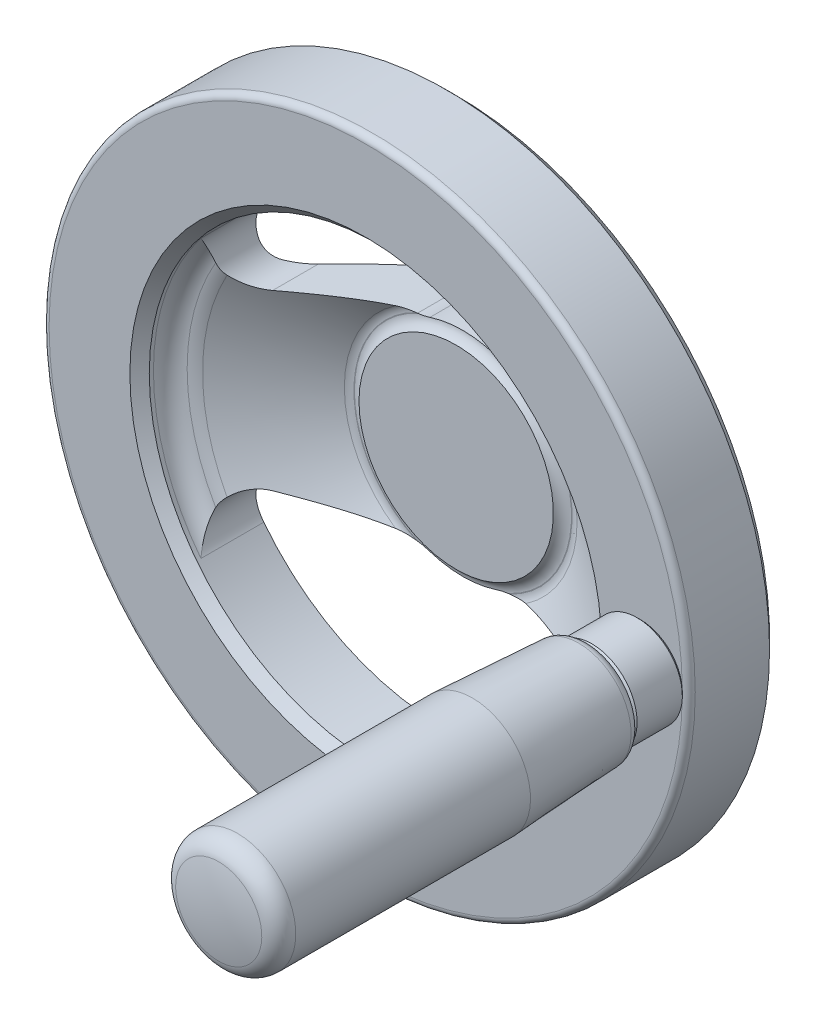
ISO-10303-21;
HEADER;
FILE_DESCRIPTION(('STEP AP214'),'2;1');
FILE_NAME('part.step','',(''),(''),'','','');
FILE_SCHEMA(('AUTOMOTIVE_DESIGN { 1 0 10303 214 1 1 1 1 }'));
ENDSEC;
DATA;
#1=APPLICATION_CONTEXT('core data for automotive mechanical design processes');
#2=APPLICATION_PROTOCOL_DEFINITION('international standard','automotive_design',2000,#1);
#3=PRODUCT_CONTEXT('',#1,'mechanical');
#4=PRODUCT('Part','Part','',(#3));
#5=PRODUCT_RELATED_PRODUCT_CATEGORY('part','',(#4));
#6=PRODUCT_DEFINITION_FORMATION('','',#4);
#7=PRODUCT_DEFINITION_CONTEXT('part definition',#1,'design');
#8=PRODUCT_DEFINITION('design','',#6,#7);
#9=PRODUCT_DEFINITION_SHAPE('','',#8);
#10=(LENGTH_UNIT() NAMED_UNIT(*) SI_UNIT(.MILLI.,.METRE.));
#11=(NAMED_UNIT(*) PLANE_ANGLE_UNIT() SI_UNIT($,.RADIAN.));
#12=(NAMED_UNIT(*) SI_UNIT($,.STERADIAN.) SOLID_ANGLE_UNIT());
#13=UNCERTAINTY_MEASURE_WITH_UNIT(LENGTH_MEASURE(1.E-05),#10,'distance_accuracy_value','');
#14=(GEOMETRIC_REPRESENTATION_CONTEXT(3) GLOBAL_UNCERTAINTY_ASSIGNED_CONTEXT((#13)) GLOBAL_UNIT_ASSIGNED_CONTEXT((#10,
#11,#12)) REPRESENTATION_CONTEXT('',''));
#15=CARTESIAN_POINT('',(0.,0.,0.));
#16=DIRECTION('',(0.,0.,1.));
#17=DIRECTION('',(1.,0.,0.));
#18=AXIS2_PLACEMENT_3D('',#15,#16,#17);
#19=CARTESIAN_POINT('',(0.,0.,22.951815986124));
#20=DIRECTION('',(0.,0.,1.));
#21=DIRECTION('',(-1.,0.,0.));
#22=AXIS2_PLACEMENT_3D('',#19,#20,#21);
#23=TOROIDAL_SURFACE('',#22,16.8823480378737,2.);
#24=CARTESIAN_POINT('',(0.,0.,21.300093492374));
#25=DIRECTION('',(0.,0.,1.));
#26=DIRECTION('',(-1.,0.,0.));
#27=AXIS2_PLACEMENT_3D('',#24,#25,#26);
#28=CIRCLE('',#27,18.0100948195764);
#29=CARTESIAN_POINT('',(-10.0809784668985,14.9243890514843,21.300093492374));
#30=VERTEX_POINT('',#29);
#31=CARTESIAN_POINT('',(-10.0809784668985,-14.9243890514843,21.300093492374));
#32=VERTEX_POINT('',#31);
#33=EDGE_CURVE('E785',#30,#32,#28,.T.);
#34=ORIENTED_EDGE('',*,*,#33,.T.);
#35=CARTESIAN_POINT('',(-10.0816086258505,-14.9243168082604,21.300293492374));
#36=CARTESIAN_POINT('',(-9.97316584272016,-14.9367489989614,21.2659123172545));
#37=CARTESIAN_POINT('',(-9.86369267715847,-14.9492993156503,21.2350288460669));
#38=CARTESIAN_POINT('',(-9.64330769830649,-14.9745648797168,21.1794098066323));
#39=CARTESIAN_POINT('',(-9.5323972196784,-14.987279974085,21.154668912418));
#40=CARTESIAN_POINT('',(-9.30991068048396,-15.0127864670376,21.1104985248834));
#41=CARTESIAN_POINT('',(-9.19833770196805,-15.025577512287,21.091052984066));
#42=CARTESIAN_POINT('',(-8.97448681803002,-15.0512404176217,21.0566900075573));
#43=CARTESIAN_POINT('',(-8.86220874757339,-15.0641122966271,21.041773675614));
#44=CARTESIAN_POINT('',(-8.52638938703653,-15.1026115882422,21.0031055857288));
#45=CARTESIAN_POINT('',(-8.30219097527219,-15.1283143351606,20.9851235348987));
#46=CARTESIAN_POINT('',(-7.85311982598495,-15.1797971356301,20.9608192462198));
#47=CARTESIAN_POINT('',(-7.62824677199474,-15.205577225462,20.9545037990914));
#48=CARTESIAN_POINT('',(-7.34144620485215,-15.2384568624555,20.9519697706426));
#49=CARTESIAN_POINT('',(-7.27952985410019,-15.2455551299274,20.9517508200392));
#50=CARTESIAN_POINT('',(-7.1556350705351,-15.2597587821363,20.9519147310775));
#51=CARTESIAN_POINT('',(-7.09365663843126,-15.2668641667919,20.9522982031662));
#52=CARTESIAN_POINT('',(-7.03167982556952,-15.273969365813,20.9529558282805));
#53=B_SPLINE_CURVE_WITH_KNOTS('',3,(#35,#36,#37,#38,#39,#40,#41,#42,#43,#44,#45,#46,#47,#48,#49,
#50,#51,#52),.UNSPECIFIED.,.F.,.F.,(4,2,2,2,2,2,2,2,4),(0.,0.343171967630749,0.686045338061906,
1.02786777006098,1.36977343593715,2.04846289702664,2.72754727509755,2.91451296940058,
3.10166824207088),.UNSPECIFIED.);
#54=CARTESIAN_POINT('',(-7.24281474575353,-15.2497642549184,20.9518159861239));
#55=VERTEX_POINT('',#54);
#56=EDGE_CURVE('E658',#32,#55,#53,.T.);
#57=ORIENTED_EDGE('',*,*,#56,.T.);
#58=CARTESIAN_POINT('',(0.,0.,20.9518159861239));
#59=DIRECTION('',(0.,0.,1.));
#60=DIRECTION('',(-1.,0.,0.));
#61=AXIS2_PLACEMENT_3D('',#58,#59,#60);
#62=CIRCLE('',#61,16.8823480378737);
#63=CARTESIAN_POINT('',(-7.24281474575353,15.2497642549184,20.9518159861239));
#64=VERTEX_POINT('',#63);
#65=EDGE_CURVE('E793',#64,#55,#62,.T.);
#66=ORIENTED_EDGE('',*,*,#65,.F.);
#67=CARTESIAN_POINT('',(-10.0816086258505,14.9243168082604,21.300293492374));
#68=CARTESIAN_POINT('',(-9.97316584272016,14.9367489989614,21.2659123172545));
#69=CARTESIAN_POINT('',(-9.86369267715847,14.9492993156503,21.2350288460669));
#70=CARTESIAN_POINT('',(-9.64330769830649,14.9745648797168,21.1794098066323));
#71=CARTESIAN_POINT('',(-9.5323972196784,14.987279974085,21.154668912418));
#72=CARTESIAN_POINT('',(-9.30991068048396,15.0127864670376,21.1104985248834));
#73=CARTESIAN_POINT('',(-9.19833770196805,15.025577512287,21.091052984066));
#74=CARTESIAN_POINT('',(-8.97448681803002,15.0512404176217,21.0566900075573));
#75=CARTESIAN_POINT('',(-8.86220874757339,15.0641122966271,21.041773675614));
#76=CARTESIAN_POINT('',(-8.52638938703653,15.1026115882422,21.0031055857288));
#77=CARTESIAN_POINT('',(-8.30219097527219,15.1283143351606,20.9851235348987));
#78=CARTESIAN_POINT('',(-7.85311982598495,15.1797971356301,20.9608192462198));
#79=CARTESIAN_POINT('',(-7.62824677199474,15.205577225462,20.9545037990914));
#80=CARTESIAN_POINT('',(-7.34144620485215,15.2384568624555,20.9519697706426));
#81=CARTESIAN_POINT('',(-7.27952985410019,15.2455551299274,20.9517508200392));
#82=CARTESIAN_POINT('',(-7.1556350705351,15.2597587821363,20.9519147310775));
#83=CARTESIAN_POINT('',(-7.09365663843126,15.2668641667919,20.9522982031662));
#84=CARTESIAN_POINT('',(-7.03167982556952,15.273969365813,20.9529558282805));
#85=B_SPLINE_CURVE_WITH_KNOTS('',3,(#67,#68,#69,#70,#71,#72,#73,#74,#75,#76,#77,#78,#79,#80,#81,
#82,#83,#84),.UNSPECIFIED.,.F.,.F.,(4,2,2,2,2,2,2,2,4),(0.,0.343171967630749,0.686045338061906,
1.02786777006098,1.36977343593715,2.04846289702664,2.72754727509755,2.91451296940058,
3.10166824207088),.UNSPECIFIED.);
#86=EDGE_CURVE('E552',#30,#64,#85,.T.);
#87=ORIENTED_EDGE('',*,*,#86,.F.);
#88=EDGE_LOOP('',(#34,#57,#66,#87));
#89=FACE_BOUND('',#88,.T.);
#90=ADVANCED_FACE('F14',(#89),#23,.F.);
#91=CARTESIAN_POINT('',(0.,0.,21.300093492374));
#92=DIRECTION('',(0.,0.,1.));
#93=DIRECTION('',(-1.,0.,0.));
#94=AXIS2_PLACEMENT_3D('',#91,#92,#93);
#95=CONICAL_SURFACE('',#94,18.0100948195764,0.971727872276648);
#96=CARTESIAN_POINT('',(-28.4636883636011,-16.8840922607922,31.599359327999));
#97=CARTESIAN_POINT('',(-28.4159643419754,-16.7336817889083,31.5189444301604));
#98=CARTESIAN_POINT('',(-28.3615375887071,-16.5868061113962,31.4361597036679));
#99=CARTESIAN_POINT('',(-28.2402863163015,-16.3009075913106,31.2665100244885));
#100=CARTESIAN_POINT('',(-28.1734722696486,-16.1618782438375,31.1796485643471));
#101=CARTESIAN_POINT('',(-27.9563997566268,-15.7584393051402,30.9144356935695));
#102=CARTESIAN_POINT('',(-27.7891139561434,-15.5064669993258,30.7308038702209));
#103=CARTESIAN_POINT('',(-27.3782850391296,-14.9926465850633,30.3155125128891));
#104=CARTESIAN_POINT('',(-27.1261343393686,-14.7394252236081,30.0817426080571));
#105=CARTESIAN_POINT('',(-26.5774386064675,-14.2932785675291,29.6073194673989));
#106=CARTESIAN_POINT('',(-26.2807884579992,-14.1004994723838,29.3666510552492));
#107=CARTESIAN_POINT('',(-25.6701751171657,-13.7894750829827,28.8988842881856));
#108=CARTESIAN_POINT('',(-25.3579822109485,-13.6677995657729,28.6717475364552));
#109=CARTESIAN_POINT('',(-24.7115299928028,-13.4884745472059,28.225382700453));
#110=CARTESIAN_POINT('',(-24.377337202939,-13.4306406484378,28.0061336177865));
#111=CARTESIAN_POINT('',(-23.7557888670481,-13.3885458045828,27.6215237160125));
#112=CARTESIAN_POINT('',(-23.4708484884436,-13.3929026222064,27.453572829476));
#113=CARTESIAN_POINT('',(-23.039804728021,-13.4374342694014,27.2141132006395));
#114=CARTESIAN_POINT('',(-22.8951800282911,-13.45870420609,27.1362058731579));
#115=CARTESIAN_POINT('',(-22.6056051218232,-13.5145848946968,26.985589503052));
#116=CARTESIAN_POINT('',(-22.4606547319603,-13.5492104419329,26.9128863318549));
#117=CARTESIAN_POINT('',(-22.316039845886,-13.5907813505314,26.843313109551));
#118=B_SPLINE_CURVE_WITH_KNOTS('',3,(#96,#97,#98,#99,#100,#101,#102,#103,#104,#105,#106,#107,
#108,#109,#110,#111,#112,#113,#114,#115,#116,#117),.UNSPECIFIED.,.F.,.F.,(4,2,2,2,2,2,2,2,2,2,
4),(0.,0.530941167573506,1.06143549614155,2.11818270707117,3.3922647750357,4.66940526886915,
5.87835026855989,7.08379419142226,8.07196280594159,8.56834299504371,9.06527465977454),.UNSPECIFIED.);
#119=CARTESIAN_POINT('',(-23.128291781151,-13.4286077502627,27.2633922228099));
#120=VERTEX_POINT('',#119);
#121=CARTESIAN_POINT('',(-27.251457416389,-14.8787779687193,30.2024437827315));
#122=VERTEX_POINT('',#121);
#123=EDGE_CURVE('E513',#120,#122,#118,.F.);
#124=ORIENTED_EDGE('',*,*,#123,.F.);
#125=CARTESIAN_POINT('',(-10.08034815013,-14.9244613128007,21.299893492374));
#126=CARTESIAN_POINT('',(-10.3661616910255,-14.8916948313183,21.3905845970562));
#127=CARTESIAN_POINT('',(-10.6509051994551,-14.859051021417,21.4846288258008));
#128=CARTESIAN_POINT('',(-11.2183018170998,-14.7940030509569,21.678823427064));
#129=CARTESIAN_POINT('',(-11.5009551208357,-14.7615988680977,21.7789732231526));
#130=CARTESIAN_POINT('',(-12.3456452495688,-14.6647611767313,22.087601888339));
#131=CARTESIAN_POINT('',(-12.9047058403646,-14.6006688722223,22.3043544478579));
#132=CARTESIAN_POINT('',(-14.0143445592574,-14.4734567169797,22.75536130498));
#133=CARTESIAN_POINT('',(-14.5649384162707,-14.4103350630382,22.9895767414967));
#134=CARTESIAN_POINT('',(-15.6597961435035,-14.2848174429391,23.4726986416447));
#135=CARTESIAN_POINT('',(-16.204059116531,-14.2224215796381,23.7216071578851));
#136=CARTESIAN_POINT('',(-17.2862362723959,-14.0983576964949,24.2311099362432));
#137=CARTESIAN_POINT('',(-17.8241580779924,-14.0366888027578,24.4916878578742));
#138=CARTESIAN_POINT('',(-18.8951199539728,-13.9139106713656,25.0227515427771));
#139=CARTESIAN_POINT('',(-19.4281601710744,-13.8528014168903,25.2932370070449));
#140=CARTESIAN_POINT('',(-20.4912098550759,-13.7309303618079,25.8430510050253));
#141=CARTESIAN_POINT('',(-21.0212099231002,-13.6701696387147,26.1223978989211));
#142=CARTESIAN_POINT('',(-22.0774929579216,-13.5490743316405,26.6880502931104));
#143=CARTESIAN_POINT('',(-22.6037761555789,-13.4887397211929,26.9743553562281));
#144=CARTESIAN_POINT('',(-23.128491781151,-13.4285848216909,27.263502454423));
#145=B_SPLINE_CURVE_WITH_KNOTS('',3,(#125,#126,#127,#128,#129,#130,#131,#132,#133,#134,#135,
#136,#137,#138,#139,#140,#141,#142,#143,#144),.UNSPECIFIED.,.F.,.F.,(4,2,2,2,2,2,2,2,2,4),(0.,
0.904874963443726,1.80966462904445,3.61831409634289,5.42305236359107,7.22804335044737,
9.03058137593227,10.8330650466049,12.6395647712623,14.4459512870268),.UNSPECIFIED.);
#146=EDGE_CURVE('E688',#32,#120,#145,.T.);
#147=ORIENTED_EDGE('',*,*,#146,.F.);
#148=ORIENTED_EDGE('',*,*,#33,.F.);
#149=CARTESIAN_POINT('',(-10.08034815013,14.9244613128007,21.299893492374));
#150=CARTESIAN_POINT('',(-10.3661616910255,14.8916948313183,21.3905845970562));
#151=CARTESIAN_POINT('',(-10.6509051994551,14.859051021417,21.4846288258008));
#152=CARTESIAN_POINT('',(-11.2183018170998,14.7940030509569,21.678823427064));
#153=CARTESIAN_POINT('',(-11.5009551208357,14.7615988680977,21.7789732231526));
#154=CARTESIAN_POINT('',(-12.3456452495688,14.6647611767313,22.087601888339));
#155=CARTESIAN_POINT('',(-12.9047058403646,14.6006688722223,22.3043544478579));
#156=CARTESIAN_POINT('',(-14.0143445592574,14.4734567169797,22.75536130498));
#157=CARTESIAN_POINT('',(-14.5649384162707,14.4103350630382,22.9895767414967));
#158=CARTESIAN_POINT('',(-15.6597961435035,14.2848174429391,23.4726986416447));
#159=CARTESIAN_POINT('',(-16.204059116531,14.2224215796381,23.7216071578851));
#160=CARTESIAN_POINT('',(-17.2862362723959,14.0983576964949,24.2311099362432));
#161=CARTESIAN_POINT('',(-17.8241580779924,14.0366888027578,24.4916878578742));
#162=CARTESIAN_POINT('',(-18.8951199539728,13.9139106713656,25.0227515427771));
#163=CARTESIAN_POINT('',(-19.4281601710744,13.8528014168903,25.2932370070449));
#164=CARTESIAN_POINT('',(-20.4912098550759,13.7309303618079,25.8430510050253));
#165=CARTESIAN_POINT('',(-21.0212099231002,13.6701696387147,26.1223978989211));
#166=CARTESIAN_POINT('',(-22.0774929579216,13.5490743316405,26.6880502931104));
#167=CARTESIAN_POINT('',(-22.6037761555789,13.4887397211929,26.9743553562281));
#168=CARTESIAN_POINT('',(-23.128491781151,13.4285848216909,27.263502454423));
#169=B_SPLINE_CURVE_WITH_KNOTS('',3,(#149,#150,#151,#152,#153,#154,#155,#156,#157,#158,#159,
#160,#161,#162,#163,#164,#165,#166,#167,#168),.UNSPECIFIED.,.F.,.F.,(4,2,2,2,2,2,2,2,2,4),(0.,
0.904874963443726,1.80966462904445,3.61831409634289,5.42305236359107,7.22804335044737,
9.03058137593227,10.8330650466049,12.6395647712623,14.4459512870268),.UNSPECIFIED.);
#170=CARTESIAN_POINT('',(-23.128291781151,13.4286077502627,27.2633922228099));
#171=VERTEX_POINT('',#170);
#172=EDGE_CURVE('E560',#30,#171,#169,.T.);
#173=ORIENTED_EDGE('',*,*,#172,.T.);
#174=CARTESIAN_POINT('',(-28.4636883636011,16.8840922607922,31.599359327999));
#175=CARTESIAN_POINT('',(-28.4159643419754,16.7336817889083,31.5189444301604));
#176=CARTESIAN_POINT('',(-28.3615375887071,16.5868061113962,31.4361597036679));
#177=CARTESIAN_POINT('',(-28.2402863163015,16.3009075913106,31.2665100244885));
#178=CARTESIAN_POINT('',(-28.1734722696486,16.1618782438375,31.1796485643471));
#179=CARTESIAN_POINT('',(-27.9563997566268,15.7584393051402,30.9144356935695));
#180=CARTESIAN_POINT('',(-27.7891139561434,15.5064669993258,30.7308038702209));
#181=CARTESIAN_POINT('',(-27.3782850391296,14.9926465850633,30.3155125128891));
#182=CARTESIAN_POINT('',(-27.1261343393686,14.7394252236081,30.0817426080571));
#183=CARTESIAN_POINT('',(-26.5774386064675,14.2932785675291,29.6073194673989));
#184=CARTESIAN_POINT('',(-26.2807884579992,14.1004994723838,29.3666510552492));
#185=CARTESIAN_POINT('',(-25.6701751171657,13.7894750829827,28.8988842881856));
#186=CARTESIAN_POINT('',(-25.3579822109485,13.6677995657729,28.6717475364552));
#187=CARTESIAN_POINT('',(-24.7115299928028,13.4884745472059,28.225382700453));
#188=CARTESIAN_POINT('',(-24.377337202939,13.4306406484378,28.0061336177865));
#189=CARTESIAN_POINT('',(-23.7557888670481,13.3885458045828,27.6215237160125));
#190=CARTESIAN_POINT('',(-23.4708484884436,13.3929026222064,27.453572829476));
#191=CARTESIAN_POINT('',(-23.039804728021,13.4374342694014,27.2141132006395));
#192=CARTESIAN_POINT('',(-22.8951800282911,13.45870420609,27.1362058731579));
#193=CARTESIAN_POINT('',(-22.6056051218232,13.5145848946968,26.985589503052));
#194=CARTESIAN_POINT('',(-22.4606547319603,13.5492104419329,26.9128863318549));
#195=CARTESIAN_POINT('',(-22.316039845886,13.5907813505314,26.843313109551));
#196=B_SPLINE_CURVE_WITH_KNOTS('',3,(#174,#175,#176,#177,#178,#179,#180,#181,#182,#183,#184,
#185,#186,#187,#188,#189,#190,#191,#192,#193,#194,#195),.UNSPECIFIED.,.F.,.F.,(4,2,2,2,2,2,2,2,
2,2,4),(0.,0.530941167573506,1.06143549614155,2.11818270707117,3.3922647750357,4.66940526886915,
5.87835026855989,7.08379419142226,8.07196280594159,8.56834299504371,9.06527465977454),.UNSPECIFIED.);
#197=CARTESIAN_POINT('',(-27.251457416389,14.8787779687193,30.2024437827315));
#198=VERTEX_POINT('',#197);
#199=EDGE_CURVE('E421',#171,#198,#196,.F.);
#200=ORIENTED_EDGE('',*,*,#199,.T.);
#201=CARTESIAN_POINT('',(0.,0.,30.2024437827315));
#202=DIRECTION('',(0.,0.,1.));
#203=DIRECTION('',(-1.,0.,0.));
#204=AXIS2_PLACEMENT_3D('',#201,#202,#203);
#205=CIRCLE('',#204,31.0486709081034);
#206=EDGE_CURVE('E795',#198,#122,#205,.T.);
#207=ORIENTED_EDGE('',*,*,#206,.T.);
#208=EDGE_LOOP('',(#124,#147,#148,#173,#200,#207));
#209=FACE_BOUND('',#208,.T.);
#210=ADVANCED_FACE('F774',(#209),#95,.F.);
#211=CARTESIAN_POINT('',(0.,0.,26.073137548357));
#212=DIRECTION('',(0.,0.,1.));
#213=DIRECTION('',(-1.,0.,0.));
#214=AXIS2_PLACEMENT_3D('',#211,#212,#213);
#215=TOROIDAL_SURFACE('',#214,33.8680378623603,5.);
#216=CARTESIAN_POINT('',(27.251457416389,-14.8787779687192,30.2024437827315));
#217=VERTEX_POINT('',#216);
#218=CARTESIAN_POINT('',(27.251457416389,14.8787779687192,30.2024437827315));
#219=VERTEX_POINT('',#218);
#220=EDGE_CURVE('E984',#217,#219,#205,.T.);
#221=ORIENTED_EDGE('',*,*,#220,.F.);
#222=CARTESIAN_POINT('',(27.6060966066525,-21.5145686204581,30.943407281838));
#223=CARTESIAN_POINT('',(27.6934197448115,-21.4051556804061,30.9429977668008));
#224=CARTESIAN_POINT('',(27.7761199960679,-21.292058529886,30.9438311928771));
#225=CARTESIAN_POINT('',(27.9317239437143,-21.0593813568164,30.9477484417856));
#226=CARTESIAN_POINT('',(28.0046294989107,-20.9398025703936,30.9508318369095));
#227=CARTESIAN_POINT('',(28.1400491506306,-20.6951458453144,30.9590088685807));
#228=CARTESIAN_POINT('',(28.2025750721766,-20.5700743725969,30.9641001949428));
#229=CARTESIAN_POINT('',(28.3169160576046,-20.315199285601,30.9758106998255));
#230=CARTESIAN_POINT('',(28.368730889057,-20.1853955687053,30.9824299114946));
#231=CARTESIAN_POINT('',(28.4616898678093,-19.920844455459,30.9966181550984));
#232=CARTESIAN_POINT('',(28.5027416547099,-19.7860649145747,31.0041946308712));
#233=CARTESIAN_POINT('',(28.573345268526,-19.5135135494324,31.0194338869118));
#234=CARTESIAN_POINT('',(28.6028922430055,-19.375740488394,31.0270967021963));
#235=CARTESIAN_POINT('',(28.6738851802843,-18.9594467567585,31.0488199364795));
#236=CARTESIAN_POINT('',(28.6977961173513,-18.6776292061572,31.0616365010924));
#237=CARTESIAN_POINT('',(28.6977583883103,-18.1510306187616,31.0741103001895));
#238=CARTESIAN_POINT('',(28.6797191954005,-17.9062789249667,31.07528328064));
#239=CARTESIAN_POINT('',(28.6260896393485,-17.5436037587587,31.0651125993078));
#240=CARTESIAN_POINT('',(28.6037827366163,-17.4234477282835,31.0597334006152));
#241=CARTESIAN_POINT('',(28.5505224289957,-17.1854084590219,31.0441314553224));
#242=CARTESIAN_POINT('',(28.5195725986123,-17.0675243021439,31.0339107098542));
#243=CARTESIAN_POINT('',(28.4491349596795,-16.834168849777,31.0076894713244));
#244=CARTESIAN_POINT('',(28.4095947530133,-16.718717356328,30.991653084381));
#245=CARTESIAN_POINT('',(28.3226094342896,-16.4919545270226,30.952984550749));
#246=CARTESIAN_POINT('',(28.2751641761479,-16.3806432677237,30.9303522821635));
#247=CARTESIAN_POINT('',(28.1731059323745,-16.1631698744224,30.8777668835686));
#248=CARTESIAN_POINT('',(28.1184942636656,-16.0570067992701,30.8478150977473));
#249=CARTESIAN_POINT('',(28.003051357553,-15.8507683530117,30.7800087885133));
#250=CARTESIAN_POINT('',(27.9422210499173,-15.7506920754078,30.7421554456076));
#251=CARTESIAN_POINT('',(27.8209951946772,-15.5658404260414,30.6618033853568));
#252=CARTESIAN_POINT('',(27.7610186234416,-15.480490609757,30.6199913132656));
#253=CARTESIAN_POINT('',(27.6378490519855,-15.3160743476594,30.5293239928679));
#254=CARTESIAN_POINT('',(27.5746559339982,-15.2370081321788,30.4804684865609));
#255=CARTESIAN_POINT('',(27.4458800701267,-15.0852323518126,30.3755258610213));
#256=CARTESIAN_POINT('',(27.3802885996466,-15.0125501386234,30.3194099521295));
#257=CARTESIAN_POINT('',(27.248083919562,-14.8740640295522,30.2003132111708));
#258=CARTESIAN_POINT('',(27.1814707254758,-14.8082600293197,30.1373324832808));
#259=CARTESIAN_POINT('',(27.114906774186,-14.7459724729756,30.0710234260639));
#260=B_SPLINE_CURVE_WITH_KNOTS('',3,(#222,#223,#224,#225,#226,#227,#228,#229,#230,#231,#232,
#233,#234,#235,#236,#237,#238,#239,#240,#241,#242,#243,#244,#245,#246,#247,#248,#249,#250,#251,
#252,#253,#254,#255,#256,#257,#258,#259),.UNSPECIFIED.,.F.,.F.,(4,2,2,2,2,2,2,2,2,2,2,2,2,2,2,2,
2,2,4),(0.,0.419824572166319,0.839569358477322,1.25883261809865,1.67810497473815,
2.10086544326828,2.52380402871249,3.3686673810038,4.10183326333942,4.46845581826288,
4.83492697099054,5.20369957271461,5.57247899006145,5.94119073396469,6.30984743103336,
6.64656291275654,6.98329073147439,7.32139722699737,7.65949859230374),.UNSPECIFIED.);
#261=CARTESIAN_POINT('',(28.285761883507,-16.4085131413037,30.9349158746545));
#262=VERTEX_POINT('',#261);
#263=EDGE_CURVE('E373',#217,#262,#260,.F.);
#264=ORIENTED_EDGE('',*,*,#263,.T.);
#265=CARTESIAN_POINT('',(0.,0.,30.9349158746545));
#266=DIRECTION('',(0.,0.,1.));
#267=DIRECTION('',(-1.,0.,0.));
#268=AXIS2_PLACEMENT_3D('',#265,#266,#267);
#269=CIRCLE('',#268,32.7005141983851);
#270=CARTESIAN_POINT('',(28.285761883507,16.4085131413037,30.9349158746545));
#271=VERTEX_POINT('',#270);
#272=EDGE_CURVE('E981',#262,#271,#269,.T.);
#273=ORIENTED_EDGE('',*,*,#272,.T.);
#274=CARTESIAN_POINT('',(27.251242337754,14.8785606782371,30.202243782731));
#275=CARTESIAN_POINT('',(27.3161176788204,14.9440683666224,30.2625962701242));
#276=CARTESIAN_POINT('',(27.3806732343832,15.0129385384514,30.3196596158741));
#277=CARTESIAN_POINT('',(27.508119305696,15.157168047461,30.4271138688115));
#278=CARTESIAN_POINT('',(27.571009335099,15.2325292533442,30.4775028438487));
#279=CARTESIAN_POINT('',(27.6927309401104,15.3877715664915,30.5704640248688));
#280=CARTESIAN_POINT('',(27.7516208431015,15.4675198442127,30.6131815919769));
#281=CARTESIAN_POINT('',(27.8658412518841,15.6325048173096,30.692158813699));
#282=CARTESIAN_POINT('',(27.9211733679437,15.717738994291,30.728421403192));
#283=CARTESIAN_POINT('',(28.0316987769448,15.9002035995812,30.7973415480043));
#284=CARTESIAN_POINT('',(28.0865300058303,15.9978487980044,30.8294819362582));
#285=CARTESIAN_POINT('',(28.1908470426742,16.1993838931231,30.8872659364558));
#286=CARTESIAN_POINT('',(28.240261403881,16.3033343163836,30.9128276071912));
#287=CARTESIAN_POINT('',(28.2861735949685,16.4094637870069,30.9351158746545));
#288=B_SPLINE_CURVE_WITH_KNOTS('',3,(#274,#275,#276,#277,#278,#279,#280,#281,#282,#283,#284,
#285,#286,#287),.UNSPECIFIED.,.F.,.F.,(4,2,2,2,2,2,4),(0.,0.330495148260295,0.66108576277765,
0.984533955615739,1.30783470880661,1.65688539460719,2.01009354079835),.UNSPECIFIED.);
#289=EDGE_CURVE('E401',#219,#271,#288,.T.);
#290=ORIENTED_EDGE('',*,*,#289,.F.);
#291=EDGE_LOOP('',(#221,#264,#273,#290));
#292=FACE_BOUND('',#291,.T.);
#293=ADVANCED_FACE('F393',(#292),#215,.T.);
#294=CARTESIAN_POINT('',(0.,0.,33.851982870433));
#295=DIRECTION('',(0.,0.,1.));
#296=DIRECTION('',(-1.,0.,0.));
#297=AXIS2_PLACEMENT_3D('',#294,#295,#296);
#298=TOROIDAL_SURFACE('',#297,32.,2.99999999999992);
#299=CARTESIAN_POINT('',(27.647405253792,-21.4620824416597,33.851982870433));
#300=CARTESIAN_POINT('',(27.6499424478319,-21.4588140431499,33.8490156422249));
#301=CARTESIAN_POINT('',(27.652475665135,-21.4555423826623,33.846048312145));
#302=CARTESIAN_POINT('',(27.8630222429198,-21.1829214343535,33.5990246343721));
#303=CARTESIAN_POINT('',(28.0440932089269,-20.8915630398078,33.3543447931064));
#304=CARTESIAN_POINT('',(28.2698574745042,-20.4273084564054,32.9939415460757));
#305=CARTESIAN_POINT('',(28.337569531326,-20.2676409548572,32.8746559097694));
#306=CARTESIAN_POINT('',(28.4566694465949,-19.9398598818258,32.6395119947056));
#307=CARTESIAN_POINT('',(28.5080644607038,-19.7717500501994,32.5236522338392));
#308=CARTESIAN_POINT('',(28.5831813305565,-19.4689218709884,32.3239055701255));
#309=CARTESIAN_POINT('',(28.6105791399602,-19.3357928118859,32.2389788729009));
#310=CARTESIAN_POINT('',(28.6546481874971,-19.0655428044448,32.072775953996));
#311=CARTESIAN_POINT('',(28.6713162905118,-18.9284207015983,31.9915008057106));
#312=CARTESIAN_POINT('',(28.7040704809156,-18.5131376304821,31.7553028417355));
#313=CARTESIAN_POINT('',(28.7033313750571,-18.2294024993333,31.6068997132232));
#314=CARTESIAN_POINT('',(28.6656051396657,-17.8158171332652,31.413883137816));
#315=CARTESIAN_POINT('',(28.6492288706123,-17.6891264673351,31.3578223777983));
#316=CARTESIAN_POINT('',(28.6061961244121,-17.4348116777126,31.2522260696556));
#317=CARTESIAN_POINT('',(28.5795468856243,-17.3071882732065,31.2026859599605));
#318=CARTESIAN_POINT('',(28.5151098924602,-17.0503348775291,31.1109046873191));
#319=CARTESIAN_POINT('',(28.4771982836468,-16.9211031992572,31.0687534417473));
#320=CARTESIAN_POINT('',(28.3899416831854,-16.6633880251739,30.9940518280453));
#321=CARTESIAN_POINT('',(28.3405696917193,-16.5349070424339,30.9615245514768));
#322=CARTESIAN_POINT('',(28.2853499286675,-16.4075624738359,30.9347158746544));
#323=B_SPLINE_CURVE_WITH_KNOTS('',3,(#299,#300,#301,#302,#303,#304,#305,#306,#307,#308,#309,
#310,#311,#312,#313,#314,#315,#316,#317,#318,#319,#320,#321,#322),.UNSPECIFIED.,.F.,.F.,(4,2,2,
2,2,2,2,2,2,2,2,4),(0.,0.0152752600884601,1.27159217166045,1.90252072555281,2.53317220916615,
3.01353884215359,3.49404577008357,4.44900234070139,4.86711804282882,5.28493967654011,
5.70753791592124,6.13114205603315),.UNSPECIFIED.);
#324=CARTESIAN_POINT('',(27.647405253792,-21.4620824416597,33.851982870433));
#325=VERTEX_POINT('',#324);
#326=EDGE_CURVE('E366',#325,#262,#323,.T.);
#327=ORIENTED_EDGE('',*,*,#326,.F.);
#328=CARTESIAN_POINT('',(0.,0.,33.851982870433));
#329=DIRECTION('',(0.,0.,1.));
#330=DIRECTION('',(-1.,0.,0.));
#331=AXIS2_PLACEMENT_3D('',#328,#329,#330);
#332=CIRCLE('',#331,35.);
#333=CARTESIAN_POINT('',(27.647405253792,21.4620824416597,33.851982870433));
#334=VERTEX_POINT('',#333);
#335=EDGE_CURVE('E978',#325,#334,#332,.T.);
#336=ORIENTED_EDGE('',*,*,#335,.T.);
#337=CARTESIAN_POINT('',(27.647405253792,21.4620824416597,33.851982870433));
#338=CARTESIAN_POINT('',(27.6499424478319,21.4588140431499,33.8490156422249));
#339=CARTESIAN_POINT('',(27.652475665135,21.4555423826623,33.846048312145));
#340=CARTESIAN_POINT('',(27.8630222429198,21.1829214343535,33.5990246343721));
#341=CARTESIAN_POINT('',(28.0440932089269,20.8915630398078,33.3543447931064));
#342=CARTESIAN_POINT('',(28.2698574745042,20.4273084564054,32.9939415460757));
#343=CARTESIAN_POINT('',(28.337569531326,20.2676409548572,32.8746559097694));
#344=CARTESIAN_POINT('',(28.4566694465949,19.9398598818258,32.6395119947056));
#345=CARTESIAN_POINT('',(28.5080644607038,19.7717500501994,32.5236522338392));
#346=CARTESIAN_POINT('',(28.5831813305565,19.4689218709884,32.3239055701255));
#347=CARTESIAN_POINT('',(28.6105791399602,19.3357928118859,32.2389788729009));
#348=CARTESIAN_POINT('',(28.6546481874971,19.0655428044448,32.072775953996));
#349=CARTESIAN_POINT('',(28.6713162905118,18.9284207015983,31.9915008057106));
#350=CARTESIAN_POINT('',(28.7040704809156,18.5131376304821,31.7553028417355));
#351=CARTESIAN_POINT('',(28.7033313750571,18.2294024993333,31.6068997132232));
#352=CARTESIAN_POINT('',(28.6656051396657,17.8158171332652,31.413883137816));
#353=CARTESIAN_POINT('',(28.6492288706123,17.6891264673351,31.3578223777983));
#354=CARTESIAN_POINT('',(28.6061961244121,17.4348116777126,31.2522260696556));
#355=CARTESIAN_POINT('',(28.5795468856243,17.3071882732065,31.2026859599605));
#356=CARTESIAN_POINT('',(28.5151098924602,17.0503348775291,31.1109046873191));
#357=CARTESIAN_POINT('',(28.4771982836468,16.9211031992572,31.0687534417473));
#358=CARTESIAN_POINT('',(28.3899416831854,16.6633880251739,30.9940518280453));
#359=CARTESIAN_POINT('',(28.3405696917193,16.5349070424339,30.9615245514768));
#360=CARTESIAN_POINT('',(28.2853499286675,16.4075624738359,30.9347158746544));
#361=B_SPLINE_CURVE_WITH_KNOTS('',3,(#337,#338,#339,#340,#341,#342,#343,#344,#345,#346,#347,
#348,#349,#350,#351,#352,#353,#354,#355,#356,#357,#358,#359,#360),.UNSPECIFIED.,.F.,.F.,(4,2,2,
2,2,2,2,2,2,2,2,4),(0.,0.0152752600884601,1.27159217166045,1.90252072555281,2.53317220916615,
3.01353884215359,3.49404577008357,4.44900234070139,4.86711804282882,5.28493967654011,
5.70753791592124,6.13114205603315),.UNSPECIFIED.);
#362=EDGE_CURVE('E998',#334,#271,#361,.T.);
#363=ORIENTED_EDGE('',*,*,#362,.T.);
#364=ORIENTED_EDGE('',*,*,#272,.F.);
#365=EDGE_LOOP('',(#327,#336,#363,#364));
#366=FACE_BOUND('',#365,.T.);
#367=ADVANCED_FACE('F1000',(#366),#298,.F.);
#368=CARTESIAN_POINT('',(-33.6602540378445,0.,24.3094010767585));
#369=DIRECTION('',(0.,0.,-1.));
#370=DIRECTION('',(1.,0.,0.));
#371=AXIS2_PLACEMENT_3D('',#368,#369,#370);
#372=PLANE('',#371);
#373=CARTESIAN_POINT('',(0.,0.,24.3094010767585));
#374=DIRECTION('',(0.,0.,1.));
#375=DIRECTION('',(-1.,0.,0.));
#376=AXIS2_PLACEMENT_3D('',#373,#374,#375);
#377=CIRCLE('',#376,33.6602540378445);
#378=CARTESIAN_POINT('',(28.6456481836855,-17.6759594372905,24.3094010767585));
#379=VERTEX_POINT('',#378);
#380=CARTESIAN_POINT('',(28.6456481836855,17.6759594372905,24.3094010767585));
#381=VERTEX_POINT('',#380);
#382=EDGE_CURVE('E953',#379,#381,#377,.T.);
#383=ORIENTED_EDGE('',*,*,#382,.F.);
#384=CARTESIAN_POINT('',(23.6977759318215,-18.3960706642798,24.3094010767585));
#385=DIRECTION('',(0.,0.,-1.));
#386=DIRECTION('',(1.,0.,0.));
#387=AXIS2_PLACEMENT_3D('',#384,#385,#386);
#388=CIRCLE('',#387,5.);
#389=CARTESIAN_POINT('',(28.3960711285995,-16.6855086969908,24.3094010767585));
#390=VERTEX_POINT('',#389);
#391=EDGE_CURVE('E1054',#379,#390,#388,.F.);
#392=ORIENTED_EDGE('',*,*,#391,.T.);
#393=CARTESIAN_POINT('',(0.,0.,24.3094010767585));
#394=DIRECTION('',(0.,0.,1.));
#395=DIRECTION('',(-1.,0.,0.));
#396=AXIS2_PLACEMENT_3D('',#393,#394,#395);
#397=CIRCLE('',#396,32.935437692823);
#398=CARTESIAN_POINT('',(28.3960711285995,16.6855086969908,24.3094010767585));
#399=VERTEX_POINT('',#398);
#400=EDGE_CURVE('E949',#390,#399,#397,.T.);
#401=ORIENTED_EDGE('',*,*,#400,.T.);
#402=CARTESIAN_POINT('',(23.6977759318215,18.3960706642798,24.3094010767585));
#403=DIRECTION('',(0.,0.,-1.));
#404=DIRECTION('',(1.,0.,0.));
#405=AXIS2_PLACEMENT_3D('',#402,#403,#404);
#406=CIRCLE('',#405,5.);
#407=EDGE_CURVE('E1002',#381,#399,#406,.T.);
#408=ORIENTED_EDGE('',*,*,#407,.F.);
#409=EDGE_LOOP('',(#383,#392,#401,#408));
#410=FACE_BOUND('',#409,.T.);
#411=ADVANCED_FACE('F1063',(#410),#372,.T.);
#412=CARTESIAN_POINT('',(0.,0.,19.3094010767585));
#413=DIRECTION('',(0.,0.,1.));
#414=DIRECTION('',(-1.,0.,0.));
#415=AXIS2_PLACEMENT_3D('',#412,#413,#414);
#416=TOROIDAL_SURFACE('',#415,32.9354376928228,5.);
#417=CARTESIAN_POINT('',(25.9074497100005,-13.9108346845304,22.850926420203));
#418=CARTESIAN_POINT('',(25.9784188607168,-13.945791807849,22.9297439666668));
#419=CARTESIAN_POINT('',(26.0509292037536,-13.9836136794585,23.0059427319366));
#420=CARTESIAN_POINT('',(26.1982470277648,-14.065397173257,23.1527173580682));
#421=CARTESIAN_POINT('',(26.2730559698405,-14.1093627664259,23.2232895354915));
#422=CARTESIAN_POINT('',(26.4242486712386,-14.2038978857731,23.358462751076));
#423=CARTESIAN_POINT('',(26.5006353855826,-14.2544809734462,23.4230510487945));
#424=CARTESIAN_POINT('',(26.6538575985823,-14.3624174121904,23.5456756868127));
#425=CARTESIAN_POINT('',(26.7306929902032,-14.4197692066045,23.6037135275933));
#426=CARTESIAN_POINT('',(26.8841654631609,-14.5416489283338,23.7131791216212));
#427=CARTESIAN_POINT('',(26.9607998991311,-14.6062094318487,23.764574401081));
#428=CARTESIAN_POINT('',(27.112410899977,-14.742218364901,23.8601970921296));
#429=CARTESIAN_POINT('',(27.1873875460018,-14.8136664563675,23.9044248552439));
#430=CARTESIAN_POINT('',(27.3344484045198,-14.9630579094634,23.9855391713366));
#431=CARTESIAN_POINT('',(27.4065381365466,-15.0409879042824,24.022440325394));
#432=CARTESIAN_POINT('',(27.5469483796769,-15.2030526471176,24.0890744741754));
#433=CARTESIAN_POINT('',(27.6152691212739,-15.2871870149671,24.1188079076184));
#434=CARTESIAN_POINT('',(27.7432072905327,-15.4558323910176,24.1697417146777));
#435=CARTESIAN_POINT('',(27.8031012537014,-15.5400112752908,24.1913501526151));
#436=CARTESIAN_POINT('',(27.918097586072,-15.7128519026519,24.2287593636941));
#437=CARTESIAN_POINT('',(27.9731983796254,-15.8015151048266,24.2445582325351));
#438=CARTESIAN_POINT('',(28.0780674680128,-15.9827708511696,24.2707506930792));
#439=CARTESIAN_POINT('',(28.1278326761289,-16.0753656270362,24.2811411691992));
#440=CARTESIAN_POINT('',(28.2215849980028,-16.2638792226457,24.2969874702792));
#441=CARTESIAN_POINT('',(28.2655698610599,-16.3597993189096,24.3024413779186));
#442=CARTESIAN_POINT('',(28.3491073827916,-16.5583588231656,24.3090724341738));
#443=CARTESIAN_POINT('',(28.3884034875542,-16.6611123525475,24.3100645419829));
#444=CARTESIAN_POINT('',(28.4601319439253,-16.8689588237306,24.3079017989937));
#445=CARTESIAN_POINT('',(28.4925618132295,-16.9740525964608,24.3047454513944));
#446=CARTESIAN_POINT('',(28.5792677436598,-17.2919022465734,24.2900189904));
#447=CARTESIAN_POINT('',(28.6230226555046,-17.5073754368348,24.2731945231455));
#448=CARTESIAN_POINT('',(28.6861761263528,-17.9730264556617,24.2275186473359));
#449=CARTESIAN_POINT('',(28.7010631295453,-18.2236607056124,24.1972655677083));
#450=CARTESIAN_POINT('',(28.6932782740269,-18.7240688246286,24.1322764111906));
#451=CARTESIAN_POINT('',(28.6705675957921,-18.973841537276,24.0975357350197));
#452=CARTESIAN_POINT('',(28.6062109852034,-19.3588699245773,24.0450749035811));
#453=CARTESIAN_POINT('',(28.5772549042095,-19.4962609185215,24.0265781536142));
#454=CARTESIAN_POINT('',(28.5078294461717,-19.7683205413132,23.9913519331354));
#455=CARTESIAN_POINT('',(28.4673639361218,-19.9029900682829,23.9746218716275));
#456=CARTESIAN_POINT('',(28.3751709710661,-20.1685584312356,23.9439211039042));
#457=CARTESIAN_POINT('',(28.3234569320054,-20.2994615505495,23.9299471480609));
#458=CARTESIAN_POINT('',(28.2090542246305,-20.5566648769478,23.9055595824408));
#459=CARTESIAN_POINT('',(28.1463707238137,-20.6829672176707,23.8951443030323));
#460=CARTESIAN_POINT('',(28.0153159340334,-20.9211368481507,23.8791057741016));
#461=CARTESIAN_POINT('',(27.9476786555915,-21.0333888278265,23.8731915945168));
#462=CARTESIAN_POINT('',(27.8038056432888,-21.2522389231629,23.8652481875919));
#463=CARTESIAN_POINT('',(27.7275776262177,-21.3588419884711,23.8632155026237));
#464=CARTESIAN_POINT('',(27.647249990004,-21.4622824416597,23.8632546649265));
#465=B_SPLINE_CURVE_WITH_KNOTS('',3,(#417,#418,#419,#420,#421,#422,#423,#424,#425,#426,#427,
#428,#429,#430,#431,#432,#433,#434,#435,#436,#437,#438,#439,#440,#441,#442,#443,#444,#445,#446,
#447,#448,#449,#450,#451,#452,#453,#454,#455,#456,#457,#458,#459,#460,#461,#462,#463,#464),
.UNSPECIFIED.,.F.,.F.,(4,2,2,2,2,2,2,2,2,2,2,2,2,2,2,2,2,2,2,2,2,2,2,4),(0.,0.334983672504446,
0.670184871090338,1.00608409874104,1.3419062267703,1.6793125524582,2.01670232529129,
2.35341281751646,2.69010269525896,3.00637873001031,3.32275834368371,3.63932001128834,
3.95600457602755,4.28570844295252,4.61553130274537,5.27469703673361,6.03050627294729,
6.78709636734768,7.21153464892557,7.63583049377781,8.05962303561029,8.48321647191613,
8.87632446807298,9.26908212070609),.UNSPECIFIED.);
#466=CARTESIAN_POINT('',(25.907629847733,-13.9109234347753,22.851126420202));
#467=VERTEX_POINT('',#466);
#468=EDGE_CURVE('E329',#467,#390,#465,.T.);
#469=ORIENTED_EDGE('',*,*,#468,.F.);
#470=CARTESIAN_POINT('',(0.,0.,22.851126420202));
#471=DIRECTION('',(0.,0.,1.));
#472=DIRECTION('',(-1.,0.,0.));
#473=AXIS2_PLACEMENT_3D('',#470,#471,#472);
#474=CIRCLE('',#473,29.406106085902);
#475=CARTESIAN_POINT('',(25.907629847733,13.9109234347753,22.851126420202));
#476=VERTEX_POINT('',#475);
#477=EDGE_CURVE('E945',#467,#476,#474,.T.);
#478=ORIENTED_EDGE('',*,*,#477,.T.);
#479=CARTESIAN_POINT('',(25.9074497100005,13.9108346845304,22.850926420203));
#480=CARTESIAN_POINT('',(25.9784188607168,13.945791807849,22.9297439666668));
#481=CARTESIAN_POINT('',(26.0509292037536,13.9836136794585,23.0059427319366));
#482=CARTESIAN_POINT('',(26.1982470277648,14.065397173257,23.1527173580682));
#483=CARTESIAN_POINT('',(26.2730559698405,14.1093627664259,23.2232895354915));
#484=CARTESIAN_POINT('',(26.4242486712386,14.2038978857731,23.358462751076));
#485=CARTESIAN_POINT('',(26.5006353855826,14.2544809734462,23.4230510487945));
#486=CARTESIAN_POINT('',(26.6538575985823,14.3624174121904,23.5456756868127));
#487=CARTESIAN_POINT('',(26.7306929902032,14.4197692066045,23.6037135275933));
#488=CARTESIAN_POINT('',(26.8841654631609,14.5416489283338,23.7131791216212));
#489=CARTESIAN_POINT('',(26.9607998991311,14.6062094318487,23.764574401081));
#490=CARTESIAN_POINT('',(27.112410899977,14.742218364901,23.8601970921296));
#491=CARTESIAN_POINT('',(27.1873875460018,14.8136664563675,23.9044248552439));
#492=CARTESIAN_POINT('',(27.3344484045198,14.9630579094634,23.9855391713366));
#493=CARTESIAN_POINT('',(27.4065381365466,15.0409879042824,24.022440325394));
#494=CARTESIAN_POINT('',(27.5469483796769,15.2030526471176,24.0890744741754));
#495=CARTESIAN_POINT('',(27.6152691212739,15.2871870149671,24.1188079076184));
#496=CARTESIAN_POINT('',(27.7432072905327,15.4558323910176,24.1697417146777));
#497=CARTESIAN_POINT('',(27.8031012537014,15.5400112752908,24.1913501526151));
#498=CARTESIAN_POINT('',(27.918097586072,15.7128519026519,24.2287593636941));
#499=CARTESIAN_POINT('',(27.9731983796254,15.8015151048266,24.2445582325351));
#500=CARTESIAN_POINT('',(28.0780674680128,15.9827708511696,24.2707506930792));
#501=CARTESIAN_POINT('',(28.1278326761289,16.0753656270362,24.2811411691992));
#502=CARTESIAN_POINT('',(28.2215849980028,16.2638792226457,24.2969874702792));
#503=CARTESIAN_POINT('',(28.2655698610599,16.3597993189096,24.3024413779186));
#504=CARTESIAN_POINT('',(28.3491073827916,16.5583588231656,24.3090724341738));
#505=CARTESIAN_POINT('',(28.3884034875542,16.6611123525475,24.3100645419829));
#506=CARTESIAN_POINT('',(28.4601319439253,16.8689588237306,24.3079017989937));
#507=CARTESIAN_POINT('',(28.4925618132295,16.9740525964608,24.3047454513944));
#508=CARTESIAN_POINT('',(28.5792677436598,17.2919022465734,24.2900189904));
#509=CARTESIAN_POINT('',(28.6230226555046,17.5073754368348,24.2731945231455));
#510=CARTESIAN_POINT('',(28.6861761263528,17.9730264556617,24.2275186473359));
#511=CARTESIAN_POINT('',(28.7010631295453,18.2236607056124,24.1972655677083));
#512=CARTESIAN_POINT('',(28.6932782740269,18.7240688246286,24.1322764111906));
#513=CARTESIAN_POINT('',(28.6705675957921,18.973841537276,24.0975357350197));
#514=CARTESIAN_POINT('',(28.6062109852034,19.3588699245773,24.0450749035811));
#515=CARTESIAN_POINT('',(28.5772549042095,19.4962609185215,24.0265781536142));
#516=CARTESIAN_POINT('',(28.5078294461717,19.7683205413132,23.9913519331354));
#517=CARTESIAN_POINT('',(28.4673639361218,19.9029900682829,23.9746218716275));
#518=CARTESIAN_POINT('',(28.3751709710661,20.1685584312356,23.9439211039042));
#519=CARTESIAN_POINT('',(28.3234569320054,20.2994615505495,23.9299471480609));
#520=CARTESIAN_POINT('',(28.2090542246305,20.5566648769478,23.9055595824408));
#521=CARTESIAN_POINT('',(28.1463707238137,20.6829672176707,23.8951443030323));
#522=CARTESIAN_POINT('',(28.0153159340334,20.9211368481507,23.8791057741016));
#523=CARTESIAN_POINT('',(27.9476786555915,21.0333888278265,23.8731915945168));
#524=CARTESIAN_POINT('',(27.8038056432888,21.2522389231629,23.8652481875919));
#525=CARTESIAN_POINT('',(27.7275776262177,21.3588419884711,23.8632155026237));
#526=CARTESIAN_POINT('',(27.647249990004,21.4622824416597,23.8632546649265));
#527=B_SPLINE_CURVE_WITH_KNOTS('',3,(#479,#480,#481,#482,#483,#484,#485,#486,#487,#488,#489,
#490,#491,#492,#493,#494,#495,#496,#497,#498,#499,#500,#501,#502,#503,#504,#505,#506,#507,#508,
#509,#510,#511,#512,#513,#514,#515,#516,#517,#518,#519,#520,#521,#522,#523,#524,#525,#526),
.UNSPECIFIED.,.F.,.F.,(4,2,2,2,2,2,2,2,2,2,2,2,2,2,2,2,2,2,2,2,2,2,2,4),(0.,0.334983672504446,
0.670184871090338,1.00608409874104,1.3419062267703,1.6793125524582,2.01670232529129,
2.35341281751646,2.69010269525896,3.00637873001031,3.32275834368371,3.63932001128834,
3.95600457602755,4.28570844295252,4.61553130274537,5.27469703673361,6.03050627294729,
6.78709636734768,7.21153464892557,7.63583049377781,8.05962303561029,8.48321647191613,
8.87632446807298,9.26908212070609),.UNSPECIFIED.);
#528=EDGE_CURVE('E1009',#476,#399,#527,.T.);
#529=ORIENTED_EDGE('',*,*,#528,.T.);
#530=ORIENTED_EDGE('',*,*,#400,.F.);
#531=EDGE_LOOP('',(#469,#478,#529,#530));
#532=FACE_BOUND('',#531,.T.);
#533=ADVANCED_FACE('F1027',(#532),#416,.F.);
#534=CARTESIAN_POINT('',(0.,0.,22.851126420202));
#535=DIRECTION('',(0.,0.,1.));
#536=DIRECTION('',(-1.,0.,0.));
#537=AXIS2_PLACEMENT_3D('',#534,#535,#536);
#538=CONICAL_SURFACE('',#537,29.406106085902,0.787150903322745);
#539=CARTESIAN_POINT('',(-25.9078099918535,-13.9110121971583,22.851326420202));
#540=CARTESIAN_POINT('',(-25.8220730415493,-13.8687693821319,22.7561416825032));
#541=CARTESIAN_POINT('',(-25.735096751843,-13.8289620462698,22.6610148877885));
#542=CARTESIAN_POINT('',(-25.5587530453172,-13.7543100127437,22.4710138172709));
#543=CARTESIAN_POINT('',(-25.469385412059,-13.7194657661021,22.3761395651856));
#544=CARTESIAN_POINT('',(-25.1975043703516,-13.6224024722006,22.0917644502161));
#545=CARTESIAN_POINT('',(-25.0115414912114,-13.5678152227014,21.9028764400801));
#546=CARTESIAN_POINT('',(-24.6352901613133,-13.4810333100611,21.5322646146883));
#547=CARTESIAN_POINT('',(-24.4451678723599,-13.4484036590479,21.3504732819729));
#548=CARTESIAN_POINT('',(-24.0579545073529,-13.4052625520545,20.9920749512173));
#549=CARTESIAN_POINT('',(-23.8608726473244,-13.3947228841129,20.8154616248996));
#550=CARTESIAN_POINT('',(-23.5732754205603,-13.3968568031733,20.5671186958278));
#551=CARTESIAN_POINT('',(-23.485251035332,-13.3998002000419,20.4923360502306));
#552=CARTESIAN_POINT('',(-23.3076946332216,-13.4105143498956,20.3441224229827));
#553=CARTESIAN_POINT('',(-23.2181576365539,-13.4183066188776,20.270698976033));
#554=CARTESIAN_POINT('',(-23.128091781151,-13.4286306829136,20.1982468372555));
#555=B_SPLINE_CURVE_WITH_KNOTS('',3,(#539,#540,#541,#542,#543,#544,#545,#546,#547,#548,#549,
#550,#551,#552,#553,#554),.UNSPECIFIED.,.F.,.F.,(4,2,2,2,2,2,2,4),(0.,0.404610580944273,
0.809257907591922,1.62010026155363,2.41436539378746,3.2076155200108,3.55413466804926,
3.90220250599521),.UNSPECIFIED.);
#556=CARTESIAN_POINT('',(-25.907629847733,-13.9109234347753,22.851126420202));
#557=VERTEX_POINT('',#556);
#558=CARTESIAN_POINT('',(-23.128291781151,-13.4286077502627,20.1984077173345));
#559=VERTEX_POINT('',#558);
#560=EDGE_CURVE('E1037',#557,#559,#555,.T.);
#561=ORIENTED_EDGE('',*,*,#560,.F.);
#562=CARTESIAN_POINT('',(-25.907629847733,13.9109234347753,22.851126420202));
#563=VERTEX_POINT('',#562);
#564=EDGE_CURVE('E946',#563,#557,#474,.T.);
#565=ORIENTED_EDGE('',*,*,#564,.F.);
#566=CARTESIAN_POINT('',(-25.9078099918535,13.9110121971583,22.851326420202));
#567=CARTESIAN_POINT('',(-25.8220730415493,13.8687693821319,22.7561416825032));
#568=CARTESIAN_POINT('',(-25.735096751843,13.8289620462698,22.6610148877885));
#569=CARTESIAN_POINT('',(-25.5587530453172,13.7543100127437,22.4710138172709));
#570=CARTESIAN_POINT('',(-25.469385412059,13.7194657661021,22.3761395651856));
#571=CARTESIAN_POINT('',(-25.1975043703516,13.6224024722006,22.0917644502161));
#572=CARTESIAN_POINT('',(-25.0115414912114,13.5678152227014,21.9028764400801));
#573=CARTESIAN_POINT('',(-24.6352901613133,13.4810333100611,21.5322646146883));
#574=CARTESIAN_POINT('',(-24.4451678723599,13.4484036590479,21.3504732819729));
#575=CARTESIAN_POINT('',(-24.0579545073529,13.4052625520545,20.9920749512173));
#576=CARTESIAN_POINT('',(-23.8608726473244,13.3947228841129,20.8154616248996));
#577=CARTESIAN_POINT('',(-23.5732754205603,13.3968568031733,20.5671186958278));
#578=CARTESIAN_POINT('',(-23.485251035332,13.3998002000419,20.4923360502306));
#579=CARTESIAN_POINT('',(-23.3076946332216,13.4105143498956,20.3441224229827));
#580=CARTESIAN_POINT('',(-23.2181576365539,13.4183066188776,20.270698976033));
#581=CARTESIAN_POINT('',(-23.128091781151,13.4286306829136,20.1982468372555));
#582=B_SPLINE_CURVE_WITH_KNOTS('',3,(#566,#567,#568,#569,#570,#571,#572,#573,#574,#575,#576,
#577,#578,#579,#580,#581),.UNSPECIFIED.,.F.,.F.,(4,2,2,2,2,2,2,4),(0.,0.404610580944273,
0.809257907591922,1.62010026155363,2.41436539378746,3.2076155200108,3.55413466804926,
3.90220250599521),.UNSPECIFIED.);
#583=CARTESIAN_POINT('',(-23.128291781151,13.4286077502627,20.1984077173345));
#584=VERTEX_POINT('',#583);
#585=EDGE_CURVE('E448',#563,#584,#582,.T.);
#586=ORIENTED_EDGE('',*,*,#585,.T.);
#587=CARTESIAN_POINT('',(-23.128491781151,13.4285848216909,20.1985685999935));
#588=CARTESIAN_POINT('',(-22.886833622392,13.4562892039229,20.0041778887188));
#589=CARTESIAN_POINT('',(-22.6446067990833,13.4840587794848,19.8105039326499));
#590=CARTESIAN_POINT('',(-22.1589195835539,13.5397393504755,19.4247239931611));
#591=CARTESIAN_POINT('',(-21.9154591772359,13.5676503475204,19.2326180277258));
#592=CARTESIAN_POINT('',(-21.1830690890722,13.6516136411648,18.6588428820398));
#593=CARTESIAN_POINT('',(-20.6921527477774,13.7078936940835,18.2797343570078));
#594=CARTESIAN_POINT('',(-19.7054766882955,13.8210090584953,17.5307149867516));
#595=CARTESIAN_POINT('',(-19.2097332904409,13.8778424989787,17.160782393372));
#596=CARTESIAN_POINT('',(-18.2110637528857,13.9923328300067,16.4307913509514));
#597=CARTESIAN_POINT('',(-17.7081372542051,14.0499897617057,16.070733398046));
#598=CARTESIAN_POINT('',(-16.6930863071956,14.1663581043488,15.3621847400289));
#599=CARTESIAN_POINT('',(-16.1809483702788,14.2250710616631,15.0137135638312));
#600=CARTESIAN_POINT('',(-15.1468910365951,14.3436183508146,14.3319205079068));
#601=CARTESIAN_POINT('',(-14.6249735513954,14.4034524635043,13.9985957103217));
#602=CARTESIAN_POINT('',(-13.8327802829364,14.4942717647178,13.5124222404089));
#603=CARTESIAN_POINT('',(-13.5668035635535,14.5247640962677,13.3524634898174));
#604=CARTESIAN_POINT('',(-13.0317336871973,14.5861060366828,13.0379300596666));
#605=CARTESIAN_POINT('',(-12.7626406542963,14.6169556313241,12.8833551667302));
#606=CARTESIAN_POINT('',(-12.2209218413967,14.6790598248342,12.5801580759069));
#607=CARTESIAN_POINT('',(-11.9482938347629,14.7103146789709,12.4315398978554));
#608=CARTESIAN_POINT('',(-11.3994166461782,14.7732395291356,12.141150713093));
#609=CARTESIAN_POINT('',(-11.1231669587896,14.8049095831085,11.9993806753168));
#610=CARTESIAN_POINT('',(-10.8450129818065,14.836797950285,11.8614487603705));
#611=B_SPLINE_CURVE_WITH_KNOTS('',3,(#587,#588,#589,#590,#591,#592,#593,#594,#595,#596,#597,
#598,#599,#600,#601,#602,#603,#604,#605,#606,#607,#608,#609,#610),.UNSPECIFIED.,.F.,.F.,(4,2,2,
2,2,2,2,2,2,2,2,4),(0.,0.934120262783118,1.8682512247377,3.7365990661,5.59998627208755,
7.46346693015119,9.3299437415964,11.1960594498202,12.1316055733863,13.0671145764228,
14.0032446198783,14.9395067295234),.UNSPECIFIED.);
#612=CARTESIAN_POINT('',(-10.845416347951,14.836751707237,11.8616487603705));
#613=VERTEX_POINT('',#612);
#614=EDGE_CURVE('E1091',#584,#613,#611,.T.);
#615=ORIENTED_EDGE('',*,*,#614,.T.);
#616=CARTESIAN_POINT('',(0.,0.,11.8616487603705));
#617=DIRECTION('',(0.,0.,1.));
#618=DIRECTION('',(-1.,0.,0.));
#619=AXIS2_PLACEMENT_3D('',#616,#617,#618);
#620=CIRCLE('',#619,18.3780373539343);
#621=CARTESIAN_POINT('',(-10.8454163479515,-14.8367517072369,11.861648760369));
#622=VERTEX_POINT('',#621);
#623=EDGE_CURVE('E942',#613,#622,#620,.T.);
#624=ORIENTED_EDGE('',*,*,#623,.T.);
#625=CARTESIAN_POINT('',(-23.128491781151,-13.4285848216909,20.1985685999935));
#626=CARTESIAN_POINT('',(-22.886833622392,-13.4562892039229,20.0041778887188));
#627=CARTESIAN_POINT('',(-22.6446067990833,-13.4840587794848,19.8105039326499));
#628=CARTESIAN_POINT('',(-22.1589195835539,-13.5397393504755,19.4247239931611));
#629=CARTESIAN_POINT('',(-21.9154591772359,-13.5676503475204,19.2326180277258));
#630=CARTESIAN_POINT('',(-21.1830690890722,-13.6516136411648,18.6588428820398));
#631=CARTESIAN_POINT('',(-20.6921527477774,-13.7078936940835,18.2797343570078));
#632=CARTESIAN_POINT('',(-19.7054766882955,-13.8210090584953,17.5307149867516));
#633=CARTESIAN_POINT('',(-19.2097332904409,-13.8778424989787,17.160782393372));
#634=CARTESIAN_POINT('',(-18.2110637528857,-13.9923328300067,16.4307913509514));
#635=CARTESIAN_POINT('',(-17.7081372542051,-14.0499897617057,16.070733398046));
#636=CARTESIAN_POINT('',(-16.6930863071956,-14.1663581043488,15.3621847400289));
#637=CARTESIAN_POINT('',(-16.1809483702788,-14.2250710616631,15.0137135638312));
#638=CARTESIAN_POINT('',(-15.1468910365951,-14.3436183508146,14.3319205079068));
#639=CARTESIAN_POINT('',(-14.6249735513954,-14.4034524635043,13.9985957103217));
#640=CARTESIAN_POINT('',(-13.8327802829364,-14.4942717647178,13.5124222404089));
#641=CARTESIAN_POINT('',(-13.5668035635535,-14.5247640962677,13.3524634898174));
#642=CARTESIAN_POINT('',(-13.0317336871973,-14.5861060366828,13.0379300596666));
#643=CARTESIAN_POINT('',(-12.7626406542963,-14.6169556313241,12.8833551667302));
#644=CARTESIAN_POINT('',(-12.2209218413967,-14.6790598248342,12.5801580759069));
#645=CARTESIAN_POINT('',(-11.9482938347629,-14.7103146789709,12.4315398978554));
#646=CARTESIAN_POINT('',(-11.3994166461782,-14.7732395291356,12.141150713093));
#647=CARTESIAN_POINT('',(-11.1231669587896,-14.8049095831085,11.9993806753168));
#648=CARTESIAN_POINT('',(-10.8450129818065,-14.836797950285,11.8614487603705));
#649=B_SPLINE_CURVE_WITH_KNOTS('',3,(#625,#626,#627,#628,#629,#630,#631,#632,#633,#634,#635,
#636,#637,#638,#639,#640,#641,#642,#643,#644,#645,#646,#647,#648),.UNSPECIFIED.,.F.,.F.,(4,2,2,
2,2,2,2,2,2,2,2,4),(0.,0.934120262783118,1.8682512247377,3.7365990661,5.59998627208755,
7.46346693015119,9.3299437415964,11.1960594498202,12.1316055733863,13.0671145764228,
14.0032446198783,14.9395067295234),.UNSPECIFIED.);
#650=EDGE_CURVE('E711',#559,#622,#649,.T.);
#651=ORIENTED_EDGE('',*,*,#650,.F.);
#652=EDGE_LOOP('',(#561,#565,#586,#615,#624,#651));
#653=FACE_BOUND('',#652,.T.);
#654=ADVANCED_FACE('F1075',(#653),#538,.T.);
#655=CARTESIAN_POINT('',(0.,0.,13.986683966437));
#656=DIRECTION('',(0.,0.,1.));
#657=DIRECTION('',(-1.,0.,0.));
#658=AXIS2_PLACEMENT_3D('',#655,#656,#657);
#659=TOROIDAL_SURFACE('',#658,16.2604383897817,3.00000000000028);
#660=CARTESIAN_POINT('',(-10.8458196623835,-14.8367054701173,11.861848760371));
#661=CARTESIAN_POINT('',(-10.7617443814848,-14.8463441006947,11.8201659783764));
#662=CARTESIAN_POINT('',(-10.6765621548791,-14.8561096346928,11.7808078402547));
#663=CARTESIAN_POINT('',(-10.5045421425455,-14.8758305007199,11.7064251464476));
#664=CARTESIAN_POINT('',(-10.4177079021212,-14.8857854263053,11.671392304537));
#665=CARTESIAN_POINT('',(-10.2426285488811,-14.9058570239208,11.6051915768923));
#666=CARTESIAN_POINT('',(-10.1543837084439,-14.9159736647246,11.5740229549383));
#667=CARTESIAN_POINT('',(-9.97656766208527,-14.9363590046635,11.515148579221));
#668=CARTESIAN_POINT('',(-9.88699420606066,-14.9466279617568,11.4874496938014));
#669=CARTESIAN_POINT('',(-9.79697958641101,-14.9569474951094,11.461348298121));
#670=B_SPLINE_CURVE_WITH_KNOTS('',3,(#660,#661,#662,#663,#664,#665,#666,#667,#668,#669),
.UNSPECIFIED.,.F.,.F.,(4,2,2,2,4),(0.,0.282928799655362,0.565306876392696,0.847631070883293,
1.13050557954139),.UNSPECIFIED.);
#671=CARTESIAN_POINT('',(-9.79766940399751,-14.9568684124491,11.461548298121));
#672=VERTEX_POINT('',#671);
#673=EDGE_CURVE('E706',#622,#672,#670,.T.);
#674=ORIENTED_EDGE('',*,*,#673,.F.);
#675=ORIENTED_EDGE('',*,*,#623,.F.);
#676=CARTESIAN_POINT('',(-10.8458196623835,14.8367054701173,11.861848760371));
#677=CARTESIAN_POINT('',(-10.7617443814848,14.8463441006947,11.8201659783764));
#678=CARTESIAN_POINT('',(-10.6765621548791,14.8561096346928,11.7808078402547));
#679=CARTESIAN_POINT('',(-10.5045421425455,14.8758305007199,11.7064251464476));
#680=CARTESIAN_POINT('',(-10.4177079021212,14.8857854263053,11.671392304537));
#681=CARTESIAN_POINT('',(-10.2426285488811,14.9058570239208,11.6051915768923));
#682=CARTESIAN_POINT('',(-10.1543837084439,14.9159736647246,11.5740229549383));
#683=CARTESIAN_POINT('',(-9.97656766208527,14.9363590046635,11.515148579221));
#684=CARTESIAN_POINT('',(-9.88699420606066,14.9466279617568,11.4874496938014));
#685=CARTESIAN_POINT('',(-9.79697958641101,14.9569474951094,11.461348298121));
#686=B_SPLINE_CURVE_WITH_KNOTS('',3,(#676,#677,#678,#679,#680,#681,#682,#683,#684,#685),
.UNSPECIFIED.,.F.,.F.,(4,2,2,2,4),(0.,0.282928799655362,0.565306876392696,0.847631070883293,
1.13050557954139),.UNSPECIFIED.);
#687=CARTESIAN_POINT('',(-9.79766940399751,14.9568684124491,11.461548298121));
#688=VERTEX_POINT('',#687);
#689=EDGE_CURVE('E734',#613,#688,#686,.T.);
#690=ORIENTED_EDGE('',*,*,#689,.T.);
#691=CARTESIAN_POINT('',(0.,0.,11.461548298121));
#692=DIRECTION('',(0.,0.,1.));
#693=DIRECTION('',(-1.,0.,0.));
#694=AXIS2_PLACEMENT_3D('',#691,#692,#693);
#695=CIRCLE('',#694,17.8802191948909);
#696=EDGE_CURVE('E939',#688,#672,#695,.T.);
#697=ORIENTED_EDGE('',*,*,#696,.T.);
#698=EDGE_LOOP('',(#674,#675,#690,#697));
#699=FACE_BOUND('',#698,.T.);
#700=ADVANCED_FACE('F721',(#699),#659,.T.);
#701=CARTESIAN_POINT('',(0.,0.,8.93641262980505));
#702=DIRECTION('',(0.,0.,1.));
#703=DIRECTION('',(-1.,0.,0.));
#704=AXIS2_PLACEMENT_3D('',#701,#702,#703);
#705=TOROIDAL_SURFACE('',#704,19.5,3.);
#706=CARTESIAN_POINT('',(0.,0.,10.324522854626));
#707=DIRECTION('',(0.,0.,1.));
#708=DIRECTION('',(-1.,0.,0.));
#709=AXIS2_PLACEMENT_3D('',#706,#707,#708);
#710=CIRCLE('',#709,16.8404605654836);
#711=CARTESIAN_POINT('',(-7.11271168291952,15.2646796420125,10.324522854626));
#712=VERTEX_POINT('',#711);
#713=CARTESIAN_POINT('',(-7.11271168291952,-15.2646796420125,10.324522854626));
#714=VERTEX_POINT('',#713);
#715=EDGE_CURVE('E831',#712,#714,#710,.T.);
#716=ORIENTED_EDGE('',*,*,#715,.T.);
#717=CARTESIAN_POINT('',(-7.06078535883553,-15.2706326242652,10.2925149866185));
#718=CARTESIAN_POINT('',(-7.11412431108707,-15.2645176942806,10.3257266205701));
#719=CARTESIAN_POINT('',(-7.16792726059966,-15.2583495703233,10.3581703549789));
#720=CARTESIAN_POINT('',(-7.27633250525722,-15.2459216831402,10.4216592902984));
#721=CARTESIAN_POINT('',(-7.33093468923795,-15.2396619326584,10.4527046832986));
#722=CARTESIAN_POINT('',(-7.49570974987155,-15.2207716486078,10.543929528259));
#723=CARTESIAN_POINT('',(-7.60690933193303,-15.2080234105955,10.6022334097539));
#724=CARTESIAN_POINT('',(-7.83128174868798,-15.1823007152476,10.7144863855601));
#725=CARTESIAN_POINT('',(-7.94445215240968,-15.1693265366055,10.7684404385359));
#726=CARTESIAN_POINT('',(-8.17253658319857,-15.1431782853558,10.8725100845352));
#727=CARTESIAN_POINT('',(-8.28745089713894,-15.1300041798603,10.9226250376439));
#728=CARTESIAN_POINT('',(-8.6372590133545,-15.0899011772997,11.0688279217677));
#729=CARTESIAN_POINT('',(-8.87444408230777,-15.0627096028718,11.159407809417));
#730=CARTESIAN_POINT('',(-9.35362393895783,-15.0077750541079,11.3268728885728));
#731=CARTESIAN_POINT('',(-9.59562097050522,-14.9800318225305,11.4037515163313));
#732=CARTESIAN_POINT('',(-10.1347227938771,-14.9182276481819,11.5581621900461));
#733=CARTESIAN_POINT('',(-10.4327524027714,-14.8840606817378,11.6324576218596));
#734=CARTESIAN_POINT('',(-11.033545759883,-14.8151840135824,11.7588276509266));
#735=CARTESIAN_POINT('',(-11.3363105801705,-14.7804741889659,11.8108971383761));
#736=CARTESIAN_POINT('',(-11.9431971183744,-14.7108989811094,11.8895888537));
#737=CARTESIAN_POINT('',(-12.2472981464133,-14.6760359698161,11.9163699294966));
#738=CARTESIAN_POINT('',(-12.8565312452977,-14.6061917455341,11.9410329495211));
#739=CARTESIAN_POINT('',(-13.1616615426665,-14.5712107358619,11.9389511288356));
#740=CARTESIAN_POINT('',(-13.5474724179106,-14.5269802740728,11.9146983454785));
#741=CARTESIAN_POINT('',(-13.6292377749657,-14.5176064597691,11.9083185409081));
#742=CARTESIAN_POINT('',(-13.792658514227,-14.4988714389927,11.8929501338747));
#743=CARTESIAN_POINT('',(-13.8743135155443,-14.4895102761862,11.8839574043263));
#744=CARTESIAN_POINT('',(-14.1282094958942,-14.4604029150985,11.8516829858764));
#745=CARTESIAN_POINT('',(-14.2998886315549,-14.4407211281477,11.8236522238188));
#746=CARTESIAN_POINT('',(-14.6406464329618,-14.401655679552,11.7540005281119));
#747=CARTESIAN_POINT('',(-14.8097233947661,-14.3822722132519,11.7123710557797));
#748=CARTESIAN_POINT('',(-15.1434424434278,-14.344013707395,11.6140277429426));
#749=CARTESIAN_POINT('',(-15.308087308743,-14.325138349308,11.5573236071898));
#750=CARTESIAN_POINT('',(-15.6306129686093,-14.288163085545,11.4272159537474));
#751=CARTESIAN_POINT('',(-15.7885009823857,-14.2700623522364,11.3538308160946));
#752=CARTESIAN_POINT('',(-16.0986072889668,-14.2345108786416,11.1864206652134));
#753=CARTESIAN_POINT('',(-16.2505679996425,-14.2170896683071,11.0919044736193));
#754=CARTESIAN_POINT('',(-16.5389557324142,-14.1840280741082,10.8821951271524));
#755=CARTESIAN_POINT('',(-16.6754479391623,-14.168380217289,10.7670944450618));
#756=CARTESIAN_POINT('',(-16.9065623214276,-14.1418846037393,10.5358294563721));
#757=CARTESIAN_POINT('',(-17.0043790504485,-14.1306706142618,10.422949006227));
#758=CARTESIAN_POINT('',(-17.1368526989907,-14.1154834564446,10.2422487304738));
#759=CARTESIAN_POINT('',(-17.1788009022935,-14.1106743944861,10.1797928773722));
#760=CARTESIAN_POINT('',(-17.2571480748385,-14.1016924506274,10.051337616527));
#761=CARTESIAN_POINT('',(-17.2935393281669,-14.0975204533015,9.98533345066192));
#762=CARTESIAN_POINT('',(-17.3268124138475,-14.0937059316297,9.91770444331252));
#763=B_SPLINE_CURVE_WITH_KNOTS('',3,(#717,#718,#719,#720,#721,#722,#723,#724,#725,#726,#727,
#728,#729,#730,#731,#732,#733,#734,#735,#736,#737,#738,#739,#740,#741,#742,#743,#744,#745,#746,
#747,#748,#749,#750,#751,#752,#753,#754,#755,#756,#757,#758,#759,#760,#761,#762),.UNSPECIFIED.,
.F.,.F.,(4,2,2,2,2,2,2,2,2,2,2,2,2,2,2,2,2,2,2,2,2,2,4),(0.,0.189374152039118,0.378722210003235,
0.757212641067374,1.13526531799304,1.5133808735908,2.2789204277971,3.04482574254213,
3.97117082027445,4.89772875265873,5.81842706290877,6.73796961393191,6.98558289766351,
7.23358942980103,7.75825780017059,8.28325624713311,8.80791752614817,9.33200348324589,
9.86984509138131,10.4053285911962,10.8528043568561,11.0787095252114,11.3049255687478),.UNSPECIFIED.);
#764=EDGE_CURVE('E700',#714,#672,#763,.T.);
#765=ORIENTED_EDGE('',*,*,#764,.T.);
#766=ORIENTED_EDGE('',*,*,#696,.F.);
#767=CARTESIAN_POINT('',(-7.06078535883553,15.2706326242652,10.2925149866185));
#768=CARTESIAN_POINT('',(-7.11412431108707,15.2645176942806,10.3257266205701));
#769=CARTESIAN_POINT('',(-7.16792726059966,15.2583495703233,10.3581703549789));
#770=CARTESIAN_POINT('',(-7.27633250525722,15.2459216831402,10.4216592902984));
#771=CARTESIAN_POINT('',(-7.33093468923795,15.2396619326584,10.4527046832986));
#772=CARTESIAN_POINT('',(-7.49570974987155,15.2207716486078,10.543929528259));
#773=CARTESIAN_POINT('',(-7.60690933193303,15.2080234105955,10.6022334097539));
#774=CARTESIAN_POINT('',(-7.83128174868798,15.1823007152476,10.7144863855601));
#775=CARTESIAN_POINT('',(-7.94445215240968,15.1693265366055,10.7684404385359));
#776=CARTESIAN_POINT('',(-8.17253658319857,15.1431782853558,10.8725100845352));
#777=CARTESIAN_POINT('',(-8.28745089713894,15.1300041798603,10.9226250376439));
#778=CARTESIAN_POINT('',(-8.6372590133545,15.0899011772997,11.0688279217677));
#779=CARTESIAN_POINT('',(-8.87444408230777,15.0627096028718,11.159407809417));
#780=CARTESIAN_POINT('',(-9.35362393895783,15.0077750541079,11.3268728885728));
#781=CARTESIAN_POINT('',(-9.59562097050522,14.9800318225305,11.4037515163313));
#782=CARTESIAN_POINT('',(-10.1347227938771,14.9182276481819,11.5581621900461));
#783=CARTESIAN_POINT('',(-10.4327524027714,14.8840606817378,11.6324576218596));
#784=CARTESIAN_POINT('',(-11.033545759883,14.8151840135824,11.7588276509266));
#785=CARTESIAN_POINT('',(-11.3363105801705,14.7804741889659,11.8108971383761));
#786=CARTESIAN_POINT('',(-11.9431971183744,14.7108989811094,11.8895888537));
#787=CARTESIAN_POINT('',(-12.2472981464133,14.6760359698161,11.9163699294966));
#788=CARTESIAN_POINT('',(-12.8565312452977,14.6061917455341,11.9410329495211));
#789=CARTESIAN_POINT('',(-13.1616615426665,14.5712107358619,11.9389511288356));
#790=CARTESIAN_POINT('',(-13.5474724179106,14.5269802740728,11.9146983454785));
#791=CARTESIAN_POINT('',(-13.6292377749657,14.5176064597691,11.9083185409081));
#792=CARTESIAN_POINT('',(-13.792658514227,14.4988714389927,11.8929501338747));
#793=CARTESIAN_POINT('',(-13.8743135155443,14.4895102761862,11.8839574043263));
#794=CARTESIAN_POINT('',(-14.1282094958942,14.4604029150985,11.8516829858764));
#795=CARTESIAN_POINT('',(-14.2998886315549,14.4407211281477,11.8236522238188));
#796=CARTESIAN_POINT('',(-14.6406464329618,14.401655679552,11.7540005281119));
#797=CARTESIAN_POINT('',(-14.8097233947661,14.3822722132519,11.7123710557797));
#798=CARTESIAN_POINT('',(-15.1434424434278,14.344013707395,11.6140277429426));
#799=CARTESIAN_POINT('',(-15.308087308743,14.325138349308,11.5573236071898));
#800=CARTESIAN_POINT('',(-15.6306129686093,14.288163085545,11.4272159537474));
#801=CARTESIAN_POINT('',(-15.7885009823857,14.2700623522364,11.3538308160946));
#802=CARTESIAN_POINT('',(-16.0986072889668,14.2345108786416,11.1864206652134));
#803=CARTESIAN_POINT('',(-16.2505679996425,14.2170896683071,11.0919044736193));
#804=CARTESIAN_POINT('',(-16.5389557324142,14.1840280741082,10.8821951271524));
#805=CARTESIAN_POINT('',(-16.6754479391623,14.168380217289,10.7670944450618));
#806=CARTESIAN_POINT('',(-16.9065623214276,14.1418846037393,10.5358294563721));
#807=CARTESIAN_POINT('',(-17.0043790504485,14.1306706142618,10.422949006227));
#808=CARTESIAN_POINT('',(-17.1368526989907,14.1154834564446,10.2422487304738));
#809=CARTESIAN_POINT('',(-17.1788009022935,14.1106743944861,10.1797928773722));
#810=CARTESIAN_POINT('',(-17.2571480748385,14.1016924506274,10.051337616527));
#811=CARTESIAN_POINT('',(-17.2935393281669,14.0975204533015,9.98533345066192));
#812=CARTESIAN_POINT('',(-17.3268124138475,14.0937059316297,9.91770444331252));
#813=B_SPLINE_CURVE_WITH_KNOTS('',3,(#767,#768,#769,#770,#771,#772,#773,#774,#775,#776,#777,
#778,#779,#780,#781,#782,#783,#784,#785,#786,#787,#788,#789,#790,#791,#792,#793,#794,#795,#796,
#797,#798,#799,#800,#801,#802,#803,#804,#805,#806,#807,#808,#809,#810,#811,#812),.UNSPECIFIED.,
.F.,.F.,(4,2,2,2,2,2,2,2,2,2,2,2,2,2,2,2,2,2,2,2,2,2,4),(0.,0.189374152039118,0.378722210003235,
0.757212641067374,1.13526531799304,1.5133808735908,2.2789204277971,3.04482574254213,
3.97117082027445,4.89772875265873,5.81842706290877,6.73796961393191,6.98558289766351,
7.23358942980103,7.75825780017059,8.28325624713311,8.80791752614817,9.33200348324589,
9.86984509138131,10.4053285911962,10.8528043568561,11.0787095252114,11.3049255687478),.UNSPECIFIED.);
#814=EDGE_CURVE('E1085',#712,#688,#813,.T.);
#815=ORIENTED_EDGE('',*,*,#814,.F.);
#816=EDGE_LOOP('',(#716,#765,#766,#815));
#817=FACE_BOUND('',#816,.T.);
#818=ADVANCED_FACE('F1084',(#817),#705,.F.);
#819=CARTESIAN_POINT('',(0.,0.,22.951815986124));
#820=DIRECTION('',(0.,0.,1.));
#821=DIRECTION('',(-1.,0.,0.));
#822=AXIS2_PLACEMENT_3D('',#819,#820,#821);
#823=TOROIDAL_SURFACE('',#822,16.8025165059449,2.);
#824=CARTESIAN_POINT('',(0.,0.,22.));
#825=DIRECTION('',(0.,0.,1.));
#826=DIRECTION('',(-1.,0.,0.));
#827=AXIS2_PLACEMENT_3D('',#824,#825,#826);
#828=CIRCLE('',#827,15.0435263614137);
#829=CARTESIAN_POINT('',(-15.0435263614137,0.,22.));
#830=VERTEX_POINT('',#829);
#831=EDGE_CURVE('E802',#830,#830,#828,.T.);
#832=ORIENTED_EDGE('',*,*,#831,.F.);
#833=EDGE_LOOP('',(#832));
#834=FACE_BOUND('',#833,.T.);
#835=CARTESIAN_POINT('',(-5.08730921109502,-15.6961551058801,20.974827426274));
#836=CARTESIAN_POINT('',(-5.16642769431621,-15.6705088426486,20.9748349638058));
#837=CARTESIAN_POINT('',(-5.24586289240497,-15.645850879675,20.9745724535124));
#838=CARTESIAN_POINT('',(-5.40531900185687,-15.5985254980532,20.9735682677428));
#839=CARTESIAN_POINT('',(-5.48533989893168,-15.5758580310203,20.9728266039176));
#840=CARTESIAN_POINT('',(-5.72580526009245,-15.5109711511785,20.9699791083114));
#841=CARTESIAN_POINT('',(-5.88705696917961,-15.4717361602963,20.9672501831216));
#842=CARTESIAN_POINT('',(-6.21130057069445,-15.401339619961,20.9613315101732));
#843=CARTESIAN_POINT('',(-6.3742924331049,-15.370177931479,20.9581417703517));
#844=CARTESIAN_POINT('',(-6.62000208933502,-15.3295102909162,20.9544708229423));
#845=CARTESIAN_POINT('',(-6.70221508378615,-15.316954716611,20.9534321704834));
#846=CARTESIAN_POINT('',(-6.86693749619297,-15.2938970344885,20.9520458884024));
#847=CARTESIAN_POINT('',(-6.94944692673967,-15.2833950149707,20.9516982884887));
#848=CARTESIAN_POINT('',(-7.03207982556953,-15.2739235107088,20.951854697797));
#849=B_SPLINE_CURVE_WITH_KNOTS('',3,(#835,#836,#837,#838,#839,#840,#841,#842,#843,#844,#845,
#846,#847,#848),.UNSPECIFIED.,.F.,.F.,(4,2,2,2,2,2,4),(0.,0.249500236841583,0.498994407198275,
0.996708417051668,1.49441385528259,1.74390678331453,1.99341043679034),.UNSPECIFIED.);
#850=CARTESIAN_POINT('',(-5.08750921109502,-15.696090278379,20.974827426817));
#851=VERTEX_POINT('',#850);
#852=CARTESIAN_POINT('',(-6.99208633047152,-15.2785892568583,20.9518159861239));
#853=VERTEX_POINT('',#852);
#854=EDGE_CURVE('E659',#851,#853,#849,.T.);
#855=ORIENTED_EDGE('',*,*,#854,.F.);
#856=CARTESIAN_POINT('',(0.,0.,20.974827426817));
#857=DIRECTION('',(0.,0.,1.));
#858=DIRECTION('',(-1.,0.,0.));
#859=AXIS2_PLACEMENT_3D('',#856,#857,#858);
#860=CIRCLE('',#859,16.5);
#861=CARTESIAN_POINT('',(5.08750921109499,-15.696090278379,20.974827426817));
#862=VERTEX_POINT('',#861);
#863=EDGE_CURVE('E9',#851,#862,#860,.T.);
#864=ORIENTED_EDGE('',*,*,#863,.T.);
#865=CARTESIAN_POINT('',(7.03207982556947,-15.2739235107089,20.951854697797));
#866=CARTESIAN_POINT('',(6.94944692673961,-15.2833950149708,20.9516982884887));
#867=CARTESIAN_POINT('',(6.86693749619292,-15.2938970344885,20.9520458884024));
#868=CARTESIAN_POINT('',(6.7022150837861,-15.3169547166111,20.9534321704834));
#869=CARTESIAN_POINT('',(6.62000208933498,-15.3295102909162,20.9544708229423));
#870=CARTESIAN_POINT('',(6.37429243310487,-15.3701779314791,20.9581417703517));
#871=CARTESIAN_POINT('',(6.21130057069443,-15.4013396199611,20.9613315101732));
#872=CARTESIAN_POINT('',(5.8870569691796,-15.4717361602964,20.9672501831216));
#873=CARTESIAN_POINT('',(5.72580526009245,-15.5109711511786,20.9699791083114));
#874=CARTESIAN_POINT('',(5.4853398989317,-15.5758580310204,20.9728266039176));
#875=CARTESIAN_POINT('',(5.40531900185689,-15.5985254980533,20.9735682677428));
#876=CARTESIAN_POINT('',(5.245862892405,-15.6458508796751,20.9745724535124));
#877=CARTESIAN_POINT('',(5.16642769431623,-15.6705088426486,20.9748349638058));
#878=CARTESIAN_POINT('',(5.08730921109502,-15.6961551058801,20.974827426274));
#879=B_SPLINE_CURVE_WITH_KNOTS('',3,(#865,#866,#867,#868,#869,#870,#871,#872,#873,#874,#875,
#876,#877,#878),.UNSPECIFIED.,.F.,.F.,(4,2,2,2,2,2,4),(0.,0.249503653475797,0.498996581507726,
0.996702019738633,1.49441602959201,1.74391019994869,1.99341043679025),.UNSPECIFIED.);
#880=CARTESIAN_POINT('',(6.99208633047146,-15.2785892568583,20.9518159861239));
#881=VERTEX_POINT('',#880);
#882=EDGE_CURVE('E757',#881,#862,#879,.T.);
#883=ORIENTED_EDGE('',*,*,#882,.F.);
#884=CARTESIAN_POINT('',(0.,0.,20.9518159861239));
#885=DIRECTION('',(0.,0.,1.));
#886=DIRECTION('',(-1.,0.,0.));
#887=AXIS2_PLACEMENT_3D('',#884,#885,#886);
#888=CIRCLE('',#887,16.8025165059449);
#889=CARTESIAN_POINT('',(6.99208633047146,15.2785892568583,20.9518159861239));
#890=VERTEX_POINT('',#889);
#891=EDGE_CURVE('E799',#881,#890,#888,.T.);
#892=ORIENTED_EDGE('',*,*,#891,.T.);
#893=CARTESIAN_POINT('',(7.03207982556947,15.2739235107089,20.951854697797));
#894=CARTESIAN_POINT('',(6.94944692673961,15.2833950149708,20.9516982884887));
#895=CARTESIAN_POINT('',(6.86693749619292,15.2938970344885,20.9520458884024));
#896=CARTESIAN_POINT('',(6.7022150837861,15.3169547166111,20.9534321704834));
#897=CARTESIAN_POINT('',(6.62000208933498,15.3295102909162,20.9544708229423));
#898=CARTESIAN_POINT('',(6.37429243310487,15.3701779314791,20.9581417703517));
#899=CARTESIAN_POINT('',(6.21130057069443,15.4013396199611,20.9613315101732));
#900=CARTESIAN_POINT('',(5.8870569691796,15.4717361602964,20.9672501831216));
#901=CARTESIAN_POINT('',(5.72580526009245,15.5109711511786,20.9699791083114));
#902=CARTESIAN_POINT('',(5.4853398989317,15.5758580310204,20.9728266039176));
#903=CARTESIAN_POINT('',(5.40531900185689,15.5985254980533,20.9735682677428));
#904=CARTESIAN_POINT('',(5.245862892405,15.6458508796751,20.9745724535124));
#905=CARTESIAN_POINT('',(5.16642769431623,15.6705088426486,20.9748349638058));
#906=CARTESIAN_POINT('',(5.08730921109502,15.6961551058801,20.974827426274));
#907=B_SPLINE_CURVE_WITH_KNOTS('',3,(#893,#894,#895,#896,#897,#898,#899,#900,#901,#902,#903,
#904,#905,#906),.UNSPECIFIED.,.F.,.F.,(4,2,2,2,2,2,4),(0.,0.249503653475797,0.498996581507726,
0.996702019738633,1.49441602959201,1.74391019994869,1.99341043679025),.UNSPECIFIED.);
#908=CARTESIAN_POINT('',(5.08750921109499,15.696090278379,20.974827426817));
#909=VERTEX_POINT('',#908);
#910=EDGE_CURVE('E1012',#890,#909,#907,.T.);
#911=ORIENTED_EDGE('',*,*,#910,.T.);
#912=CARTESIAN_POINT('',(0.,0.,20.974827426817));
#913=DIRECTION('',(0.,0.,1.));
#914=DIRECTION('',(-1.,0.,0.));
#915=AXIS2_PLACEMENT_3D('',#912,#913,#914);
#916=CIRCLE('',#915,16.5);
#917=CARTESIAN_POINT('',(-5.08750921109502,15.696090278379,20.974827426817));
#918=VERTEX_POINT('',#917);
#919=EDGE_CURVE('E577',#918,#909,#916,.F.);
#920=ORIENTED_EDGE('',*,*,#919,.F.);
#921=CARTESIAN_POINT('',(-5.08730921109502,15.6961551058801,20.974827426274));
#922=CARTESIAN_POINT('',(-5.16642769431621,15.6705088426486,20.9748349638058));
#923=CARTESIAN_POINT('',(-5.24586289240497,15.645850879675,20.9745724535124));
#924=CARTESIAN_POINT('',(-5.40531900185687,15.5985254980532,20.9735682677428));
#925=CARTESIAN_POINT('',(-5.48533989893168,15.5758580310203,20.9728266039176));
#926=CARTESIAN_POINT('',(-5.72580526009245,15.5109711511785,20.9699791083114));
#927=CARTESIAN_POINT('',(-5.88705696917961,15.4717361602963,20.9672501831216));
#928=CARTESIAN_POINT('',(-6.21130057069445,15.401339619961,20.9613315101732));
#929=CARTESIAN_POINT('',(-6.3742924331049,15.370177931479,20.9581417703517));
#930=CARTESIAN_POINT('',(-6.62000208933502,15.3295102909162,20.9544708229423));
#931=CARTESIAN_POINT('',(-6.70221508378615,15.316954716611,20.9534321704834));
#932=CARTESIAN_POINT('',(-6.86693749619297,15.2938970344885,20.9520458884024));
#933=CARTESIAN_POINT('',(-6.94944692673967,15.2833950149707,20.9516982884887));
#934=CARTESIAN_POINT('',(-7.03207982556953,15.2739235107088,20.951854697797));
#935=B_SPLINE_CURVE_WITH_KNOTS('',3,(#921,#922,#923,#924,#925,#926,#927,#928,#929,#930,#931,
#932,#933,#934),.UNSPECIFIED.,.F.,.F.,(4,2,2,2,2,2,4),(0.,0.249500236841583,0.498994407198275,
0.996708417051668,1.49441385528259,1.74390678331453,1.99341043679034),.UNSPECIFIED.);
#936=CARTESIAN_POINT('',(-6.99208633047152,15.2785892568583,20.9518159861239));
#937=VERTEX_POINT('',#936);
#938=EDGE_CURVE('E570',#918,#937,#935,.T.);
#939=ORIENTED_EDGE('',*,*,#938,.T.);
#940=EDGE_CURVE('E800',#937,#853,#888,.T.);
#941=ORIENTED_EDGE('',*,*,#940,.T.);
#942=EDGE_LOOP('',(#855,#864,#883,#892,#911,#920,#939,#941));
#943=FACE_BOUND('',#942,.T.);
#944=ADVANCED_FACE('F579',(#834,#943),#823,.F.);
#945=CARTESIAN_POINT('',(-16.8823480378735,0.,20.9518159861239));
#946=DIRECTION('',(0.,0.,-1.));
#947=DIRECTION('',(1.,0.,0.));
#948=AXIS2_PLACEMENT_3D('',#945,#946,#947);
#949=PLANE('',#948);
#950=CARTESIAN_POINT('',(8.17084812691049,-25.2088722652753,20.9518159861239));
#951=DIRECTION('',(0.,0.,-1.));
#952=DIRECTION('',(1.,0.,0.));
#953=AXIS2_PLACEMENT_3D('',#950,#951,#952);
#954=CIRCLE('',#953,10.);
#955=CARTESIAN_POINT('',(7.03187982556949,-15.2739464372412,20.9518159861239));
#956=VERTEX_POINT('',#955);
#957=EDGE_CURVE('E855',#956,#881,#954,.F.);
#958=ORIENTED_EDGE('',*,*,#957,.F.);
#959=DIRECTION('',(0.993492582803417,0.113896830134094,0.));
#960=VECTOR('',#959,1.);
#961=CARTESIAN_POINT('',(-14.8437875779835,-17.7818354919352,20.9518159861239));
#962=LINE('',#961,#960);
#963=CARTESIAN_POINT('',(7.242814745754,-15.2497642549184,20.9518159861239));
#964=VERTEX_POINT('',#963);
#965=EDGE_CURVE('E850',#956,#964,#962,.T.);
#966=ORIENTED_EDGE('',*,*,#965,.T.);
#967=CARTESIAN_POINT('',(7.242814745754,15.2497642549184,20.9518159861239));
#968=VERTEX_POINT('',#967);
#969=EDGE_CURVE('E790',#964,#968,#62,.T.);
#970=ORIENTED_EDGE('',*,*,#969,.T.);
#971=DIRECTION('',(0.993492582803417,-0.113896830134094,0.));
#972=VECTOR('',#971,1.);
#973=CARTESIAN_POINT('',(-14.8437875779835,17.7818354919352,20.9518159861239));
#974=LINE('',#973,#972);
#975=CARTESIAN_POINT('',(7.03187982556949,15.2739464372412,20.9518159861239));
#976=VERTEX_POINT('',#975);
#977=EDGE_CURVE('E915',#976,#968,#974,.T.);
#978=ORIENTED_EDGE('',*,*,#977,.F.);
#979=CARTESIAN_POINT('',(8.17084812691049,25.2088722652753,20.9518159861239));
#980=DIRECTION('',(0.,0.,-1.));
#981=DIRECTION('',(1.,0.,0.));
#982=AXIS2_PLACEMENT_3D('',#979,#980,#981);
#983=CIRCLE('',#982,10.);
#984=EDGE_CURVE('E1570',#976,#890,#983,.T.);
#985=ORIENTED_EDGE('',*,*,#984,.T.);
#986=ORIENTED_EDGE('',*,*,#891,.F.);
#987=EDGE_LOOP('',(#958,#966,#970,#978,#985,#986));
#988=FACE_BOUND('',#987,.T.);
#989=ADVANCED_FACE('F536',(#988),#949,.F.);
#990=ORIENTED_EDGE('',*,*,#969,.F.);
#991=CARTESIAN_POINT('',(7.03167982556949,-15.273969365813,20.9529558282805));
#992=CARTESIAN_POINT('',(7.16023952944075,-15.2592309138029,20.9515967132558));
#993=CARTESIAN_POINT('',(7.28880636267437,-15.2444916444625,20.9514059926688));
#994=CARTESIAN_POINT('',(7.54593625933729,-15.2150135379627,20.9538867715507));
#995=CARTESIAN_POINT('',(7.67449931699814,-15.2002747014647,20.9565588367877));
#996=CARTESIAN_POINT('',(8.05854711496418,-15.1562463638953,20.9696058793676));
#997=CARTESIAN_POINT('',(8.31392459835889,-15.1269691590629,20.9849832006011));
#998=CARTESIAN_POINT('',(8.69604841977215,-15.0831613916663,21.0219926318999));
#999=CARTESIAN_POINT('',(8.82346316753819,-15.0685542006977,21.0366867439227));
#1000=CARTESIAN_POINT('',(9.07752369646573,-15.0394279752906,21.07155858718));
#1001=CARTESIAN_POINT('',(9.20416970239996,-15.0249089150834,21.0917346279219));
#1002=CARTESIAN_POINT('',(9.45703617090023,-14.9959195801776,21.1386539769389));
#1003=CARTESIAN_POINT('',(9.58325001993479,-14.981450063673,21.1654343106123));
#1004=CARTESIAN_POINT('',(9.77124740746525,-14.9598975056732,21.2113803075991));
#1005=CARTESIAN_POINT('',(9.83372876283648,-14.9527344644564,21.2276694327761));
#1006=CARTESIAN_POINT('',(9.95812540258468,-14.9384732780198,21.2623556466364));
#1007=CARTESIAN_POINT('',(10.0200405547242,-14.9313751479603,21.2807532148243));
#1008=CARTESIAN_POINT('',(10.081608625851,-14.9243168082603,21.3002934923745));
#1009=B_SPLINE_CURVE_WITH_KNOTS('',3,(#991,#992,#993,#994,#995,#996,#997,#998,#999,#1000,#1001,
#1002,#1003,#1004,#1005,#1006,#1007,#1008),.UNSPECIFIED.,.F.,.F.,(4,2,2,2,2,2,2,2,4),(0.,
0.388205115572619,0.776486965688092,1.54842128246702,1.9355933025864,2.32264606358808,
2.71192014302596,2.90678505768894,3.10169437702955),.UNSPECIFIED.);
#1010=CARTESIAN_POINT('',(10.0809784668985,-14.9243890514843,21.300093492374));
#1011=VERTEX_POINT('',#1010);
#1012=EDGE_CURVE('E519',#964,#1011,#1009,.T.);
#1013=ORIENTED_EDGE('',*,*,#1012,.T.);
#1014=CARTESIAN_POINT('',(10.0809784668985,14.9243890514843,21.300093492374));
#1015=VERTEX_POINT('',#1014);
#1016=EDGE_CURVE('E791',#1011,#1015,#28,.T.);
#1017=ORIENTED_EDGE('',*,*,#1016,.T.);
#1018=CARTESIAN_POINT('',(7.03167982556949,15.273969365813,20.9529558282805));
#1019=CARTESIAN_POINT('',(7.16023952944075,15.2592309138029,20.9515967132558));
#1020=CARTESIAN_POINT('',(7.28880636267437,15.2444916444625,20.9514059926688));
#1021=CARTESIAN_POINT('',(7.54593625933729,15.2150135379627,20.9538867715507));
#1022=CARTESIAN_POINT('',(7.67449931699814,15.2002747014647,20.9565588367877));
#1023=CARTESIAN_POINT('',(8.05854711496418,15.1562463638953,20.9696058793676));
#1024=CARTESIAN_POINT('',(8.31392459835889,15.1269691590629,20.9849832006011));
#1025=CARTESIAN_POINT('',(8.69604841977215,15.0831613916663,21.0219926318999));
#1026=CARTESIAN_POINT('',(8.82346316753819,15.0685542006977,21.0366867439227));
#1027=CARTESIAN_POINT('',(9.07752369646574,15.0394279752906,21.07155858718));
#1028=CARTESIAN_POINT('',(9.20416970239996,15.0249089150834,21.0917346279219));
#1029=CARTESIAN_POINT('',(9.45703617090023,14.9959195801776,21.1386539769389));
#1030=CARTESIAN_POINT('',(9.58325001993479,14.981450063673,21.1654343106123));
#1031=CARTESIAN_POINT('',(9.77124740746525,14.9598975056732,21.2113803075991));
#1032=CARTESIAN_POINT('',(9.83372876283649,14.9527344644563,21.2276694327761));
#1033=CARTESIAN_POINT('',(9.95812540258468,14.9384732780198,21.2623556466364));
#1034=CARTESIAN_POINT('',(10.0200405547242,14.9313751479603,21.2807532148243));
#1035=CARTESIAN_POINT('',(10.081608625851,14.9243168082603,21.3002934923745));
#1036=B_SPLINE_CURVE_WITH_KNOTS('',3,(#1018,#1019,#1020,#1021,#1022,#1023,#1024,#1025,#1026,
#1027,#1028,#1029,#1030,#1031,#1032,#1033,#1034,#1035),.UNSPECIFIED.,.F.,.F.,(4,2,2,2,2,2,2,2,
4),(0.,0.388205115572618,0.776486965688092,1.54842128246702,1.9355933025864,2.32264606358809,
2.71192014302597,2.90678505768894,3.10169437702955),.UNSPECIFIED.);
#1037=EDGE_CURVE('E542',#968,#1015,#1036,.T.);
#1038=ORIENTED_EDGE('',*,*,#1037,.F.);
#1039=EDGE_LOOP('',(#990,#1013,#1017,#1038));
#1040=FACE_BOUND('',#1039,.T.);
#1041=ADVANCED_FACE('F532',(#1040),#23,.F.);
#1042=CARTESIAN_POINT('',(23.128491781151,-13.4285848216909,27.263502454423));
#1043=CARTESIAN_POINT('',(22.6037761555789,-13.4887397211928,26.9743553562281));
#1044=CARTESIAN_POINT('',(22.0774929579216,-13.5490743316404,26.6880502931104));
#1045=CARTESIAN_POINT('',(21.0212099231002,-13.6701696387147,26.1223978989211));
#1046=CARTESIAN_POINT('',(20.4912098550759,-13.7309303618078,25.8430510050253));
#1047=CARTESIAN_POINT('',(19.4281601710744,-13.8528014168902,25.2932370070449));
#1048=CARTESIAN_POINT('',(18.8951199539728,-13.9139106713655,25.0227515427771));
#1049=CARTESIAN_POINT('',(17.8241580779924,-14.0366888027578,24.4916878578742));
#1050=CARTESIAN_POINT('',(17.2862362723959,-14.0983576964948,24.2311099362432));
#1051=CARTESIAN_POINT('',(16.204059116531,-14.222421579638,23.7216071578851));
#1052=CARTESIAN_POINT('',(15.6597961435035,-14.284817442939,23.4726986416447));
#1053=CARTESIAN_POINT('',(14.5649384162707,-14.4103350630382,22.9895767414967));
#1054=CARTESIAN_POINT('',(14.0143445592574,-14.4734567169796,22.75536130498));
#1055=CARTESIAN_POINT('',(12.9047058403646,-14.6006688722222,22.3043544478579));
#1056=CARTESIAN_POINT('',(12.3456452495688,-14.6647611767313,22.087601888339));
#1057=CARTESIAN_POINT('',(11.5009551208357,-14.7615988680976,21.7789732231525));
#1058=CARTESIAN_POINT('',(11.2183018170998,-14.7940030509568,21.678823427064));
#1059=CARTESIAN_POINT('',(10.6509051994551,-14.8590510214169,21.4846288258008));
#1060=CARTESIAN_POINT('',(10.3661616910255,-14.8916948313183,21.3905845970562));
#1061=CARTESIAN_POINT('',(10.08034815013,-14.9244613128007,21.299893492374));
#1062=B_SPLINE_CURVE_WITH_KNOTS('',3,(#1042,#1043,#1044,#1045,#1046,#1047,#1048,#1049,#1050,
#1051,#1052,#1053,#1054,#1055,#1056,#1057,#1058,#1059,#1060,#1061),.UNSPECIFIED.,.F.,.F.,(4,2,2,
2,2,2,2,2,2,4),(0.,1.80638651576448,3.6128862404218,5.41536991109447,7.21790793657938,
9.02289892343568,10.8276371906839,12.6362866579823,13.541076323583,14.4459512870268),.UNSPECIFIED.);
#1063=CARTESIAN_POINT('',(23.128291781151,-13.4286077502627,27.2633922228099));
#1064=VERTEX_POINT('',#1063);
#1065=EDGE_CURVE('E526',#1064,#1011,#1062,.T.);
#1066=ORIENTED_EDGE('',*,*,#1065,.F.);
#1067=CARTESIAN_POINT('',(28.463688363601,-16.8840922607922,31.599359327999));
#1068=CARTESIAN_POINT('',(28.4159643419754,-16.7336817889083,31.5189444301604));
#1069=CARTESIAN_POINT('',(28.361537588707,-16.5868061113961,31.4361597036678));
#1070=CARTESIAN_POINT('',(28.2402863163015,-16.3009075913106,31.2665100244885));
#1071=CARTESIAN_POINT('',(28.1734722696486,-16.1618782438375,31.1796485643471));
#1072=CARTESIAN_POINT('',(27.9563997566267,-15.7584393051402,30.9144356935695));
#1073=CARTESIAN_POINT('',(27.7891139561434,-15.5064669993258,30.7308038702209));
#1074=CARTESIAN_POINT('',(27.3782850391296,-14.9926465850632,30.3155125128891));
#1075=CARTESIAN_POINT('',(27.1261343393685,-14.7394252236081,30.0817426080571));
#1076=CARTESIAN_POINT('',(26.5774386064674,-14.2932785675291,29.6073194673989));
#1077=CARTESIAN_POINT('',(26.2807884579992,-14.1004994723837,29.3666510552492));
#1078=CARTESIAN_POINT('',(25.6701751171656,-13.7894750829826,28.8988842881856));
#1079=CARTESIAN_POINT('',(25.3579822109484,-13.6677995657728,28.6717475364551));
#1080=CARTESIAN_POINT('',(24.7115299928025,-13.4884745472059,28.2253827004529));
#1081=CARTESIAN_POINT('',(24.3773372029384,-13.4306406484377,28.0061336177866));
#1082=CARTESIAN_POINT('',(23.7557888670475,-13.3885458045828,27.6215237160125));
#1083=CARTESIAN_POINT('',(23.4708484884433,-13.3929026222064,27.4535728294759));
#1084=CARTESIAN_POINT('',(23.0398047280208,-13.4374342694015,27.2141132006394));
#1085=CARTESIAN_POINT('',(22.8951800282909,-13.45870420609,27.1362058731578));
#1086=CARTESIAN_POINT('',(22.6056051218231,-13.5145848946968,26.985589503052));
#1087=CARTESIAN_POINT('',(22.4606547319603,-13.5492104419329,26.912886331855));
#1088=CARTESIAN_POINT('',(22.316039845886,-13.5907813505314,26.843313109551));
#1089=B_SPLINE_CURVE_WITH_KNOTS('',3,(#1067,#1068,#1069,#1070,#1071,#1072,#1073,#1074,#1075,
#1076,#1077,#1078,#1079,#1080,#1081,#1082,#1083,#1084,#1085,#1086,#1087,#1088),.UNSPECIFIED.,
.F.,.F.,(4,2,2,2,2,2,2,2,2,2,4),(0.,0.530941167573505,1.06143549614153,2.11818270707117,
3.39226477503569,4.66940526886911,5.87835026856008,7.0837941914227,8.07196280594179,
8.56834299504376,9.06527465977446),.UNSPECIFIED.);
#1090=EDGE_CURVE('E380',#1064,#217,#1089,.F.);
#1091=ORIENTED_EDGE('',*,*,#1090,.T.);
#1092=ORIENTED_EDGE('',*,*,#220,.T.);
#1093=CARTESIAN_POINT('',(28.463688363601,16.8840922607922,31.599359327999));
#1094=CARTESIAN_POINT('',(28.4159643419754,16.7336817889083,31.5189444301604));
#1095=CARTESIAN_POINT('',(28.361537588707,16.5868061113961,31.4361597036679));
#1096=CARTESIAN_POINT('',(28.2402863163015,16.3009075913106,31.2665100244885));
#1097=CARTESIAN_POINT('',(28.1734722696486,16.1618782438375,31.1796485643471));
#1098=CARTESIAN_POINT('',(27.9563997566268,15.7584393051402,30.9144356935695));
#1099=CARTESIAN_POINT('',(27.7891139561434,15.5064669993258,30.7308038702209));
#1100=CARTESIAN_POINT('',(27.3782850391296,14.9926465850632,30.3155125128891));
#1101=CARTESIAN_POINT('',(27.1261343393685,14.7394252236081,30.0817426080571));
#1102=CARTESIAN_POINT('',(26.5774386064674,14.2932785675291,29.6073194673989));
#1103=CARTESIAN_POINT('',(26.2807884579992,14.1004994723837,29.3666510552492));
#1104=CARTESIAN_POINT('',(25.6701751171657,13.7894750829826,28.8988842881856));
#1105=CARTESIAN_POINT('',(25.3579822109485,13.6677995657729,28.6717475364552));
#1106=CARTESIAN_POINT('',(24.7115299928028,13.4884745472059,28.225382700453));
#1107=CARTESIAN_POINT('',(24.3773372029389,13.4306406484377,28.0061336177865));
#1108=CARTESIAN_POINT('',(23.755788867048,13.3885458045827,27.6215237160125));
#1109=CARTESIAN_POINT('',(23.4708484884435,13.3929026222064,27.453572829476));
#1110=CARTESIAN_POINT('',(23.039804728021,13.4374342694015,27.2141132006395));
#1111=CARTESIAN_POINT('',(22.8951800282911,13.45870420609,27.1362058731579));
#1112=CARTESIAN_POINT('',(22.6056051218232,13.5145848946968,26.985589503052));
#1113=CARTESIAN_POINT('',(22.4606547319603,13.5492104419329,26.912886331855));
#1114=CARTESIAN_POINT('',(22.316039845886,13.5907813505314,26.843313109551));
#1115=B_SPLINE_CURVE_WITH_KNOTS('',3,(#1093,#1094,#1095,#1096,#1097,#1098,#1099,#1100,#1101,
#1102,#1103,#1104,#1105,#1106,#1107,#1108,#1109,#1110,#1111,#1112,#1113,#1114),.UNSPECIFIED.,
.F.,.F.,(4,2,2,2,2,2,2,2,2,2,4),(0.,0.530941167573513,1.06143549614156,2.11818270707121,
3.39226477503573,4.66940526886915,5.87835026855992,7.08379419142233,8.07196280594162,
8.56834299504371,9.06527465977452),.UNSPECIFIED.);
#1116=CARTESIAN_POINT('',(23.128291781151,13.4286077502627,27.2633922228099));
#1117=VERTEX_POINT('',#1116);
#1118=EDGE_CURVE('E999',#1117,#219,#1115,.F.);
#1119=ORIENTED_EDGE('',*,*,#1118,.F.);
#1120=CARTESIAN_POINT('',(23.128491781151,13.4285848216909,27.263502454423));
#1121=CARTESIAN_POINT('',(22.6037761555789,13.4887397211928,26.9743553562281));
#1122=CARTESIAN_POINT('',(22.0774929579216,13.5490743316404,26.6880502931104));
#1123=CARTESIAN_POINT('',(21.0212099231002,13.6701696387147,26.1223978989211));
#1124=CARTESIAN_POINT('',(20.4912098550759,13.7309303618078,25.8430510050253));
#1125=CARTESIAN_POINT('',(19.4281601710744,13.8528014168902,25.2932370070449));
#1126=CARTESIAN_POINT('',(18.8951199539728,13.9139106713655,25.0227515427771));
#1127=CARTESIAN_POINT('',(17.8241580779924,14.0366888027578,24.4916878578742));
#1128=CARTESIAN_POINT('',(17.2862362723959,14.0983576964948,24.2311099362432));
#1129=CARTESIAN_POINT('',(16.204059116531,14.222421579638,23.7216071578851));
#1130=CARTESIAN_POINT('',(15.6597961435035,14.284817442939,23.4726986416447));
#1131=CARTESIAN_POINT('',(14.5649384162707,14.4103350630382,22.9895767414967));
#1132=CARTESIAN_POINT('',(14.0143445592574,14.4734567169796,22.75536130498));
#1133=CARTESIAN_POINT('',(12.9047058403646,14.6006688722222,22.3043544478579));
#1134=CARTESIAN_POINT('',(12.3456452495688,14.6647611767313,22.087601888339));
#1135=CARTESIAN_POINT('',(11.5009551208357,14.7615988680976,21.7789732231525));
#1136=CARTESIAN_POINT('',(11.2183018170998,14.7940030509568,21.678823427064));
#1137=CARTESIAN_POINT('',(10.6509051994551,14.8590510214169,21.4846288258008));
#1138=CARTESIAN_POINT('',(10.3661616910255,14.8916948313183,21.3905845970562));
#1139=CARTESIAN_POINT('',(10.08034815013,14.9244613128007,21.299893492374));
#1140=B_SPLINE_CURVE_WITH_KNOTS('',3,(#1120,#1121,#1122,#1123,#1124,#1125,#1126,#1127,#1128,
#1129,#1130,#1131,#1132,#1133,#1134,#1135,#1136,#1137,#1138,#1139),.UNSPECIFIED.,.F.,.F.,(4,2,2,
2,2,2,2,2,2,4),(0.,1.80638651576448,3.6128862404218,5.41536991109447,7.21790793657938,
9.02289892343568,10.8276371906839,12.6362866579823,13.541076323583,14.4459512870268),.UNSPECIFIED.);
#1141=EDGE_CURVE('E905',#1117,#1015,#1140,.T.);
#1142=ORIENTED_EDGE('',*,*,#1141,.T.);
#1143=ORIENTED_EDGE('',*,*,#1016,.F.);
#1144=EDGE_LOOP('',(#1066,#1091,#1092,#1119,#1142,#1143));
#1145=FACE_BOUND('',#1144,.T.);
#1146=ADVANCED_FACE('F391',(#1145),#95,.F.);
#1147=CARTESIAN_POINT('',(-27.6060966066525,-21.5145686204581,30.943407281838));
#1148=CARTESIAN_POINT('',(-27.6934197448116,-21.4051556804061,30.9429977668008));
#1149=CARTESIAN_POINT('',(-27.7761199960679,-21.292058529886,30.943831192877));
#1150=CARTESIAN_POINT('',(-27.9317239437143,-21.0593813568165,30.9477484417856));
#1151=CARTESIAN_POINT('',(-28.0046294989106,-20.9398025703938,30.9508318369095));
#1152=CARTESIAN_POINT('',(-28.1400491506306,-20.6951458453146,30.9590088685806));
#1153=CARTESIAN_POINT('',(-28.2025750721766,-20.5700743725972,30.9641001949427));
#1154=CARTESIAN_POINT('',(-28.3169160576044,-20.3151992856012,30.9758106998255));
#1155=CARTESIAN_POINT('',(-28.3687308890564,-20.1853955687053,30.9824299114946));
#1156=CARTESIAN_POINT('',(-28.4616898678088,-19.9208444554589,30.9966181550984));
#1157=CARTESIAN_POINT('',(-28.5027416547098,-19.7860649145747,31.0041946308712));
#1158=CARTESIAN_POINT('',(-28.5733452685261,-19.5135135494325,31.0194338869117));
#1159=CARTESIAN_POINT('',(-28.6028922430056,-19.3757404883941,31.0270967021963));
#1160=CARTESIAN_POINT('',(-28.6738851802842,-18.9594467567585,31.0488199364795));
#1161=CARTESIAN_POINT('',(-28.6977961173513,-18.6776292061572,31.0616365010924));
#1162=CARTESIAN_POINT('',(-28.6977583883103,-18.1510306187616,31.0741103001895));
#1163=CARTESIAN_POINT('',(-28.6797191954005,-17.9062789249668,31.07528328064));
#1164=CARTESIAN_POINT('',(-28.6260896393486,-17.5436037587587,31.0651125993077));
#1165=CARTESIAN_POINT('',(-28.6037827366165,-17.4234477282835,31.0597334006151));
#1166=CARTESIAN_POINT('',(-28.5505224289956,-17.1854084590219,31.0441314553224));
#1167=CARTESIAN_POINT('',(-28.5195725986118,-17.067524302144,31.0339107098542));
#1168=CARTESIAN_POINT('',(-28.4491349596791,-16.834168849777,31.0076894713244));
#1169=CARTESIAN_POINT('',(-28.4095947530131,-16.7187173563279,30.991653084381));
#1170=CARTESIAN_POINT('',(-28.3226094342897,-16.4919545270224,30.9529845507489));
#1171=CARTESIAN_POINT('',(-28.2751641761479,-16.3806432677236,30.9303522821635));
#1172=CARTESIAN_POINT('',(-28.1731059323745,-16.1631698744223,30.8777668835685));
#1173=CARTESIAN_POINT('',(-28.1184942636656,-16.0570067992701,30.8478150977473));
#1174=CARTESIAN_POINT('',(-28.003051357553,-15.8507683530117,30.7800087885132));
#1175=CARTESIAN_POINT('',(-27.9422210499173,-15.7506920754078,30.7421554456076));
#1176=CARTESIAN_POINT('',(-27.8209951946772,-15.5658404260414,30.6618033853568));
#1177=CARTESIAN_POINT('',(-27.7610186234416,-15.480490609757,30.6199913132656));
#1178=CARTESIAN_POINT('',(-27.6378490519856,-15.3160743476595,30.5293239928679));
#1179=CARTESIAN_POINT('',(-27.5746559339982,-15.2370081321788,30.4804684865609));
#1180=CARTESIAN_POINT('',(-27.4458800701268,-15.0852323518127,30.3755258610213));
#1181=CARTESIAN_POINT('',(-27.3802885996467,-15.0125501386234,30.3194099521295));
#1182=CARTESIAN_POINT('',(-27.248083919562,-14.8740640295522,30.2003132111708));
#1183=CARTESIAN_POINT('',(-27.1814707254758,-14.8082600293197,30.1373324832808));
#1184=CARTESIAN_POINT('',(-27.114906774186,-14.7459724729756,30.0710234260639));
#1185=B_SPLINE_CURVE_WITH_KNOTS('',3,(#1147,#1148,#1149,#1150,#1151,#1152,#1153,#1154,#1155,
#1156,#1157,#1158,#1159,#1160,#1161,#1162,#1163,#1164,#1165,#1166,#1167,#1168,#1169,#1170,#1171,
#1172,#1173,#1174,#1175,#1176,#1177,#1178,#1179,#1180,#1181,#1182,#1183,#1184),.UNSPECIFIED.,
.F.,.F.,(4,2,2,2,2,2,2,2,2,2,2,2,2,2,2,2,2,2,4),(0.,0.419824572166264,0.839569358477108,
1.25883261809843,1.67810497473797,2.10086544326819,2.52380402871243,3.36866738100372,
4.10183326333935,4.46845581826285,4.83492697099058,5.20369957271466,5.5724789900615,
5.94119073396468,6.30984743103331,6.64656291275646,6.98329073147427,7.32139722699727,
7.65949859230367),.UNSPECIFIED.);
#1186=CARTESIAN_POINT('',(-28.285761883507,-16.4085131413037,30.9349158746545));
#1187=VERTEX_POINT('',#1186);
#1188=EDGE_CURVE('E507',#122,#1187,#1185,.F.);
#1189=ORIENTED_EDGE('',*,*,#1188,.F.);
#1190=ORIENTED_EDGE('',*,*,#206,.F.);
#1191=CARTESIAN_POINT('',(-27.2512423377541,14.8785606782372,30.202243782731));
#1192=CARTESIAN_POINT('',(-27.3161176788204,14.9440683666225,30.2625962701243));
#1193=CARTESIAN_POINT('',(-27.3806732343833,15.0129385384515,30.3196596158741));
#1194=CARTESIAN_POINT('',(-27.5081193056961,15.1571680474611,30.4271138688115));
#1195=CARTESIAN_POINT('',(-27.571009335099,15.2325292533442,30.4775028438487));
#1196=CARTESIAN_POINT('',(-27.6927309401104,15.3877715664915,30.5704640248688));
#1197=CARTESIAN_POINT('',(-27.7516208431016,15.4675198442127,30.6131815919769));
#1198=CARTESIAN_POINT('',(-27.8658412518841,15.6325048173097,30.692158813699));
#1199=CARTESIAN_POINT('',(-27.9211733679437,15.717738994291,30.728421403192));
#1200=CARTESIAN_POINT('',(-28.0316987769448,15.9002035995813,30.7973415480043));
#1201=CARTESIAN_POINT('',(-28.0865300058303,15.9978487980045,30.8294819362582));
#1202=CARTESIAN_POINT('',(-28.1908470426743,16.1993838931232,30.8872659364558));
#1203=CARTESIAN_POINT('',(-28.2402614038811,16.3033343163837,30.9128276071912));
#1204=CARTESIAN_POINT('',(-28.2861735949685,16.4094637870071,30.9351158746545));
#1205=B_SPLINE_CURVE_WITH_KNOTS('',3,(#1191,#1192,#1193,#1194,#1195,#1196,#1197,#1198,#1199,
#1200,#1201,#1202,#1203,#1204),.UNSPECIFIED.,.F.,.F.,(4,2,2,2,2,2,4),(0.,0.330495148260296,
0.661085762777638,0.984533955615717,1.30783470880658,1.65688539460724,2.01009354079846),.UNSPECIFIED.);
#1206=CARTESIAN_POINT('',(-28.285761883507,16.4085131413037,30.9349158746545));
#1207=VERTEX_POINT('',#1206);
#1208=EDGE_CURVE('E412',#198,#1207,#1205,.T.);
#1209=ORIENTED_EDGE('',*,*,#1208,.T.);
#1210=EDGE_CURVE('E982',#1207,#1187,#269,.T.);
#1211=ORIENTED_EDGE('',*,*,#1210,.T.);
#1212=EDGE_LOOP('',(#1189,#1190,#1209,#1211));
#1213=FACE_BOUND('',#1212,.T.);
#1214=ADVANCED_FACE('F387',(#1213),#215,.T.);
#1215=CARTESIAN_POINT('',(-27.647405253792,21.4620824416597,33.851982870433));
#1216=VERTEX_POINT('',#1215);
#1217=CARTESIAN_POINT('',(-27.647405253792,-21.4620824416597,33.851982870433));
#1218=VERTEX_POINT('',#1217);
#1219=EDGE_CURVE('E979',#1216,#1218,#332,.T.);
#1220=ORIENTED_EDGE('',*,*,#1219,.T.);
#1221=CARTESIAN_POINT('',(-27.647405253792,-21.4620824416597,33.851982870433));
#1222=CARTESIAN_POINT('',(-27.6499424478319,-21.4588140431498,33.849015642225));
#1223=CARTESIAN_POINT('',(-27.652475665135,-21.4555423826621,33.8460483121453));
#1224=CARTESIAN_POINT('',(-27.8630222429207,-21.1829214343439,33.5990246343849));
#1225=CARTESIAN_POINT('',(-28.0440932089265,-20.891563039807,33.3543447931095));
#1226=CARTESIAN_POINT('',(-28.2698574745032,-20.4273084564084,32.9939415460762));
#1227=CARTESIAN_POINT('',(-28.337569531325,-20.26764095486,32.8746559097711));
#1228=CARTESIAN_POINT('',(-28.4566694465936,-19.9398598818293,32.6395119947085));
#1229=CARTESIAN_POINT('',(-28.5080644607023,-19.7717500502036,32.523652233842));
#1230=CARTESIAN_POINT('',(-28.5831813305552,-19.4689218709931,32.3239055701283));
#1231=CARTESIAN_POINT('',(-28.6105791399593,-19.3357928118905,32.2389788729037));
#1232=CARTESIAN_POINT('',(-28.6546481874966,-19.0655428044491,32.0727759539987));
#1233=CARTESIAN_POINT('',(-28.6713162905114,-18.9284207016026,31.9915008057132));
#1234=CARTESIAN_POINT('',(-28.7040704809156,-18.5131376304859,31.7553028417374));
#1235=CARTESIAN_POINT('',(-28.7033313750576,-18.2294024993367,31.6068997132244));
#1236=CARTESIAN_POINT('',(-28.6656051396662,-17.8158171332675,31.4138831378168));
#1237=CARTESIAN_POINT('',(-28.6492288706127,-17.689126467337,31.3578223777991));
#1238=CARTESIAN_POINT('',(-28.6061961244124,-17.4348116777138,31.2522260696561));
#1239=CARTESIAN_POINT('',(-28.5795468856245,-17.3071882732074,31.2026859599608));
#1240=CARTESIAN_POINT('',(-28.5151098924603,-17.0503348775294,31.1109046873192));
#1241=CARTESIAN_POINT('',(-28.4771982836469,-16.9211031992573,31.0687534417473));
#1242=CARTESIAN_POINT('',(-28.3899416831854,-16.6633880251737,30.9940518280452));
#1243=CARTESIAN_POINT('',(-28.3405696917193,-16.5349070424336,30.9615245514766));
#1244=CARTESIAN_POINT('',(-28.2853499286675,-16.4075624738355,30.9347158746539));
#1245=B_SPLINE_CURVE_WITH_KNOTS('',3,(#1221,#1222,#1223,#1224,#1225,#1226,#1227,#1228,#1229,
#1230,#1231,#1232,#1233,#1234,#1235,#1236,#1237,#1238,#1239,#1240,#1241,#1242,#1243,#1244),
.UNSPECIFIED.,.F.,.F.,(4,2,2,2,2,2,2,2,2,2,2,4),(0.,0.0152752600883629,1.27159217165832,
1.9025207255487,2.5331722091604,3.01353884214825,3.49404577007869,4.44900234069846,
4.86711804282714,5.28493967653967,5.70753791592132,6.13114205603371),.UNSPECIFIED.);
#1246=EDGE_CURVE('E499',#1218,#1187,#1245,.T.);
#1247=ORIENTED_EDGE('',*,*,#1246,.T.);
#1248=ORIENTED_EDGE('',*,*,#1210,.F.);
#1249=CARTESIAN_POINT('',(-27.647405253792,21.4620824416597,33.851982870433));
#1250=CARTESIAN_POINT('',(-27.6499424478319,21.4588140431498,33.849015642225));
#1251=CARTESIAN_POINT('',(-27.652475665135,21.4555423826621,33.8460483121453));
#1252=CARTESIAN_POINT('',(-27.8630222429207,21.1829214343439,33.5990246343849));
#1253=CARTESIAN_POINT('',(-28.0440932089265,20.891563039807,33.3543447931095));
#1254=CARTESIAN_POINT('',(-28.2698574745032,20.4273084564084,32.9939415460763));
#1255=CARTESIAN_POINT('',(-28.337569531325,20.2676409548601,32.8746559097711));
#1256=CARTESIAN_POINT('',(-28.4566694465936,19.9398598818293,32.6395119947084));
#1257=CARTESIAN_POINT('',(-28.5080644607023,19.7717500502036,32.523652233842));
#1258=CARTESIAN_POINT('',(-28.5831813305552,19.4689218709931,32.3239055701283));
#1259=CARTESIAN_POINT('',(-28.6105791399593,19.3357928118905,32.2389788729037));
#1260=CARTESIAN_POINT('',(-28.6546481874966,19.0655428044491,32.0727759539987));
#1261=CARTESIAN_POINT('',(-28.6713162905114,18.9284207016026,31.9915008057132));
#1262=CARTESIAN_POINT('',(-28.7040704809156,18.5131376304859,31.7553028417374));
#1263=CARTESIAN_POINT('',(-28.7033313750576,18.2294024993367,31.6068997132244));
#1264=CARTESIAN_POINT('',(-28.6656051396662,17.8158171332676,31.4138831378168));
#1265=CARTESIAN_POINT('',(-28.6492288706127,17.6891264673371,31.3578223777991));
#1266=CARTESIAN_POINT('',(-28.6061961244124,17.434811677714,31.2522260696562));
#1267=CARTESIAN_POINT('',(-28.5795468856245,17.3071882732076,31.2026859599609));
#1268=CARTESIAN_POINT('',(-28.5151098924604,17.0503348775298,31.1109046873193));
#1269=CARTESIAN_POINT('',(-28.477198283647,16.9211031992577,31.0687534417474));
#1270=CARTESIAN_POINT('',(-28.3899416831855,16.6633880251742,30.9940518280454));
#1271=CARTESIAN_POINT('',(-28.3405696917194,16.5349070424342,30.9615245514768));
#1272=CARTESIAN_POINT('',(-28.2853499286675,16.4075624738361,30.9347158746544));
#1273=B_SPLINE_CURVE_WITH_KNOTS('',3,(#1249,#1250,#1251,#1252,#1253,#1254,#1255,#1256,#1257,
#1258,#1259,#1260,#1261,#1262,#1263,#1264,#1265,#1266,#1267,#1268,#1269,#1270,#1271,#1272),
.UNSPECIFIED.,.F.,.F.,(4,2,2,2,2,2,2,2,2,2,2,4),(0.,0.0152752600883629,1.27159217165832,
1.90252072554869,2.5331722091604,3.01353884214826,3.4940457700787,4.44900234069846,
4.86711804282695,5.28493967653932,5.70753791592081,6.13114205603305),.UNSPECIFIED.);
#1274=EDGE_CURVE('E422',#1216,#1207,#1273,.T.);
#1275=ORIENTED_EDGE('',*,*,#1274,.F.);
#1276=EDGE_LOOP('',(#1220,#1247,#1248,#1275));
#1277=FACE_BOUND('',#1276,.T.);
#1278=ADVANCED_FACE('F390',(#1277),#298,.F.);
#1279=CARTESIAN_POINT('',(0.,0.,19.3094010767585));
#1280=DIRECTION('',(0.,0.,1.));
#1281=DIRECTION('',(-1.,0.,0.));
#1282=AXIS2_PLACEMENT_3D('',#1279,#1280,#1281);
#1283=TOROIDAL_SURFACE('',#1282,33.6602540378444,5.);
#1284=CARTESIAN_POINT('',(0.,0.,23.6395280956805));
#1285=DIRECTION('',(0.,0.,1.));
#1286=DIRECTION('',(-1.,0.,0.));
#1287=AXIS2_PLACEMENT_3D('',#1284,#1285,#1286);
#1288=CIRCLE('',#1287,36.1602540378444);
#1289=CARTESIAN_POINT('',(-36.1602540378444,0.,23.6395280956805));
#1290=VERTEX_POINT('',#1289);
#1291=EDGE_CURVE('E957',#1290,#1290,#1288,.T.);
#1292=ORIENTED_EDGE('',*,*,#1291,.F.);
#1293=EDGE_LOOP('',(#1292));
#1294=FACE_BOUND('',#1293,.T.);
#1295=CARTESIAN_POINT('',(-28.6456481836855,17.6759594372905,24.3094010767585));
#1296=VERTEX_POINT('',#1295);
#1297=CARTESIAN_POINT('',(-28.6456481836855,-17.6759594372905,24.3094010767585));
#1298=VERTEX_POINT('',#1297);
#1299=EDGE_CURVE('E954',#1296,#1298,#377,.T.);
#1300=ORIENTED_EDGE('',*,*,#1299,.T.);
#1301=CARTESIAN_POINT('',(-27.332443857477,-14.9625318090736,23.6393280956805));
#1302=CARTESIAN_POINT('',(-27.4001192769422,-15.0341315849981,23.6934931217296));
#1303=CARTESIAN_POINT('',(-27.4669807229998,-15.1091887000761,23.744106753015));
#1304=CARTESIAN_POINT('',(-27.5979943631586,-15.2657922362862,23.8382408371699));
#1305=CARTESIAN_POINT('',(-27.6621472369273,-15.3473370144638,23.8817630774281));
#1306=CARTESIAN_POINT('',(-27.7863574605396,-15.5160649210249,23.9615328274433));
#1307=CARTESIAN_POINT('',(-27.8464352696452,-15.6032148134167,23.9978187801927));
#1308=CARTESIAN_POINT('',(-27.9619411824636,-15.7829684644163,24.0636332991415));
#1309=CARTESIAN_POINT('',(-28.0173693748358,-15.8755721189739,24.0931619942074));
#1310=CARTESIAN_POINT('',(-28.122756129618,-16.0655454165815,24.1458133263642));
#1311=CARTESIAN_POINT('',(-28.1727162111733,-16.1629137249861,24.168937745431));
#1312=CARTESIAN_POINT('',(-28.2665486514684,-16.3617628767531,24.2092825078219));
#1313=CARTESIAN_POINT('',(-28.3104185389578,-16.4632453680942,24.2265004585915));
#1314=CARTESIAN_POINT('',(-28.3915542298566,-16.6695886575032,24.2555972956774));
#1315=CARTESIAN_POINT('',(-28.4288180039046,-16.7744504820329,24.2674745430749));
#1316=CARTESIAN_POINT('',(-28.4963721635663,-16.9868504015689,24.2865186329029));
#1317=CARTESIAN_POINT('',(-28.5266597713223,-17.0943895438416,24.2936836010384));
#1318=CARTESIAN_POINT('',(-28.5808164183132,-17.3147835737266,24.3041169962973));
#1319=CARTESIAN_POINT('',(-28.604458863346,-17.4277001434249,24.307258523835));
#1320=CARTESIAN_POINT('',(-28.6438918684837,-17.6549516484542,24.309965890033));
#1321=CARTESIAN_POINT('',(-28.6596796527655,-17.7692870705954,24.3095304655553));
#1322=CARTESIAN_POINT('',(-28.6951025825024,-18.1134876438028,24.3039423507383));
#1323=CARTESIAN_POINT('',(-28.7028131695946,-18.3446118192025,24.2945100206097));
#1324=CARTESIAN_POINT('',(-28.6851652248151,-18.8380536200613,24.2679403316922));
#1325=CARTESIAN_POINT('',(-28.654951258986,-19.1001362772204,24.2498984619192));
#1326=CARTESIAN_POINT('',(-28.5536947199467,-19.6163708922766,24.2132185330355));
#1327=CARTESIAN_POINT('',(-28.4826531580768,-19.870523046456,24.1945804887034));
#1328=CARTESIAN_POINT('',(-28.3479093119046,-20.238027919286,24.1706344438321));
#1329=CARTESIAN_POINT('',(-28.2990509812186,-20.3568846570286,24.1633854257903));
#1330=CARTESIAN_POINT('',(-28.1922826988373,-20.5905849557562,24.1505709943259));
#1331=CARTESIAN_POINT('',(-28.1343730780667,-20.705428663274,24.1450055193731));
#1332=CARTESIAN_POINT('',(-28.0097641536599,-20.9304977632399,24.1359455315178));
#1333=CARTESIAN_POINT('',(-27.9430547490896,-21.0407176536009,24.1324534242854));
#1334=CARTESIAN_POINT('',(-27.8012997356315,-21.2557396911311,24.1277492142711));
#1335=CARTESIAN_POINT('',(-27.7262525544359,-21.3605408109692,24.1265375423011));
#1336=CARTESIAN_POINT('',(-27.647249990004,-21.4622824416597,24.126566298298));
#1337=B_SPLINE_CURVE_WITH_KNOTS('',3,(#1301,#1302,#1303,#1304,#1305,#1306,#1307,#1308,#1309,
#1310,#1311,#1312,#1313,#1314,#1315,#1316,#1317,#1318,#1319,#1320,#1321,#1322,#1323,#1324,#1325,
#1326,#1327,#1328,#1329,#1330,#1331,#1332,#1333,#1334,#1335,#1336),.UNSPECIFIED.,.F.,.F.,(4,2,2,
2,2,2,2,2,2,2,2,2,2,2,2,2,2,4),(0.,0.33718029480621,0.674275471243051,1.00952909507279,
1.34477632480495,1.67993017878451,2.01521963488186,2.35061191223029,2.68613751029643,
3.0320041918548,3.37799301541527,4.06977263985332,4.85986625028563,5.64994029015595,
6.0357556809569,6.42155696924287,6.80780502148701,7.19412603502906),.UNSPECIFIED.);
#1338=CARTESIAN_POINT('',(-27.647405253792,-21.4620824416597,24.12656629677));
#1339=VERTEX_POINT('',#1338);
#1340=EDGE_CURVE('E491',#1298,#1339,#1337,.T.);
#1341=ORIENTED_EDGE('',*,*,#1340,.T.);
#1342=CARTESIAN_POINT('',(0.,0.,24.12656629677));
#1343=DIRECTION('',(0.,0.,-1.));
#1344=DIRECTION('',(1.,0.,0.));
#1345=AXIS2_PLACEMENT_3D('',#1342,#1343,#1344);
#1346=CIRCLE('',#1345,35.);
#1347=CARTESIAN_POINT('',(27.647405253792,-21.4620824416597,24.12656629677));
#1348=VERTEX_POINT('',#1347);
#1349=EDGE_CURVE('E318',#1348,#1339,#1346,.T.);
#1350=ORIENTED_EDGE('',*,*,#1349,.F.);
#1351=CARTESIAN_POINT('',(27.332443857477,-14.9625318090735,23.6393280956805));
#1352=CARTESIAN_POINT('',(27.4001192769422,-15.034131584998,23.6934931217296));
#1353=CARTESIAN_POINT('',(27.4669807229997,-15.109188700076,23.744106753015));
#1354=CARTESIAN_POINT('',(27.5979943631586,-15.2657922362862,23.8382408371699));
#1355=CARTESIAN_POINT('',(27.6621472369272,-15.3473370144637,23.8817630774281));
#1356=CARTESIAN_POINT('',(27.7863574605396,-15.5160649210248,23.9615328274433));
#1357=CARTESIAN_POINT('',(27.8464352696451,-15.6032148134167,23.9978187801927));
#1358=CARTESIAN_POINT('',(27.9619411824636,-15.7829684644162,24.0636332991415));
#1359=CARTESIAN_POINT('',(28.0173693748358,-15.8755721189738,24.0931619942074));
#1360=CARTESIAN_POINT('',(28.122756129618,-16.0655454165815,24.1458133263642));
#1361=CARTESIAN_POINT('',(28.1727162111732,-16.162913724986,24.168937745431));
#1362=CARTESIAN_POINT('',(28.2665486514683,-16.361762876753,24.2092825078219));
#1363=CARTESIAN_POINT('',(28.3104185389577,-16.4632453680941,24.2265004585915));
#1364=CARTESIAN_POINT('',(28.3915542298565,-16.6695886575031,24.2555972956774));
#1365=CARTESIAN_POINT('',(28.4288180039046,-16.7744504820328,24.267474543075));
#1366=CARTESIAN_POINT('',(28.4963721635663,-16.9868504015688,24.2865186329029));
#1367=CARTESIAN_POINT('',(28.5266597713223,-17.0943895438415,24.2936836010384));
#1368=CARTESIAN_POINT('',(28.5808164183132,-17.3147835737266,24.3041169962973));
#1369=CARTESIAN_POINT('',(28.6044588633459,-17.4277001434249,24.3072585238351));
#1370=CARTESIAN_POINT('',(28.6438918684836,-17.6549516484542,24.309965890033));
#1371=CARTESIAN_POINT('',(28.6596796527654,-17.7692870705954,24.3095304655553));
#1372=CARTESIAN_POINT('',(28.6951025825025,-18.1134876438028,24.3039423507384));
#1373=CARTESIAN_POINT('',(28.7028131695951,-18.3446118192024,24.2945100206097));
#1374=CARTESIAN_POINT('',(28.6851652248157,-18.8380536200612,24.2679403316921));
#1375=CARTESIAN_POINT('',(28.6549512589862,-19.1001362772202,24.2498984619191));
#1376=CARTESIAN_POINT('',(28.5536947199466,-19.6163708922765,24.2132185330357));
#1377=CARTESIAN_POINT('',(28.4826531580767,-19.8705230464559,24.1945804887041));
#1378=CARTESIAN_POINT('',(28.3479093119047,-20.2380279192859,24.1706344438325));
#1379=CARTESIAN_POINT('',(28.2990509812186,-20.3568846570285,24.1633854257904));
#1380=CARTESIAN_POINT('',(28.1922826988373,-20.5905849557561,24.1505709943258));
#1381=CARTESIAN_POINT('',(28.1343730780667,-20.705428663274,24.1450055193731));
#1382=CARTESIAN_POINT('',(28.0097641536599,-20.9304977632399,24.1359455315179));
#1383=CARTESIAN_POINT('',(27.9430547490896,-21.0407176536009,24.1324534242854));
#1384=CARTESIAN_POINT('',(27.8012997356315,-21.2557396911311,24.1277492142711));
#1385=CARTESIAN_POINT('',(27.7262525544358,-21.3605408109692,24.1265375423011));
#1386=CARTESIAN_POINT('',(27.647249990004,-21.4622824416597,24.126566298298));
#1387=B_SPLINE_CURVE_WITH_KNOTS('',3,(#1351,#1352,#1353,#1354,#1355,#1356,#1357,#1358,#1359,
#1360,#1361,#1362,#1363,#1364,#1365,#1366,#1367,#1368,#1369,#1370,#1371,#1372,#1373,#1374,#1375,
#1376,#1377,#1378,#1379,#1380,#1381,#1382,#1383,#1384,#1385,#1386),.UNSPECIFIED.,.F.,.F.,(4,2,2,
2,2,2,2,2,2,2,2,2,2,2,2,2,2,4),(0.,0.337180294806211,0.674275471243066,1.00952909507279,
1.34477632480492,1.67993017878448,2.01521963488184,2.35061191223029,2.68613751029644,
3.0320041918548,3.37799301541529,4.06977263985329,4.85986625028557,5.64994029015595,
6.03575568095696,6.42155696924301,6.80780502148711,7.19412603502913),.UNSPECIFIED.);
#1388=EDGE_CURVE('E359',#379,#1348,#1387,.T.);
#1389=ORIENTED_EDGE('',*,*,#1388,.F.);
#1390=ORIENTED_EDGE('',*,*,#382,.T.);
#1391=CARTESIAN_POINT('',(27.332443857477,14.9625318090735,23.6393280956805));
#1392=CARTESIAN_POINT('',(27.4001192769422,15.034131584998,23.6934931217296));
#1393=CARTESIAN_POINT('',(27.4669807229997,15.109188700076,23.744106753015));
#1394=CARTESIAN_POINT('',(27.5979943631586,15.2657922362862,23.8382408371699));
#1395=CARTESIAN_POINT('',(27.6621472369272,15.3473370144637,23.8817630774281));
#1396=CARTESIAN_POINT('',(27.7863574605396,15.5160649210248,23.9615328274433));
#1397=CARTESIAN_POINT('',(27.8464352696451,15.6032148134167,23.9978187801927));
#1398=CARTESIAN_POINT('',(27.9619411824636,15.7829684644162,24.0636332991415));
#1399=CARTESIAN_POINT('',(28.0173693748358,15.8755721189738,24.0931619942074));
#1400=CARTESIAN_POINT('',(28.122756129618,16.0655454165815,24.1458133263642));
#1401=CARTESIAN_POINT('',(28.1727162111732,16.162913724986,24.168937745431));
#1402=CARTESIAN_POINT('',(28.2665486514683,16.361762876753,24.2092825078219));
#1403=CARTESIAN_POINT('',(28.3104185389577,16.4632453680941,24.2265004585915));
#1404=CARTESIAN_POINT('',(28.3915542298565,16.6695886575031,24.2555972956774));
#1405=CARTESIAN_POINT('',(28.4288180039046,16.7744504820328,24.267474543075));
#1406=CARTESIAN_POINT('',(28.4963721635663,16.9868504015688,24.2865186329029));
#1407=CARTESIAN_POINT('',(28.5266597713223,17.0943895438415,24.2936836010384));
#1408=CARTESIAN_POINT('',(28.5808164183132,17.3147835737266,24.3041169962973));
#1409=CARTESIAN_POINT('',(28.6044588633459,17.4277001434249,24.3072585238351));
#1410=CARTESIAN_POINT('',(28.6438918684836,17.6549516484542,24.309965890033));
#1411=CARTESIAN_POINT('',(28.6596796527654,17.7692870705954,24.3095304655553));
#1412=CARTESIAN_POINT('',(28.6951025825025,18.1134876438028,24.3039423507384));
#1413=CARTESIAN_POINT('',(28.7028131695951,18.3446118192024,24.2945100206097));
#1414=CARTESIAN_POINT('',(28.6851652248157,18.8380536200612,24.2679403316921));
#1415=CARTESIAN_POINT('',(28.6549512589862,19.1001362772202,24.2498984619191));
#1416=CARTESIAN_POINT('',(28.5536947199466,19.6163708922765,24.2132185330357));
#1417=CARTESIAN_POINT('',(28.4826531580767,19.8705230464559,24.1945804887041));
#1418=CARTESIAN_POINT('',(28.3479093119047,20.2380279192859,24.1706344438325));
#1419=CARTESIAN_POINT('',(28.2990509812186,20.3568846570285,24.1633854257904));
#1420=CARTESIAN_POINT('',(28.1922826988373,20.5905849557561,24.1505709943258));
#1421=CARTESIAN_POINT('',(28.1343730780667,20.705428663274,24.1450055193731));
#1422=CARTESIAN_POINT('',(28.0097641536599,20.9304977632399,24.1359455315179));
#1423=CARTESIAN_POINT('',(27.9430547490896,21.0407176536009,24.1324534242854));
#1424=CARTESIAN_POINT('',(27.8012997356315,21.2557396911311,24.1277492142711));
#1425=CARTESIAN_POINT('',(27.7262525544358,21.3605408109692,24.1265375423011));
#1426=CARTESIAN_POINT('',(27.647249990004,21.4622824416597,24.126566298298));
#1427=B_SPLINE_CURVE_WITH_KNOTS('',3,(#1391,#1392,#1393,#1394,#1395,#1396,#1397,#1398,#1399,
#1400,#1401,#1402,#1403,#1404,#1405,#1406,#1407,#1408,#1409,#1410,#1411,#1412,#1413,#1414,#1415,
#1416,#1417,#1418,#1419,#1420,#1421,#1422,#1423,#1424,#1425,#1426),.UNSPECIFIED.,.F.,.F.,(4,2,2,
2,2,2,2,2,2,2,2,2,2,2,2,2,2,4),(0.,0.337180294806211,0.674275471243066,1.00952909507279,
1.34477632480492,1.67993017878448,2.01521963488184,2.35061191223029,2.68613751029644,
3.0320041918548,3.37799301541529,4.06977263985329,4.85986625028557,5.64994029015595,
6.03575568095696,6.42155696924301,6.80780502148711,7.19412603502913),.UNSPECIFIED.);
#1428=CARTESIAN_POINT('',(27.647405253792,21.4620824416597,24.12656629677));
#1429=VERTEX_POINT('',#1428);
#1430=EDGE_CURVE('E483',#381,#1429,#1427,.T.);
#1431=ORIENTED_EDGE('',*,*,#1430,.T.);
#1432=CARTESIAN_POINT('',(0.,0.,24.12656629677));
#1433=DIRECTION('',(0.,0.,-1.));
#1434=DIRECTION('',(1.,0.,0.));
#1435=AXIS2_PLACEMENT_3D('',#1432,#1433,#1434);
#1436=CIRCLE('',#1435,35.);
#1437=CARTESIAN_POINT('',(-27.647405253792,21.4620824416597,24.12656629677));
#1438=VERTEX_POINT('',#1437);
#1439=EDGE_CURVE('E841',#1429,#1438,#1436,.F.);
#1440=ORIENTED_EDGE('',*,*,#1439,.T.);
#1441=CARTESIAN_POINT('',(-27.332443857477,14.9625318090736,23.6393280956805));
#1442=CARTESIAN_POINT('',(-27.4001192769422,15.0341315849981,23.6934931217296));
#1443=CARTESIAN_POINT('',(-27.4669807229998,15.1091887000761,23.744106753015));
#1444=CARTESIAN_POINT('',(-27.5979943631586,15.2657922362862,23.8382408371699));
#1445=CARTESIAN_POINT('',(-27.6621472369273,15.3473370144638,23.8817630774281));
#1446=CARTESIAN_POINT('',(-27.7863574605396,15.5160649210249,23.9615328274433));
#1447=CARTESIAN_POINT('',(-27.8464352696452,15.6032148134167,23.9978187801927));
#1448=CARTESIAN_POINT('',(-27.9619411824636,15.7829684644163,24.0636332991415));
#1449=CARTESIAN_POINT('',(-28.0173693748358,15.8755721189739,24.0931619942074));
#1450=CARTESIAN_POINT('',(-28.122756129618,16.0655454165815,24.1458133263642));
#1451=CARTESIAN_POINT('',(-28.1727162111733,16.1629137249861,24.168937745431));
#1452=CARTESIAN_POINT('',(-28.2665486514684,16.3617628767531,24.2092825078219));
#1453=CARTESIAN_POINT('',(-28.3104185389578,16.4632453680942,24.2265004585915));
#1454=CARTESIAN_POINT('',(-28.3915542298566,16.6695886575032,24.2555972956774));
#1455=CARTESIAN_POINT('',(-28.4288180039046,16.7744504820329,24.2674745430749));
#1456=CARTESIAN_POINT('',(-28.4963721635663,16.9868504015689,24.2865186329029));
#1457=CARTESIAN_POINT('',(-28.5266597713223,17.0943895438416,24.2936836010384));
#1458=CARTESIAN_POINT('',(-28.5808164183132,17.3147835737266,24.3041169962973));
#1459=CARTESIAN_POINT('',(-28.604458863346,17.4277001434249,24.307258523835));
#1460=CARTESIAN_POINT('',(-28.6438918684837,17.6549516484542,24.309965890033));
#1461=CARTESIAN_POINT('',(-28.6596796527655,17.7692870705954,24.3095304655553));
#1462=CARTESIAN_POINT('',(-28.6951025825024,18.1134876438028,24.3039423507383));
#1463=CARTESIAN_POINT('',(-28.7028131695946,18.3446118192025,24.2945100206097));
#1464=CARTESIAN_POINT('',(-28.6851652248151,18.8380536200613,24.2679403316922));
#1465=CARTESIAN_POINT('',(-28.654951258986,19.1001362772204,24.2498984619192));
#1466=CARTESIAN_POINT('',(-28.5536947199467,19.6163708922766,24.2132185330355));
#1467=CARTESIAN_POINT('',(-28.4826531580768,19.870523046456,24.1945804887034));
#1468=CARTESIAN_POINT('',(-28.3479093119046,20.238027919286,24.1706344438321));
#1469=CARTESIAN_POINT('',(-28.2990509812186,20.3568846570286,24.1633854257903));
#1470=CARTESIAN_POINT('',(-28.1922826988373,20.5905849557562,24.1505709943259));
#1471=CARTESIAN_POINT('',(-28.1343730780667,20.705428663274,24.1450055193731));
#1472=CARTESIAN_POINT('',(-28.0097641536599,20.9304977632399,24.1359455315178));
#1473=CARTESIAN_POINT('',(-27.9430547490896,21.0407176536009,24.1324534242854));
#1474=CARTESIAN_POINT('',(-27.8012997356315,21.2557396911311,24.1277492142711));
#1475=CARTESIAN_POINT('',(-27.7262525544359,21.3605408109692,24.1265375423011));
#1476=CARTESIAN_POINT('',(-27.647249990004,21.4622824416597,24.126566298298));
#1477=B_SPLINE_CURVE_WITH_KNOTS('',3,(#1441,#1442,#1443,#1444,#1445,#1446,#1447,#1448,#1449,
#1450,#1451,#1452,#1453,#1454,#1455,#1456,#1457,#1458,#1459,#1460,#1461,#1462,#1463,#1464,#1465,
#1466,#1467,#1468,#1469,#1470,#1471,#1472,#1473,#1474,#1475,#1476),.UNSPECIFIED.,.F.,.F.,(4,2,2,
2,2,2,2,2,2,2,2,2,2,2,2,2,2,4),(0.,0.33718029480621,0.674275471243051,1.00952909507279,
1.34477632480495,1.67993017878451,2.01521963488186,2.35061191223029,2.68613751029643,
3.0320041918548,3.37799301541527,4.06977263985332,4.85986625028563,5.64994029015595,
6.0357556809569,6.42155696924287,6.80780502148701,7.19412603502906),.UNSPECIFIED.);
#1478=EDGE_CURVE('E465',#1296,#1438,#1477,.T.);
#1479=ORIENTED_EDGE('',*,*,#1478,.F.);
#1480=EDGE_LOOP('',(#1300,#1341,#1350,#1389,#1390,#1431,#1440,#1479));
#1481=FACE_BOUND('',#1480,.T.);
#1482=ADVANCED_FACE('F471',(#1294,#1481),#1283,.F.);
#1483=CARTESIAN_POINT('',(-23.6977759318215,-18.3960706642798,24.3094010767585));
#1484=DIRECTION('',(0.,0.,-1.));
#1485=DIRECTION('',(1.,0.,0.));
#1486=AXIS2_PLACEMENT_3D('',#1483,#1484,#1485);
#1487=CIRCLE('',#1486,5.);
#1488=CARTESIAN_POINT('',(-28.3960711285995,-16.6855086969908,24.3094010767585));
#1489=VERTEX_POINT('',#1488);
#1490=EDGE_CURVE('E500',#1298,#1489,#1487,.T.);
#1491=ORIENTED_EDGE('',*,*,#1490,.F.);
#1492=ORIENTED_EDGE('',*,*,#1299,.F.);
#1493=CARTESIAN_POINT('',(-23.6977759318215,18.3960706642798,24.3094010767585));
#1494=DIRECTION('',(0.,0.,-1.));
#1495=DIRECTION('',(1.,0.,0.));
#1496=AXIS2_PLACEMENT_3D('',#1493,#1494,#1495);
#1497=CIRCLE('',#1496,5.);
#1498=CARTESIAN_POINT('',(-28.3960711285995,16.6855086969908,24.3094010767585));
#1499=VERTEX_POINT('',#1498);
#1500=EDGE_CURVE('E470',#1296,#1499,#1497,.F.);
#1501=ORIENTED_EDGE('',*,*,#1500,.T.);
#1502=EDGE_CURVE('E950',#1499,#1489,#397,.T.);
#1503=ORIENTED_EDGE('',*,*,#1502,.T.);
#1504=EDGE_LOOP('',(#1491,#1492,#1501,#1503));
#1505=FACE_BOUND('',#1504,.T.);
#1506=ADVANCED_FACE('F476',(#1505),#372,.T.);
#1507=ORIENTED_EDGE('',*,*,#564,.T.);
#1508=CARTESIAN_POINT('',(-25.9074497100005,-13.9108346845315,22.850926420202));
#1509=CARTESIAN_POINT('',(-25.9784188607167,-13.9457918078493,22.9297439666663));
#1510=CARTESIAN_POINT('',(-26.0509292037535,-13.9836136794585,23.0059427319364));
#1511=CARTESIAN_POINT('',(-26.1982470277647,-14.0653971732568,23.1527173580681));
#1512=CARTESIAN_POINT('',(-26.2730559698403,-14.1093627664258,23.2232895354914));
#1513=CARTESIAN_POINT('',(-26.4242486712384,-14.203897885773,23.3584627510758));
#1514=CARTESIAN_POINT('',(-26.5006353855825,-14.254480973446,23.4230510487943));
#1515=CARTESIAN_POINT('',(-26.653857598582,-14.3624174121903,23.5456756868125));
#1516=CARTESIAN_POINT('',(-26.7306929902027,-14.4197692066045,23.6037135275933));
#1517=CARTESIAN_POINT('',(-26.8841654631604,-14.5416489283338,23.7131791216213));
#1518=CARTESIAN_POINT('',(-26.9607998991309,-14.6062094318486,23.7645744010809));
#1519=CARTESIAN_POINT('',(-27.1124108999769,-14.7422183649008,23.8601970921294));
#1520=CARTESIAN_POINT('',(-27.1873875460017,-14.8136664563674,23.9044248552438));
#1521=CARTESIAN_POINT('',(-27.3344484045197,-14.9630579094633,23.9855391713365));
#1522=CARTESIAN_POINT('',(-27.4065381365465,-15.0409879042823,24.022440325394));
#1523=CARTESIAN_POINT('',(-27.5469483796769,-15.2030526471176,24.0890744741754));
#1524=CARTESIAN_POINT('',(-27.6152691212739,-15.2871870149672,24.1188079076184));
#1525=CARTESIAN_POINT('',(-27.7432072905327,-15.4558323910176,24.1697417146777));
#1526=CARTESIAN_POINT('',(-27.8031012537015,-15.5400112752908,24.1913501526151));
#1527=CARTESIAN_POINT('',(-27.918097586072,-15.7128519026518,24.2287593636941));
#1528=CARTESIAN_POINT('',(-27.9731983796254,-15.8015151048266,24.2445582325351));
#1529=CARTESIAN_POINT('',(-28.0780674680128,-15.9827708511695,24.2707506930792));
#1530=CARTESIAN_POINT('',(-28.1278326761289,-16.075365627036,24.2811411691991));
#1531=CARTESIAN_POINT('',(-28.2215849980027,-16.2638792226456,24.2969874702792));
#1532=CARTESIAN_POINT('',(-28.2655698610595,-16.3597993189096,24.3024413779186));
#1533=CARTESIAN_POINT('',(-28.3491073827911,-16.5583588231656,24.3090724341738));
#1534=CARTESIAN_POINT('',(-28.3884034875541,-16.6611123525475,24.3100645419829));
#1535=CARTESIAN_POINT('',(-28.4601319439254,-16.8689588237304,24.3079017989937));
#1536=CARTESIAN_POINT('',(-28.4925618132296,-16.9740525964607,24.3047454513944));
#1537=CARTESIAN_POINT('',(-28.5792677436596,-17.2919022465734,24.2900189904));
#1538=CARTESIAN_POINT('',(-28.6230226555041,-17.5073754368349,24.2731945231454));
#1539=CARTESIAN_POINT('',(-28.6861761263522,-17.9730264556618,24.2275186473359));
#1540=CARTESIAN_POINT('',(-28.7010631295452,-18.2236607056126,24.1972655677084));
#1541=CARTESIAN_POINT('',(-28.6932782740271,-18.7240688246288,24.1322764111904));
#1542=CARTESIAN_POINT('',(-28.6705675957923,-18.9738415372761,24.0975357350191));
#1543=CARTESIAN_POINT('',(-28.6062109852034,-19.3588699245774,24.0450749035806));
#1544=CARTESIAN_POINT('',(-28.5772549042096,-19.4962609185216,24.026578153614));
#1545=CARTESIAN_POINT('',(-28.5078294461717,-19.7683205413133,23.9913519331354));
#1546=CARTESIAN_POINT('',(-28.4673639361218,-19.902990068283,23.9746218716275));
#1547=CARTESIAN_POINT('',(-28.3751709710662,-20.1685584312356,23.9439211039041));
#1548=CARTESIAN_POINT('',(-28.3234569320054,-20.2994615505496,23.9299471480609));
#1549=CARTESIAN_POINT('',(-28.2090542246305,-20.5566648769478,23.9055595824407));
#1550=CARTESIAN_POINT('',(-28.1463707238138,-20.6829672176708,23.8951443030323));
#1551=CARTESIAN_POINT('',(-28.0153159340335,-20.9211368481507,23.8791057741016));
#1552=CARTESIAN_POINT('',(-27.9476786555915,-21.0333888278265,23.8731915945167));
#1553=CARTESIAN_POINT('',(-27.8038056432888,-21.2522389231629,23.8652481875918));
#1554=CARTESIAN_POINT('',(-27.7275776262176,-21.3588419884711,23.8632155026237));
#1555=CARTESIAN_POINT('',(-27.647249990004,-21.4622824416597,23.8632546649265));
#1556=B_SPLINE_CURVE_WITH_KNOTS('',3,(#1508,#1509,#1510,#1511,#1512,#1513,#1514,#1515,#1516,
#1517,#1518,#1519,#1520,#1521,#1522,#1523,#1524,#1525,#1526,#1527,#1528,#1529,#1530,#1531,#1532,
#1533,#1534,#1535,#1536,#1537,#1538,#1539,#1540,#1541,#1542,#1543,#1544,#1545,#1546,#1547,#1548,
#1549,#1550,#1551,#1552,#1553,#1554,#1555),.UNSPECIFIED.,.F.,.F.,(4,2,2,2,2,2,2,2,2,2,2,2,2,2,2,
2,2,2,2,2,2,2,2,4),(0.,0.33498367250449,0.670184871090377,1.006084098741,1.34190622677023,
1.67931255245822,2.0167023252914,2.35341281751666,2.69010269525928,3.0063787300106,
3.32275834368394,3.63932001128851,3.95600457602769,4.28570844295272,4.61553130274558,
5.27469703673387,6.03050627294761,6.78709636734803,7.21153464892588,7.63583049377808,
8.05962303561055,8.48321647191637,8.87632446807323,9.26908212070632),.UNSPECIFIED.);
#1557=EDGE_CURVE('E1031',#557,#1489,#1556,.T.);
#1558=ORIENTED_EDGE('',*,*,#1557,.T.);
#1559=ORIENTED_EDGE('',*,*,#1502,.F.);
#1560=CARTESIAN_POINT('',(-25.9074497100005,13.9108346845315,22.850926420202));
#1561=CARTESIAN_POINT('',(-25.9784188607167,13.9457918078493,22.9297439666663));
#1562=CARTESIAN_POINT('',(-26.0509292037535,13.9836136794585,23.0059427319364));
#1563=CARTESIAN_POINT('',(-26.1982470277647,14.0653971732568,23.1527173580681));
#1564=CARTESIAN_POINT('',(-26.2730559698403,14.1093627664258,23.2232895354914));
#1565=CARTESIAN_POINT('',(-26.4242486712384,14.203897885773,23.3584627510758));
#1566=CARTESIAN_POINT('',(-26.5006353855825,14.254480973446,23.4230510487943));
#1567=CARTESIAN_POINT('',(-26.653857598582,14.3624174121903,23.5456756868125));
#1568=CARTESIAN_POINT('',(-26.7306929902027,14.4197692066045,23.6037135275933));
#1569=CARTESIAN_POINT('',(-26.8841654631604,14.5416489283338,23.7131791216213));
#1570=CARTESIAN_POINT('',(-26.9607998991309,14.6062094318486,23.7645744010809));
#1571=CARTESIAN_POINT('',(-27.1124108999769,14.7422183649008,23.8601970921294));
#1572=CARTESIAN_POINT('',(-27.1873875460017,14.8136664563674,23.9044248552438));
#1573=CARTESIAN_POINT('',(-27.3344484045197,14.9630579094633,23.9855391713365));
#1574=CARTESIAN_POINT('',(-27.4065381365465,15.0409879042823,24.022440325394));
#1575=CARTESIAN_POINT('',(-27.5469483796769,15.2030526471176,24.0890744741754));
#1576=CARTESIAN_POINT('',(-27.6152691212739,15.2871870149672,24.1188079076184));
#1577=CARTESIAN_POINT('',(-27.7432072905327,15.4558323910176,24.1697417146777));
#1578=CARTESIAN_POINT('',(-27.8031012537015,15.5400112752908,24.1913501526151));
#1579=CARTESIAN_POINT('',(-27.918097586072,15.7128519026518,24.2287593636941));
#1580=CARTESIAN_POINT('',(-27.9731983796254,15.8015151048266,24.2445582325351));
#1581=CARTESIAN_POINT('',(-28.0780674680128,15.9827708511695,24.2707506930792));
#1582=CARTESIAN_POINT('',(-28.1278326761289,16.075365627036,24.2811411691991));
#1583=CARTESIAN_POINT('',(-28.2215849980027,16.2638792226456,24.2969874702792));
#1584=CARTESIAN_POINT('',(-28.2655698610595,16.3597993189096,24.3024413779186));
#1585=CARTESIAN_POINT('',(-28.3491073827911,16.5583588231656,24.3090724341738));
#1586=CARTESIAN_POINT('',(-28.3884034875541,16.6611123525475,24.3100645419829));
#1587=CARTESIAN_POINT('',(-28.4601319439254,16.8689588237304,24.3079017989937));
#1588=CARTESIAN_POINT('',(-28.4925618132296,16.9740525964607,24.3047454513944));
#1589=CARTESIAN_POINT('',(-28.5792677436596,17.2919022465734,24.2900189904));
#1590=CARTESIAN_POINT('',(-28.6230226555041,17.5073754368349,24.2731945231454));
#1591=CARTESIAN_POINT('',(-28.6861761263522,17.9730264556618,24.2275186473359));
#1592=CARTESIAN_POINT('',(-28.7010631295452,18.2236607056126,24.1972655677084));
#1593=CARTESIAN_POINT('',(-28.6932782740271,18.7240688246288,24.1322764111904));
#1594=CARTESIAN_POINT('',(-28.6705675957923,18.9738415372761,24.0975357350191));
#1595=CARTESIAN_POINT('',(-28.6062109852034,19.3588699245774,24.0450749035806));
#1596=CARTESIAN_POINT('',(-28.5772549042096,19.4962609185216,24.026578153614));
#1597=CARTESIAN_POINT('',(-28.5078294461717,19.7683205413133,23.9913519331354));
#1598=CARTESIAN_POINT('',(-28.4673639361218,19.902990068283,23.9746218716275));
#1599=CARTESIAN_POINT('',(-28.3751709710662,20.1685584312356,23.9439211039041));
#1600=CARTESIAN_POINT('',(-28.3234569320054,20.2994615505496,23.9299471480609));
#1601=CARTESIAN_POINT('',(-28.2090542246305,20.5566648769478,23.9055595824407));
#1602=CARTESIAN_POINT('',(-28.1463707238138,20.6829672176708,23.8951443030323));
#1603=CARTESIAN_POINT('',(-28.0153159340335,20.9211368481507,23.8791057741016));
#1604=CARTESIAN_POINT('',(-27.9476786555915,21.0333888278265,23.8731915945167));
#1605=CARTESIAN_POINT('',(-27.8038056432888,21.2522389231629,23.8652481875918));
#1606=CARTESIAN_POINT('',(-27.7275776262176,21.3588419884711,23.8632155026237));
#1607=CARTESIAN_POINT('',(-27.647249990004,21.4622824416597,23.8632546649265));
#1608=B_SPLINE_CURVE_WITH_KNOTS('',3,(#1560,#1561,#1562,#1563,#1564,#1565,#1566,#1567,#1568,
#1569,#1570,#1571,#1572,#1573,#1574,#1575,#1576,#1577,#1578,#1579,#1580,#1581,#1582,#1583,#1584,
#1585,#1586,#1587,#1588,#1589,#1590,#1591,#1592,#1593,#1594,#1595,#1596,#1597,#1598,#1599,#1600,
#1601,#1602,#1603,#1604,#1605,#1606,#1607),.UNSPECIFIED.,.F.,.F.,(4,2,2,2,2,2,2,2,2,2,2,2,2,2,2,
2,2,2,2,2,2,2,2,4),(0.,0.33498367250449,0.670184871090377,1.006084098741,1.34190622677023,
1.67931255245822,2.0167023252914,2.35341281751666,2.69010269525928,3.0063787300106,
3.32275834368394,3.63932001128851,3.95600457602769,4.28570844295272,4.61553130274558,
5.27469703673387,6.03050627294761,6.78709636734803,7.21153464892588,7.63583049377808,
8.05962303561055,8.48321647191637,8.87632446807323,9.26908212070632),.UNSPECIFIED.);
#1609=EDGE_CURVE('E458',#563,#1499,#1608,.T.);
#1610=ORIENTED_EDGE('',*,*,#1609,.F.);
#1611=EDGE_LOOP('',(#1507,#1558,#1559,#1610));
#1612=FACE_BOUND('',#1611,.T.);
#1613=ADVANCED_FACE('F1023',(#1612),#416,.F.);
#1614=CARTESIAN_POINT('',(10.8450129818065,-14.836797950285,11.8614487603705));
#1615=CARTESIAN_POINT('',(11.1231669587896,-14.8049095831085,11.9993806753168));
#1616=CARTESIAN_POINT('',(11.3994166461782,-14.7732395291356,12.141150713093));
#1617=CARTESIAN_POINT('',(11.9482938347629,-14.7103146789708,12.4315398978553));
#1618=CARTESIAN_POINT('',(12.2209218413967,-14.6790598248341,12.5801580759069));
#1619=CARTESIAN_POINT('',(12.7626406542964,-14.616955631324,12.8833551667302));
#1620=CARTESIAN_POINT('',(13.0317336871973,-14.5861060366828,13.0379300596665));
#1621=CARTESIAN_POINT('',(13.5668035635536,-14.5247640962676,13.3524634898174));
#1622=CARTESIAN_POINT('',(13.8327802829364,-14.4942717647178,13.5124222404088));
#1623=CARTESIAN_POINT('',(14.6249735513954,-14.4034524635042,13.9985957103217));
#1624=CARTESIAN_POINT('',(15.1468910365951,-14.3436183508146,14.3319205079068));
#1625=CARTESIAN_POINT('',(16.1809483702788,-14.225071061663,15.0137135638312));
#1626=CARTESIAN_POINT('',(16.6930863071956,-14.1663581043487,15.3621847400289));
#1627=CARTESIAN_POINT('',(17.7081372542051,-14.0499897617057,16.070733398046));
#1628=CARTESIAN_POINT('',(18.2110637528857,-13.9923328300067,16.4307913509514));
#1629=CARTESIAN_POINT('',(19.2097332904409,-13.8778424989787,17.160782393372));
#1630=CARTESIAN_POINT('',(19.7054766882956,-13.8210090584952,17.5307149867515));
#1631=CARTESIAN_POINT('',(20.6921527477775,-13.7078936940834,18.2797343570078));
#1632=CARTESIAN_POINT('',(21.1830690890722,-13.6516136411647,18.6588428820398));
#1633=CARTESIAN_POINT('',(21.9154591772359,-13.5676503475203,19.2326180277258));
#1634=CARTESIAN_POINT('',(22.1589195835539,-13.5397393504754,19.4247239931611));
#1635=CARTESIAN_POINT('',(22.6446067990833,-13.4840587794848,19.8105039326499));
#1636=CARTESIAN_POINT('',(22.886833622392,-13.4562892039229,20.0041778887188));
#1637=CARTESIAN_POINT('',(23.128491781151,-13.4285848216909,20.1985685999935));
#1638=B_SPLINE_CURVE_WITH_KNOTS('',3,(#1614,#1615,#1616,#1617,#1618,#1619,#1620,#1621,#1622,
#1623,#1624,#1625,#1626,#1627,#1628,#1629,#1630,#1631,#1632,#1633,#1634,#1635,#1636,#1637),
.UNSPECIFIED.,.F.,.F.,(4,2,2,2,2,2,2,2,2,2,2,4),(0.,0.936262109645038,1.87239215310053,
2.80790115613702,3.74344727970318,5.60956298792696,7.47603979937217,9.33952045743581,
11.2029076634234,13.0712555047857,14.0053864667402,14.9395067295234),.UNSPECIFIED.);
#1639=CARTESIAN_POINT('',(10.8454163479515,-14.8367517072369,11.861648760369));
#1640=VERTEX_POINT('',#1639);
#1641=CARTESIAN_POINT('',(23.128291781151,-13.4286077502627,20.1984077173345));
#1642=VERTEX_POINT('',#1641);
#1643=EDGE_CURVE('E747',#1640,#1642,#1638,.T.);
#1644=ORIENTED_EDGE('',*,*,#1643,.F.);
#1645=CARTESIAN_POINT('',(10.8454163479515,14.8367517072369,11.861648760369));
#1646=VERTEX_POINT('',#1645);
#1647=EDGE_CURVE('E923',#1640,#1646,#620,.T.);
#1648=ORIENTED_EDGE('',*,*,#1647,.T.);
#1649=CARTESIAN_POINT('',(10.8450129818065,14.836797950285,11.8614487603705));
#1650=CARTESIAN_POINT('',(11.1231669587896,14.8049095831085,11.9993806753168));
#1651=CARTESIAN_POINT('',(11.3994166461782,14.7732395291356,12.141150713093));
#1652=CARTESIAN_POINT('',(11.9482938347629,14.7103146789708,12.4315398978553));
#1653=CARTESIAN_POINT('',(12.2209218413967,14.6790598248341,12.5801580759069));
#1654=CARTESIAN_POINT('',(12.7626406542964,14.616955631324,12.8833551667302));
#1655=CARTESIAN_POINT('',(13.0317336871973,14.5861060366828,13.0379300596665));
#1656=CARTESIAN_POINT('',(13.5668035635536,14.5247640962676,13.3524634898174));
#1657=CARTESIAN_POINT('',(13.8327802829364,14.4942717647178,13.5124222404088));
#1658=CARTESIAN_POINT('',(14.6249735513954,14.4034524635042,13.9985957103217));
#1659=CARTESIAN_POINT('',(15.1468910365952,14.3436183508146,14.3319205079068));
#1660=CARTESIAN_POINT('',(16.1809483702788,14.225071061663,15.0137135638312));
#1661=CARTESIAN_POINT('',(16.6930863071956,14.1663581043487,15.3621847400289));
#1662=CARTESIAN_POINT('',(17.7081372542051,14.0499897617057,16.070733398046));
#1663=CARTESIAN_POINT('',(18.2110637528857,13.9923328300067,16.4307913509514));
#1664=CARTESIAN_POINT('',(19.2097332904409,13.8778424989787,17.160782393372));
#1665=CARTESIAN_POINT('',(19.7054766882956,13.8210090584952,17.5307149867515));
#1666=CARTESIAN_POINT('',(20.6921527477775,13.7078936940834,18.2797343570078));
#1667=CARTESIAN_POINT('',(21.1830690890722,13.6516136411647,18.6588428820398));
#1668=CARTESIAN_POINT('',(21.9154591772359,13.5676503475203,19.2326180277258));
#1669=CARTESIAN_POINT('',(22.1589195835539,13.5397393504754,19.4247239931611));
#1670=CARTESIAN_POINT('',(22.6446067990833,13.4840587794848,19.8105039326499));
#1671=CARTESIAN_POINT('',(22.886833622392,13.4562892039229,20.0041778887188));
#1672=CARTESIAN_POINT('',(23.128491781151,13.4285848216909,20.1985685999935));
#1673=B_SPLINE_CURVE_WITH_KNOTS('',3,(#1649,#1650,#1651,#1652,#1653,#1654,#1655,#1656,#1657,
#1658,#1659,#1660,#1661,#1662,#1663,#1664,#1665,#1666,#1667,#1668,#1669,#1670,#1671,#1672),
.UNSPECIFIED.,.F.,.F.,(4,2,2,2,2,2,2,2,2,2,2,4),(0.,0.936262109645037,1.87239215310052,
2.80790115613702,3.74344727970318,5.60956298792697,7.47603979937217,9.33952045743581,
11.2029076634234,13.0712555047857,14.0053864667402,14.9395067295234),.UNSPECIFIED.);
#1674=CARTESIAN_POINT('',(23.128291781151,13.4286077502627,20.1984077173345));
#1675=VERTEX_POINT('',#1674);
#1676=EDGE_CURVE('E900',#1646,#1675,#1673,.T.);
#1677=ORIENTED_EDGE('',*,*,#1676,.T.);
#1678=CARTESIAN_POINT('',(25.9078099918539,13.9110121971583,22.851326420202));
#1679=CARTESIAN_POINT('',(25.8220730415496,13.868769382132,22.7561416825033));
#1680=CARTESIAN_POINT('',(25.7350967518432,13.8289620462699,22.6610148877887));
#1681=CARTESIAN_POINT('',(25.5587530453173,13.7543100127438,22.4710138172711));
#1682=CARTESIAN_POINT('',(25.4693854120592,13.7194657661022,22.3761395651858));
#1683=CARTESIAN_POINT('',(25.1975043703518,13.6224024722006,22.0917644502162));
#1684=CARTESIAN_POINT('',(25.0115414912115,13.5678152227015,21.9028764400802));
#1685=CARTESIAN_POINT('',(24.6352901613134,13.4810333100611,21.5322646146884));
#1686=CARTESIAN_POINT('',(24.4451678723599,13.4484036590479,21.3504732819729));
#1687=CARTESIAN_POINT('',(24.0579545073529,13.4052625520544,20.9920749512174));
#1688=CARTESIAN_POINT('',(23.8608726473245,13.3947228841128,20.8154616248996));
#1689=CARTESIAN_POINT('',(23.5732754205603,13.3968568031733,20.5671186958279));
#1690=CARTESIAN_POINT('',(23.485251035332,13.3998002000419,20.4923360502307));
#1691=CARTESIAN_POINT('',(23.3076946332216,13.4105143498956,20.3441224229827));
#1692=CARTESIAN_POINT('',(23.2181576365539,13.4183066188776,20.270698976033));
#1693=CARTESIAN_POINT('',(23.128091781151,13.4286306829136,20.1982468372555));
#1694=B_SPLINE_CURVE_WITH_KNOTS('',3,(#1678,#1679,#1680,#1681,#1682,#1683,#1684,#1685,#1686,
#1687,#1688,#1689,#1690,#1691,#1692,#1693),.UNSPECIFIED.,.F.,.F.,(4,2,2,2,2,2,2,4),(0.,
0.404610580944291,0.809257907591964,1.62010026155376,2.41436539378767,3.20761552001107,
3.55413466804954,3.90220250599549),.UNSPECIFIED.);
#1695=EDGE_CURVE('E834',#476,#1675,#1694,.T.);
#1696=ORIENTED_EDGE('',*,*,#1695,.F.);
#1697=ORIENTED_EDGE('',*,*,#477,.F.);
#1698=CARTESIAN_POINT('',(25.9078099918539,-13.9110121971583,22.851326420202));
#1699=CARTESIAN_POINT('',(25.8220730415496,-13.868769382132,22.7561416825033));
#1700=CARTESIAN_POINT('',(25.7350967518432,-13.8289620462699,22.6610148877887));
#1701=CARTESIAN_POINT('',(25.5587530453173,-13.7543100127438,22.4710138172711));
#1702=CARTESIAN_POINT('',(25.4693854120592,-13.7194657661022,22.3761395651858));
#1703=CARTESIAN_POINT('',(25.1975043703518,-13.6224024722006,22.0917644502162));
#1704=CARTESIAN_POINT('',(25.0115414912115,-13.5678152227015,21.9028764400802));
#1705=CARTESIAN_POINT('',(24.6352901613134,-13.4810333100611,21.5322646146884));
#1706=CARTESIAN_POINT('',(24.4451678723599,-13.4484036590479,21.3504732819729));
#1707=CARTESIAN_POINT('',(24.0579545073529,-13.4052625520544,20.9920749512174));
#1708=CARTESIAN_POINT('',(23.8608726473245,-13.3947228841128,20.8154616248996));
#1709=CARTESIAN_POINT('',(23.5732754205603,-13.3968568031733,20.5671186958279));
#1710=CARTESIAN_POINT('',(23.485251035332,-13.3998002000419,20.4923360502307));
#1711=CARTESIAN_POINT('',(23.3076946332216,-13.4105143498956,20.3441224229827));
#1712=CARTESIAN_POINT('',(23.2181576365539,-13.4183066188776,20.270698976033));
#1713=CARTESIAN_POINT('',(23.128091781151,-13.4286306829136,20.1982468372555));
#1714=B_SPLINE_CURVE_WITH_KNOTS('',3,(#1698,#1699,#1700,#1701,#1702,#1703,#1704,#1705,#1706,
#1707,#1708,#1709,#1710,#1711,#1712,#1713),.UNSPECIFIED.,.F.,.F.,(4,2,2,2,2,2,2,4),(0.,
0.404610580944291,0.809257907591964,1.62010026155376,2.41436539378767,3.20761552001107,
3.55413466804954,3.90220250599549),.UNSPECIFIED.);
#1715=EDGE_CURVE('E320',#467,#1642,#1714,.T.);
#1716=ORIENTED_EDGE('',*,*,#1715,.T.);
#1717=EDGE_LOOP('',(#1644,#1648,#1677,#1696,#1697,#1716));
#1718=FACE_BOUND('',#1717,.T.);
#1719=ADVANCED_FACE('F336',(#1718),#538,.T.);
#1720=CARTESIAN_POINT('',(9.79697958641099,-14.9569474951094,11.461348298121));
#1721=CARTESIAN_POINT('',(9.88699420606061,-14.9466279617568,11.4874496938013));
#1722=CARTESIAN_POINT('',(9.97656766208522,-14.9363590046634,11.5151485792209));
#1723=CARTESIAN_POINT('',(10.1543837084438,-14.9159736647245,11.5740229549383));
#1724=CARTESIAN_POINT('',(10.242628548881,-14.9058570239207,11.6051915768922));
#1725=CARTESIAN_POINT('',(10.4177079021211,-14.8857854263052,11.671392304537));
#1726=CARTESIAN_POINT('',(10.5045421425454,-14.8758305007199,11.7064251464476));
#1727=CARTESIAN_POINT('',(10.676562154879,-14.8561096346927,11.7808078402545));
#1728=CARTESIAN_POINT('',(10.7617443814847,-14.8463441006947,11.8201659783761));
#1729=CARTESIAN_POINT('',(10.8458196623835,-14.8367054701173,11.8618487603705));
#1730=B_SPLINE_CURVE_WITH_KNOTS('',3,(#1720,#1721,#1722,#1723,#1724,#1725,#1726,#1727,#1728,
#1729),.UNSPECIFIED.,.F.,.F.,(4,2,2,2,4),(0.,0.282874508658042,0.5651987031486,
0.847576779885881,1.13050557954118),.UNSPECIFIED.);
#1731=CARTESIAN_POINT('',(9.79766940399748,-14.9568684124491,11.461548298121));
#1732=VERTEX_POINT('',#1731);
#1733=EDGE_CURVE('E741',#1732,#1640,#1730,.T.);
#1734=ORIENTED_EDGE('',*,*,#1733,.F.);
#1735=CARTESIAN_POINT('',(9.79766940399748,14.9568684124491,11.461548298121));
#1736=VERTEX_POINT('',#1735);
#1737=EDGE_CURVE('E925',#1732,#1736,#695,.T.);
#1738=ORIENTED_EDGE('',*,*,#1737,.T.);
#1739=CARTESIAN_POINT('',(9.79697958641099,14.9569474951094,11.461348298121));
#1740=CARTESIAN_POINT('',(9.88699420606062,14.9466279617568,11.4874496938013));
#1741=CARTESIAN_POINT('',(9.97656766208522,14.9363590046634,11.5151485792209));
#1742=CARTESIAN_POINT('',(10.1543837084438,14.9159736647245,11.5740229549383));
#1743=CARTESIAN_POINT('',(10.242628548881,14.9058570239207,11.6051915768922));
#1744=CARTESIAN_POINT('',(10.4177079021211,14.8857854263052,11.671392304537));
#1745=CARTESIAN_POINT('',(10.5045421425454,14.8758305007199,11.7064251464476));
#1746=CARTESIAN_POINT('',(10.676562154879,14.8561096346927,11.7808078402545));
#1747=CARTESIAN_POINT('',(10.7617443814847,14.8463441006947,11.8201659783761));
#1748=CARTESIAN_POINT('',(10.8458196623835,14.8367054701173,11.8618487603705));
#1749=B_SPLINE_CURVE_WITH_KNOTS('',3,(#1739,#1740,#1741,#1742,#1743,#1744,#1745,#1746,#1747,
#1748),.UNSPECIFIED.,.F.,.F.,(4,2,2,2,4),(0.,0.282874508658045,0.565198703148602,
0.847576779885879,1.13050557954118),.UNSPECIFIED.);
#1750=EDGE_CURVE('E725',#1736,#1646,#1749,.T.);
#1751=ORIENTED_EDGE('',*,*,#1750,.T.);
#1752=ORIENTED_EDGE('',*,*,#1647,.F.);
#1753=EDGE_LOOP('',(#1734,#1738,#1751,#1752));
#1754=FACE_BOUND('',#1753,.T.);
#1755=ADVANCED_FACE('F717',(#1754),#659,.T.);
#1756=ORIENTED_EDGE('',*,*,#1737,.F.);
#1757=CARTESIAN_POINT('',(7.06078535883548,-15.2706326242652,10.2925149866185));
#1758=CARTESIAN_POINT('',(7.11412431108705,-15.2645176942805,10.32572662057));
#1759=CARTESIAN_POINT('',(7.16792726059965,-15.2583495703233,10.3581703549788));
#1760=CARTESIAN_POINT('',(7.27633250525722,-15.2459216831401,10.4216592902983));
#1761=CARTESIAN_POINT('',(7.33093468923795,-15.2396619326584,10.4527046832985));
#1762=CARTESIAN_POINT('',(7.49570974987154,-15.2207716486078,10.5439295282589));
#1763=CARTESIAN_POINT('',(7.60690933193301,-15.2080234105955,10.6022334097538));
#1764=CARTESIAN_POINT('',(7.83128174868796,-15.1823007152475,10.7144863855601));
#1765=CARTESIAN_POINT('',(7.94445215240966,-15.1693265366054,10.7684404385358));
#1766=CARTESIAN_POINT('',(8.17253658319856,-15.1431782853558,10.8725100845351));
#1767=CARTESIAN_POINT('',(8.28745089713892,-15.1300041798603,10.9226250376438));
#1768=CARTESIAN_POINT('',(8.63725901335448,-15.0899011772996,11.0688279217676));
#1769=CARTESIAN_POINT('',(8.87444408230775,-15.0627096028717,11.159407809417));
#1770=CARTESIAN_POINT('',(9.35362393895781,-15.0077750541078,11.3268728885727));
#1771=CARTESIAN_POINT('',(9.5956209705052,-14.9800318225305,11.4037515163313));
#1772=CARTESIAN_POINT('',(10.1347227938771,-14.9182276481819,11.5581621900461));
#1773=CARTESIAN_POINT('',(10.4327524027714,-14.8840606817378,11.6324576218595));
#1774=CARTESIAN_POINT('',(11.033545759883,-14.8151840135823,11.7588276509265));
#1775=CARTESIAN_POINT('',(11.3363105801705,-14.7804741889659,11.8108971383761));
#1776=CARTESIAN_POINT('',(11.9431971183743,-14.7108989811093,11.8895888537));
#1777=CARTESIAN_POINT('',(12.2472981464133,-14.676035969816,11.9163699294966));
#1778=CARTESIAN_POINT('',(12.8565312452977,-14.6061917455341,11.9410329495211));
#1779=CARTESIAN_POINT('',(13.1616615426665,-14.5712107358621,11.9389511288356));
#1780=CARTESIAN_POINT('',(13.5474724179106,-14.5269802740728,11.9146983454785));
#1781=CARTESIAN_POINT('',(13.6292377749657,-14.517606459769,11.9083185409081));
#1782=CARTESIAN_POINT('',(13.792658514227,-14.4988714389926,11.8929501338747));
#1783=CARTESIAN_POINT('',(13.8743135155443,-14.4895102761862,11.8839574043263));
#1784=CARTESIAN_POINT('',(14.1282094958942,-14.4604029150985,11.8516829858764));
#1785=CARTESIAN_POINT('',(14.2998886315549,-14.4407211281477,11.8236522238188));
#1786=CARTESIAN_POINT('',(14.640646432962,-14.4016556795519,11.7540005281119));
#1787=CARTESIAN_POINT('',(14.8097233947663,-14.3822722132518,11.7123710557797));
#1788=CARTESIAN_POINT('',(15.143442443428,-14.3440137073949,11.6140277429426));
#1789=CARTESIAN_POINT('',(15.3080873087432,-14.3251383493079,11.5573236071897));
#1790=CARTESIAN_POINT('',(15.6306129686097,-14.2881630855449,11.4272159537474));
#1791=CARTESIAN_POINT('',(15.7885009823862,-14.2700623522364,11.3538308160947));
#1792=CARTESIAN_POINT('',(16.0986072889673,-14.2345108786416,11.1864206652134));
#1793=CARTESIAN_POINT('',(16.2505679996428,-14.217089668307,11.0919044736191));
#1794=CARTESIAN_POINT('',(16.5389557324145,-14.1840280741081,10.8821951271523));
#1795=CARTESIAN_POINT('',(16.6754479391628,-14.168380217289,10.7670944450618));
#1796=CARTESIAN_POINT('',(16.9065623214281,-14.1418846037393,10.5358294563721));
#1797=CARTESIAN_POINT('',(17.0043790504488,-14.1306706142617,10.4229490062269));
#1798=CARTESIAN_POINT('',(17.1368526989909,-14.1154834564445,10.2422487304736));
#1799=CARTESIAN_POINT('',(17.1788009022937,-14.110674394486,10.1797928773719));
#1800=CARTESIAN_POINT('',(17.2571480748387,-14.1016924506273,10.0513376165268));
#1801=CARTESIAN_POINT('',(17.2935393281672,-14.0975204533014,9.98533345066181));
#1802=CARTESIAN_POINT('',(17.326812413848,-14.0937059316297,9.91770444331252));
#1803=B_SPLINE_CURVE_WITH_KNOTS('',3,(#1757,#1758,#1759,#1760,#1761,#1762,#1763,#1764,#1765,
#1766,#1767,#1768,#1769,#1770,#1771,#1772,#1773,#1774,#1775,#1776,#1777,#1778,#1779,#1780,#1781,
#1782,#1783,#1784,#1785,#1786,#1787,#1788,#1789,#1790,#1791,#1792,#1793,#1794,#1795,#1796,#1797,
#1798,#1799,#1800,#1801,#1802),.UNSPECIFIED.,.F.,.F.,(4,2,2,2,2,2,2,2,2,2,2,2,2,2,2,2,2,2,2,2,2,
2,4),(0.,0.189374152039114,0.378722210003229,0.757212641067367,1.13526531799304,
1.51338087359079,2.27892042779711,3.04482574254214,3.97117082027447,4.89772875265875,
5.81842706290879,6.73796961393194,6.98558289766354,7.23358942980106,7.75825780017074,
8.28325624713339,8.80791752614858,9.33200348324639,9.86984509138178,10.4053285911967,
10.8528043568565,11.0787095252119,11.3049255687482),.UNSPECIFIED.);
#1804=CARTESIAN_POINT('',(7.11271168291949,-15.2646796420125,10.324522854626));
#1805=VERTEX_POINT('',#1804);
#1806=EDGE_CURVE('E748',#1732,#1805,#1803,.F.);
#1807=ORIENTED_EDGE('',*,*,#1806,.T.);
#1808=CARTESIAN_POINT('',(7.11271168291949,15.2646796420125,10.324522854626));
#1809=VERTEX_POINT('',#1808);
#1810=EDGE_CURVE('E931',#1805,#1809,#710,.T.);
#1811=ORIENTED_EDGE('',*,*,#1810,.T.);
#1812=CARTESIAN_POINT('',(7.06078535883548,15.2706326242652,10.2925149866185));
#1813=CARTESIAN_POINT('',(7.11412431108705,15.2645176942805,10.32572662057));
#1814=CARTESIAN_POINT('',(7.16792726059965,15.2583495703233,10.3581703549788));
#1815=CARTESIAN_POINT('',(7.27633250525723,15.2459216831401,10.4216592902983));
#1816=CARTESIAN_POINT('',(7.33093468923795,15.2396619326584,10.4527046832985));
#1817=CARTESIAN_POINT('',(7.49570974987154,15.2207716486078,10.5439295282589));
#1818=CARTESIAN_POINT('',(7.60690933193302,15.2080234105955,10.6022334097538));
#1819=CARTESIAN_POINT('',(7.83128174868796,15.1823007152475,10.7144863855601));
#1820=CARTESIAN_POINT('',(7.94445215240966,15.1693265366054,10.7684404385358));
#1821=CARTESIAN_POINT('',(8.17253658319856,15.1431782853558,10.8725100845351));
#1822=CARTESIAN_POINT('',(8.28745089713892,15.1300041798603,10.9226250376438));
#1823=CARTESIAN_POINT('',(8.63725901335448,15.0899011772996,11.0688279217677));
#1824=CARTESIAN_POINT('',(8.87444408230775,15.0627096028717,11.159407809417));
#1825=CARTESIAN_POINT('',(9.35362393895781,15.0077750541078,11.3268728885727));
#1826=CARTESIAN_POINT('',(9.5956209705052,14.9800318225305,11.4037515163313));
#1827=CARTESIAN_POINT('',(10.1347227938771,14.9182276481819,11.5581621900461));
#1828=CARTESIAN_POINT('',(10.4327524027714,14.8840606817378,11.6324576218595));
#1829=CARTESIAN_POINT('',(11.033545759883,14.8151840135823,11.7588276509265));
#1830=CARTESIAN_POINT('',(11.3363105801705,14.7804741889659,11.8108971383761));
#1831=CARTESIAN_POINT('',(11.9431971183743,14.7108989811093,11.8895888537));
#1832=CARTESIAN_POINT('',(12.2472981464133,14.6760359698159,11.9163699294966));
#1833=CARTESIAN_POINT('',(12.8565312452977,14.6061917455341,11.9410329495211));
#1834=CARTESIAN_POINT('',(13.1616615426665,14.5712107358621,11.9389511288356));
#1835=CARTESIAN_POINT('',(13.5474724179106,14.5269802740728,11.9146983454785));
#1836=CARTESIAN_POINT('',(13.6292377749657,14.517606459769,11.9083185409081));
#1837=CARTESIAN_POINT('',(13.792658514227,14.4988714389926,11.8929501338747));
#1838=CARTESIAN_POINT('',(13.8743135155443,14.4895102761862,11.8839574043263));
#1839=CARTESIAN_POINT('',(14.1282094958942,14.4604029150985,11.8516829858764));
#1840=CARTESIAN_POINT('',(14.2998886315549,14.4407211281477,11.8236522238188));
#1841=CARTESIAN_POINT('',(14.640646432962,14.4016556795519,11.7540005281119));
#1842=CARTESIAN_POINT('',(14.8097233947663,14.3822722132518,11.7123710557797));
#1843=CARTESIAN_POINT('',(15.143442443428,14.3440137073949,11.6140277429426));
#1844=CARTESIAN_POINT('',(15.3080873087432,14.3251383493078,11.5573236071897));
#1845=CARTESIAN_POINT('',(15.6306129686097,14.2881630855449,11.4272159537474));
#1846=CARTESIAN_POINT('',(15.7885009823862,14.2700623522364,11.3538308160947));
#1847=CARTESIAN_POINT('',(16.0986072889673,14.2345108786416,11.1864206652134));
#1848=CARTESIAN_POINT('',(16.2505679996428,14.217089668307,11.0919044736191));
#1849=CARTESIAN_POINT('',(16.5389557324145,14.1840280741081,10.8821951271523));
#1850=CARTESIAN_POINT('',(16.6754479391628,14.168380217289,10.7670944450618));
#1851=CARTESIAN_POINT('',(16.9065623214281,14.1418846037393,10.5358294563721));
#1852=CARTESIAN_POINT('',(17.0043790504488,14.1306706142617,10.4229490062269));
#1853=CARTESIAN_POINT('',(17.1368526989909,14.1154834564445,10.2422487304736));
#1854=CARTESIAN_POINT('',(17.1788009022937,14.110674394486,10.1797928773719));
#1855=CARTESIAN_POINT('',(17.2571480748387,14.1016924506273,10.0513376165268));
#1856=CARTESIAN_POINT('',(17.2935393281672,14.0975204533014,9.98533345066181));
#1857=CARTESIAN_POINT('',(17.326812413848,14.0937059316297,9.91770444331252));
#1858=B_SPLINE_CURVE_WITH_KNOTS('',3,(#1812,#1813,#1814,#1815,#1816,#1817,#1818,#1819,#1820,
#1821,#1822,#1823,#1824,#1825,#1826,#1827,#1828,#1829,#1830,#1831,#1832,#1833,#1834,#1835,#1836,
#1837,#1838,#1839,#1840,#1841,#1842,#1843,#1844,#1845,#1846,#1847,#1848,#1849,#1850,#1851,#1852,
#1853,#1854,#1855,#1856,#1857),.UNSPECIFIED.,.F.,.F.,(4,2,2,2,2,2,2,2,2,2,2,2,2,2,2,2,2,2,2,2,2,
2,4),(0.,0.189374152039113,0.378722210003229,0.757212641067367,1.13526531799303,
1.51338087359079,2.27892042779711,3.04482574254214,3.97117082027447,4.89772875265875,
5.81842706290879,6.73796961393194,6.98558289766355,7.23358942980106,7.75825780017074,
8.28325624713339,8.80791752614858,9.33200348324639,9.86984509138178,10.4053285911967,
10.8528043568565,11.0787095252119,11.3049255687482),.UNSPECIFIED.);
#1859=EDGE_CURVE('E887',#1736,#1809,#1858,.F.);
#1860=ORIENTED_EDGE('',*,*,#1859,.F.);
#1861=EDGE_LOOP('',(#1756,#1807,#1811,#1860));
#1862=FACE_BOUND('',#1861,.T.);
#1863=ADVANCED_FACE('F611',(#1862),#705,.F.);
#1864=CARTESIAN_POINT('',(0.,0.,10.));
#1865=DIRECTION('',(0.,0.,1.));
#1866=DIRECTION('',(-1.,0.,0.));
#1867=AXIS2_PLACEMENT_3D('',#1864,#1865,#1866);
#1868=CONICAL_SURFACE('',#1867,15.,1.39626340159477);
#1869=CARTESIAN_POINT('',(0.,0.,10.));
#1870=DIRECTION('',(0.,0.,1.));
#1871=DIRECTION('',(-1.,0.,0.));
#1872=AXIS2_PLACEMENT_3D('',#1869,#1870,#1871);
#1873=CIRCLE('',#1872,15.);
#1874=CARTESIAN_POINT('',(-15.,0.,9.99999999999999));
#1875=VERTEX_POINT('',#1874);
#1876=EDGE_CURVE('E932',#1875,#1875,#1873,.T.);
#1877=ORIENTED_EDGE('',*,*,#1876,.T.);
#1878=EDGE_LOOP('',(#1877));
#1879=FACE_BOUND('',#1878,.T.);
#1880=CARTESIAN_POINT('',(-7.03207982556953,-15.2739235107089,10.3200264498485));
#1881=CARTESIAN_POINT('',(-6.86699084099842,-15.2928420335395,10.3108801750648));
#1882=CARTESIAN_POINT('',(-6.70231389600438,-15.315891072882,10.3028231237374));
#1883=CARTESIAN_POINT('',(-6.37465879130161,-15.3701130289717,10.2889707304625));
#1884=CARTESIAN_POINT('',(-6.21167727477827,-15.4012641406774,10.2831694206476));
#1885=CARTESIAN_POINT('',(-5.88740282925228,-15.4716547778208,10.2738623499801));
#1886=CARTESIAN_POINT('',(-5.72610990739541,-15.5108943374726,10.2703565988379));
#1887=CARTESIAN_POINT('',(-5.40521628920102,-15.5974730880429,10.2656650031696));
#1888=CARTESIAN_POINT('',(-5.24562126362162,-15.6448336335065,10.264485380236));
#1889=CARTESIAN_POINT('',(-5.08730921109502,-15.6961551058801,10.2644904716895));
#1890=B_SPLINE_CURVE_WITH_KNOTS('',3,(#1880,#1881,#1882,#1883,#1884,#1885,#1886,#1887,#1888,
#1889),.UNSPECIFIED.,.F.,.F.,(4,2,2,2,4),(0.,0.499209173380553,0.997088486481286,
1.49496990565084,1.99418118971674),.UNSPECIFIED.);
#1891=CARTESIAN_POINT('',(-7.03187982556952,-15.2739464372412,10.3200153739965));
#1892=VERTEX_POINT('',#1891);
#1893=CARTESIAN_POINT('',(-5.08750921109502,-15.696090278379,10.2644904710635));
#1894=VERTEX_POINT('',#1893);
#1895=EDGE_CURVE('E652',#1892,#1894,#1890,.T.);
#1896=ORIENTED_EDGE('',*,*,#1895,.F.);
#1897=CARTESIAN_POINT('',(-0.794288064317,-15.9890417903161,10.177871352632));
#1898=CARTESIAN_POINT('',(-1.20907886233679,-15.941488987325,10.173106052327));
#1899=CARTESIAN_POINT('',(-1.62390175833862,-15.8939325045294,10.1712469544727));
#1900=CARTESIAN_POINT('',(-2.4535276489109,-15.7988218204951,10.173290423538));
#1901=CARTESIAN_POINT('',(-2.8683306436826,-15.7512676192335,10.1771929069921));
#1902=CARTESIAN_POINT('',(-3.69775600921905,-15.6561799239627,10.1907072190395));
#1903=CARTESIAN_POINT('',(-4.11237839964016,-15.6086464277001,10.2003178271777));
#1904=CARTESIAN_POINT('',(-4.94145889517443,-15.5135982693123,10.2250599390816));
#1905=CARTESIAN_POINT('',(-5.35591699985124,-15.4660836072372,10.2401914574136));
#1906=CARTESIAN_POINT('',(-6.59786886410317,-15.3237026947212,10.29344120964));
#1907=CARTESIAN_POINT('',(-7.42503754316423,-15.2288737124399,10.3394337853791));
#1908=CARTESIAN_POINT('',(-9.07818745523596,-15.0393518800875,10.449619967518));
#1909=CARTESIAN_POINT('',(-9.90416862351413,-14.9446590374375,10.5138145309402));
#1910=CARTESIAN_POINT('',(-11.5540433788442,-14.7555126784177,10.657154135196));
#1911=CARTESIAN_POINT('',(-12.3779382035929,-14.6610590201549,10.7362849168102));
#1912=CARTESIAN_POINT('',(-14.0244903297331,-14.4722935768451,10.9065849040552));
#1913=CARTESIAN_POINT('',(-14.8471476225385,-14.3779817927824,10.9977541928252));
#1914=CARTESIAN_POINT('',(-16.4924856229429,-14.1893555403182,11.18975113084));
#1915=CARTESIAN_POINT('',(-17.3151648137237,-14.095041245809,11.2905918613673));
#1916=CARTESIAN_POINT('',(-18.5484356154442,-13.9536555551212,11.4474999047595));
#1917=CARTESIAN_POINT('',(-18.9593855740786,-13.9065430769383,11.5007416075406));
#1918=CARTESIAN_POINT('',(-19.7810641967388,-13.8123434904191,11.6089066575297));
#1919=CARTESIAN_POINT('',(-20.1917928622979,-13.765256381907,11.6638299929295));
#1920=CARTESIAN_POINT('',(-20.602422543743,-13.7181806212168,11.719493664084));
#1921=B_SPLINE_CURVE_WITH_KNOTS('',3,(#1897,#1898,#1899,#1900,#1901,#1902,#1903,#1904,#1905,
#1906,#1907,#1908,#1909,#1910,#1911,#1912,#1913,#1914,#1915,#1916,#1917,#1918,#1919,#1920),
.UNSPECIFIED.,.F.,.F.,(4,2,2,2,2,2,2,2,2,2,2,4),(0.,1.25259323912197,2.50516833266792,
3.75747570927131,5.00978638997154,7.51109458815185,10.0125343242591,12.5115979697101,
15.010678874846,17.5131889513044,18.7643486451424,20.0154995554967),.UNSPECIFIED.);
#1922=EDGE_CURVE('E694',#1892,#714,#1921,.T.);
#1923=ORIENTED_EDGE('',*,*,#1922,.T.);
#1924=ORIENTED_EDGE('',*,*,#715,.F.);
#1925=CARTESIAN_POINT('',(-0.794288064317,15.9890417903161,10.177871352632));
#1926=CARTESIAN_POINT('',(-1.20907886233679,15.941488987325,10.173106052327));
#1927=CARTESIAN_POINT('',(-1.62390175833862,15.8939325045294,10.1712469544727));
#1928=CARTESIAN_POINT('',(-2.4535276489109,15.7988218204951,10.173290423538));
#1929=CARTESIAN_POINT('',(-2.8683306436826,15.7512676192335,10.1771929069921));
#1930=CARTESIAN_POINT('',(-3.69775600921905,15.6561799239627,10.1907072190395));
#1931=CARTESIAN_POINT('',(-4.11237839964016,15.6086464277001,10.2003178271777));
#1932=CARTESIAN_POINT('',(-4.94145889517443,15.5135982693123,10.2250599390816));
#1933=CARTESIAN_POINT('',(-5.35591699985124,15.4660836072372,10.2401914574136));
#1934=CARTESIAN_POINT('',(-6.59786886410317,15.3237026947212,10.29344120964));
#1935=CARTESIAN_POINT('',(-7.42503754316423,15.2288737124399,10.3394337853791));
#1936=CARTESIAN_POINT('',(-9.07818745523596,15.0393518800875,10.449619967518));
#1937=CARTESIAN_POINT('',(-9.90416862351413,14.9446590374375,10.5138145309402));
#1938=CARTESIAN_POINT('',(-11.5540433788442,14.7555126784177,10.657154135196));
#1939=CARTESIAN_POINT('',(-12.3779382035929,14.6610590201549,10.7362849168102));
#1940=CARTESIAN_POINT('',(-14.0244903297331,14.4722935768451,10.9065849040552));
#1941=CARTESIAN_POINT('',(-14.8471476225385,14.3779817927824,10.9977541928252));
#1942=CARTESIAN_POINT('',(-16.4924856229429,14.1893555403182,11.18975113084));
#1943=CARTESIAN_POINT('',(-17.3151648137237,14.095041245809,11.2905918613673));
#1944=CARTESIAN_POINT('',(-18.5484356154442,13.9536555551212,11.4474999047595));
#1945=CARTESIAN_POINT('',(-18.9593855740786,13.9065430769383,11.5007416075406));
#1946=CARTESIAN_POINT('',(-19.7810641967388,13.8123434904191,11.6089066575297));
#1947=CARTESIAN_POINT('',(-20.1917928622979,13.765256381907,11.6638299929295));
#1948=CARTESIAN_POINT('',(-20.602422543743,13.7181806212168,11.719493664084));
#1949=B_SPLINE_CURVE_WITH_KNOTS('',3,(#1925,#1926,#1927,#1928,#1929,#1930,#1931,#1932,#1933,
#1934,#1935,#1936,#1937,#1938,#1939,#1940,#1941,#1942,#1943,#1944,#1945,#1946,#1947,#1948),
.UNSPECIFIED.,.F.,.F.,(4,2,2,2,2,2,2,2,2,2,2,4),(0.,1.25259323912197,2.50516833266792,
3.75747570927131,5.00978638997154,7.51109458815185,10.0125343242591,12.5115979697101,
15.010678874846,17.5131889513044,18.7643486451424,20.0154995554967),.UNSPECIFIED.);
#1950=CARTESIAN_POINT('',(-7.03187982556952,15.2739464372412,10.3200153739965));
#1951=VERTEX_POINT('',#1950);
#1952=EDGE_CURVE('E599',#1951,#712,#1949,.T.);
#1953=ORIENTED_EDGE('',*,*,#1952,.F.);
#1954=CARTESIAN_POINT('',(-7.03207982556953,15.2739235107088,10.3200264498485));
#1955=CARTESIAN_POINT('',(-6.86699084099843,15.2928420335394,10.3108801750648));
#1956=CARTESIAN_POINT('',(-6.70231389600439,15.3158910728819,10.3028231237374));
#1957=CARTESIAN_POINT('',(-6.37465879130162,15.3701130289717,10.2889707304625));
#1958=CARTESIAN_POINT('',(-6.21167727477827,15.4012641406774,10.2831694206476));
#1959=CARTESIAN_POINT('',(-5.88740282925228,15.4716547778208,10.2738623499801));
#1960=CARTESIAN_POINT('',(-5.72610990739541,15.5108943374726,10.2703565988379));
#1961=CARTESIAN_POINT('',(-5.40521628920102,15.5974730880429,10.2656650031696));
#1962=CARTESIAN_POINT('',(-5.24562126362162,15.6448336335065,10.264485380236));
#1963=CARTESIAN_POINT('',(-5.08730921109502,15.6961551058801,10.2644904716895));
#1964=B_SPLINE_CURVE_WITH_KNOTS('',3,(#1954,#1955,#1956,#1957,#1958,#1959,#1960,#1961,#1962,
#1963),.UNSPECIFIED.,.F.,.F.,(4,2,2,2,4),(0.,0.499209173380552,0.997088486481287,
1.49496990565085,1.99418118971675),.UNSPECIFIED.);
#1965=CARTESIAN_POINT('',(-5.08750921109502,15.696090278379,10.2644904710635));
#1966=VERTEX_POINT('',#1965);
#1967=EDGE_CURVE('E590',#1951,#1966,#1964,.T.);
#1968=ORIENTED_EDGE('',*,*,#1967,.T.);
#1969=CARTESIAN_POINT('',(0.,0.,10.2644904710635));
#1970=DIRECTION('',(0.,0.,1.));
#1971=DIRECTION('',(-1.,0.,0.));
#1972=AXIS2_PLACEMENT_3D('',#1969,#1970,#1971);
#1973=CIRCLE('',#1972,16.5);
#1974=CARTESIAN_POINT('',(5.08750921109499,15.696090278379,10.2644904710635));
#1975=VERTEX_POINT('',#1974);
#1976=EDGE_CURVE('E600',#1975,#1966,#1973,.T.);
#1977=ORIENTED_EDGE('',*,*,#1976,.F.);
#1978=CARTESIAN_POINT('',(5.08730921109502,15.6961551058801,10.2644904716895));
#1979=CARTESIAN_POINT('',(5.24562126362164,15.6448336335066,10.264485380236));
#1980=CARTESIAN_POINT('',(5.40521628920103,15.597473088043,10.2656650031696));
#1981=CARTESIAN_POINT('',(5.72610990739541,15.5108943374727,10.2703565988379));
#1982=CARTESIAN_POINT('',(5.88740282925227,15.4716547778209,10.2738623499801));
#1983=CARTESIAN_POINT('',(6.21167727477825,15.4012641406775,10.2831694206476));
#1984=CARTESIAN_POINT('',(6.37465879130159,15.3701130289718,10.2889707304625));
#1985=CARTESIAN_POINT('',(6.70231389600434,15.315891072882,10.3028231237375));
#1986=CARTESIAN_POINT('',(6.86699084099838,15.2928420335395,10.3108801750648));
#1987=CARTESIAN_POINT('',(7.03207982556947,15.2739235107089,10.3200264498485));
#1988=B_SPLINE_CURVE_WITH_KNOTS('',3,(#1978,#1979,#1980,#1981,#1982,#1983,#1984,#1985,#1986,
#1987),.UNSPECIFIED.,.F.,.F.,(4,2,2,2,4),(0.,0.499211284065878,0.997092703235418,
1.49497201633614,1.99418118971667),.UNSPECIFIED.);
#1989=CARTESIAN_POINT('',(7.03187982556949,15.2739464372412,10.3200153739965));
#1990=VERTEX_POINT('',#1989);
#1991=EDGE_CURVE('E628',#1975,#1990,#1988,.T.);
#1992=ORIENTED_EDGE('',*,*,#1991,.T.);
#1993=CARTESIAN_POINT('',(20.602422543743,13.7181806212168,11.719493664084));
#1994=CARTESIAN_POINT('',(20.1917928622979,13.765256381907,11.6638299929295));
#1995=CARTESIAN_POINT('',(19.7810641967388,13.812343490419,11.6089066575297));
#1996=CARTESIAN_POINT('',(18.9593855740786,13.9065430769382,11.5007416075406));
#1997=CARTESIAN_POINT('',(18.5484356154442,13.9536555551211,11.4474999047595));
#1998=CARTESIAN_POINT('',(17.3151648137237,14.095041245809,11.2905918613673));
#1999=CARTESIAN_POINT('',(16.4924856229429,14.1893555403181,11.18975113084));
#2000=CARTESIAN_POINT('',(14.8471476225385,14.3779817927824,10.9977541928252));
#2001=CARTESIAN_POINT('',(14.0244903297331,14.4722935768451,10.9065849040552));
#2002=CARTESIAN_POINT('',(12.3779382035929,14.6610590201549,10.7362849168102));
#2003=CARTESIAN_POINT('',(11.5540433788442,14.7555126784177,10.657154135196));
#2004=CARTESIAN_POINT('',(9.90416862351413,14.9446590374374,10.5138145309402));
#2005=CARTESIAN_POINT('',(9.07818745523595,15.0393518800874,10.449619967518));
#2006=CARTESIAN_POINT('',(7.42503754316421,15.2288737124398,10.3394337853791));
#2007=CARTESIAN_POINT('',(6.59786886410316,15.3237026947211,10.29344120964));
#2008=CARTESIAN_POINT('',(5.35591699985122,15.4660836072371,10.2401914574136));
#2009=CARTESIAN_POINT('',(4.94145889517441,15.5135982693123,10.2250599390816));
#2010=CARTESIAN_POINT('',(4.11237839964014,15.6086464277,10.2003178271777));
#2011=CARTESIAN_POINT('',(3.69775600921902,15.6561799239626,10.1907072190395));
#2012=CARTESIAN_POINT('',(2.86833064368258,15.7512676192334,10.1771929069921));
#2013=CARTESIAN_POINT('',(2.45352764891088,15.7988218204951,10.173290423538));
#2014=CARTESIAN_POINT('',(1.62390175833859,15.8939325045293,10.1712469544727));
#2015=CARTESIAN_POINT('',(1.20907886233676,15.9414889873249,10.173106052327));
#2016=CARTESIAN_POINT('',(0.794288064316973,15.9890417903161,10.177871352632));
#2017=B_SPLINE_CURVE_WITH_KNOTS('',3,(#1993,#1994,#1995,#1996,#1997,#1998,#1999,#2000,#2001,
#2002,#2003,#2004,#2005,#2006,#2007,#2008,#2009,#2010,#2011,#2012,#2013,#2014,#2015,#2016),
.UNSPECIFIED.,.F.,.F.,(4,2,2,2,2,2,2,2,2,2,2,4),(0.,1.25115091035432,2.50231060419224,
5.00482068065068,7.50390158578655,10.0029652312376,12.5044049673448,15.0057131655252,
16.2580238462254,17.5103312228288,18.7629063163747,20.0154995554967),.UNSPECIFIED.);
#2018=EDGE_CURVE('E619',#1809,#1990,#2017,.T.);
#2019=ORIENTED_EDGE('',*,*,#2018,.F.);
#2020=ORIENTED_EDGE('',*,*,#1810,.F.);
#2021=CARTESIAN_POINT('',(20.602422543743,-13.7181806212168,11.719493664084));
#2022=CARTESIAN_POINT('',(20.1917928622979,-13.765256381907,11.6638299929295));
#2023=CARTESIAN_POINT('',(19.7810641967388,-13.812343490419,11.6089066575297));
#2024=CARTESIAN_POINT('',(18.9593855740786,-13.9065430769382,11.5007416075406));
#2025=CARTESIAN_POINT('',(18.5484356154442,-13.9536555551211,11.4474999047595));
#2026=CARTESIAN_POINT('',(17.3151648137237,-14.095041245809,11.2905918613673));
#2027=CARTESIAN_POINT('',(16.4924856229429,-14.1893555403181,11.18975113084));
#2028=CARTESIAN_POINT('',(14.8471476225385,-14.3779817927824,10.9977541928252));
#2029=CARTESIAN_POINT('',(14.0244903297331,-14.4722935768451,10.9065849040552));
#2030=CARTESIAN_POINT('',(12.3779382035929,-14.6610590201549,10.7362849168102));
#2031=CARTESIAN_POINT('',(11.5540433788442,-14.7555126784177,10.657154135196));
#2032=CARTESIAN_POINT('',(9.90416862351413,-14.9446590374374,10.5138145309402));
#2033=CARTESIAN_POINT('',(9.07818745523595,-15.0393518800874,10.449619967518));
#2034=CARTESIAN_POINT('',(7.42503754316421,-15.2288737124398,10.3394337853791));
#2035=CARTESIAN_POINT('',(6.59786886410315,-15.3237026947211,10.29344120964));
#2036=CARTESIAN_POINT('',(5.35591699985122,-15.4660836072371,10.2401914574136));
#2037=CARTESIAN_POINT('',(4.9414588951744,-15.5135982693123,10.2250599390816));
#2038=CARTESIAN_POINT('',(4.11237839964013,-15.6086464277,10.2003178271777));
#2039=CARTESIAN_POINT('',(3.69775600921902,-15.6561799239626,10.1907072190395));
#2040=CARTESIAN_POINT('',(2.86833064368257,-15.7512676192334,10.1771929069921));
#2041=CARTESIAN_POINT('',(2.45352764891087,-15.7988218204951,10.173290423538));
#2042=CARTESIAN_POINT('',(1.62390175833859,-15.8939325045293,10.1712469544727));
#2043=CARTESIAN_POINT('',(1.20907886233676,-15.9414889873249,10.173106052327));
#2044=CARTESIAN_POINT('',(0.794288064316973,-15.9890417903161,10.177871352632));
#2045=B_SPLINE_CURVE_WITH_KNOTS('',3,(#2021,#2022,#2023,#2024,#2025,#2026,#2027,#2028,#2029,
#2030,#2031,#2032,#2033,#2034,#2035,#2036,#2037,#2038,#2039,#2040,#2041,#2042,#2043,#2044),
.UNSPECIFIED.,.F.,.F.,(4,2,2,2,2,2,2,2,2,2,2,4),(0.,1.25115091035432,2.50231060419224,
5.00482068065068,7.50390158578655,10.0029652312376,12.5044049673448,15.0057131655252,
16.2580238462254,17.5103312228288,18.7629063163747,20.0154995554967),.UNSPECIFIED.);
#2046=CARTESIAN_POINT('',(7.03187982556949,-15.2739464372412,10.3200153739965));
#2047=VERTEX_POINT('',#2046);
#2048=EDGE_CURVE('E637',#1805,#2047,#2045,.T.);
#2049=ORIENTED_EDGE('',*,*,#2048,.T.);
#2050=CARTESIAN_POINT('',(5.08730921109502,-15.6961551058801,10.2644904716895));
#2051=CARTESIAN_POINT('',(5.24562126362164,-15.6448336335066,10.264485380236));
#2052=CARTESIAN_POINT('',(5.40521628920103,-15.597473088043,10.2656650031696));
#2053=CARTESIAN_POINT('',(5.72610990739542,-15.5108943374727,10.2703565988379));
#2054=CARTESIAN_POINT('',(5.88740282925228,-15.4716547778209,10.2738623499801));
#2055=CARTESIAN_POINT('',(6.21167727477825,-15.4012641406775,10.2831694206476));
#2056=CARTESIAN_POINT('',(6.37465879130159,-15.3701130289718,10.2889707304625));
#2057=CARTESIAN_POINT('',(6.70231389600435,-15.315891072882,10.3028231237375));
#2058=CARTESIAN_POINT('',(6.86699084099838,-15.2928420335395,10.3108801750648));
#2059=CARTESIAN_POINT('',(7.03207982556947,-15.2739235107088,10.3200264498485));
#2060=B_SPLINE_CURVE_WITH_KNOTS('',3,(#2050,#2051,#2052,#2053,#2054,#2055,#2056,#2057,#2058,
#2059),.UNSPECIFIED.,.F.,.F.,(4,2,2,2,4),(0.,0.499211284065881,0.997092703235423,
1.49497201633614,1.99418118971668),.UNSPECIFIED.);
#2061=CARTESIAN_POINT('',(5.08750921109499,-15.696090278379,10.2644904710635));
#2062=VERTEX_POINT('',#2061);
#2063=EDGE_CURVE('E644',#2062,#2047,#2060,.T.);
#2064=ORIENTED_EDGE('',*,*,#2063,.F.);
#2065=CARTESIAN_POINT('',(0.,0.,10.2644904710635));
#2066=DIRECTION('',(0.,0.,1.));
#2067=DIRECTION('',(-1.,0.,0.));
#2068=AXIS2_PLACEMENT_3D('',#2065,#2066,#2067);
#2069=CIRCLE('',#2068,16.5);
#2070=EDGE_CURVE('E869',#2062,#1894,#2069,.F.);
#2071=ORIENTED_EDGE('',*,*,#2070,.T.);
#2072=EDGE_LOOP('',(#1896,#1923,#1924,#1953,#1968,#1977,#1992,#2019,#2020,#2049,#2064,#2071));
#2073=FACE_BOUND('',#2072,.T.);
#2074=ADVANCED_FACE('F606',(#1879,#2073),#1868,.T.);
#2075=CARTESIAN_POINT('',(0.,0.,22.));
#2076=DIRECTION('',(0.,0.,1.));
#2077=DIRECTION('',(-1.,0.,0.));
#2078=AXIS2_PLACEMENT_3D('',#2075,#2076,#2077);
#2079=PLANE('',#2078);
#2080=ORIENTED_EDGE('',*,*,#831,.T.);
#2081=EDGE_LOOP('',(#2080));
#2082=FACE_BOUND('',#2081,.T.);
#2083=ADVANCED_FACE('F16',(#2082),#2079,.T.);
#2084=ORIENTED_EDGE('',*,*,#65,.T.);
#2085=DIRECTION('',(0.993492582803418,-0.113896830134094,0.));
#2086=VECTOR('',#2085,1.);
#2087=CARTESIAN_POINT('',(-18.4828963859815,-13.9611691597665,20.9518159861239));
#2088=LINE('',#2087,#2086);
#2089=CARTESIAN_POINT('',(-7.03187982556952,-15.2739464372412,20.9518159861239));
#2090=VERTEX_POINT('',#2089);
#2091=EDGE_CURVE('E22',#55,#2090,#2088,.T.);
#2092=ORIENTED_EDGE('',*,*,#2091,.T.);
#2093=CARTESIAN_POINT('',(-8.17084812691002,-25.2088722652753,20.9518159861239));
#2094=DIRECTION('',(0.,0.,-1.));
#2095=DIRECTION('',(1.,0.,0.));
#2096=AXIS2_PLACEMENT_3D('',#2093,#2094,#2095);
#2097=CIRCLE('',#2096,10.);
#2098=EDGE_CURVE('E859',#853,#2090,#2097,.F.);
#2099=ORIENTED_EDGE('',*,*,#2098,.F.);
#2100=ORIENTED_EDGE('',*,*,#940,.F.);
#2101=CARTESIAN_POINT('',(-8.17084812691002,25.2088722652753,20.9518159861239));
#2102=DIRECTION('',(0.,0.,-1.));
#2103=DIRECTION('',(1.,0.,0.));
#2104=AXIS2_PLACEMENT_3D('',#2101,#2102,#2103);
#2105=CIRCLE('',#2104,10.);
#2106=CARTESIAN_POINT('',(-7.03187982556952,15.2739464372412,20.9518159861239));
#2107=VERTEX_POINT('',#2106);
#2108=EDGE_CURVE('E567',#937,#2107,#2105,.T.);
#2109=ORIENTED_EDGE('',*,*,#2108,.T.);
#2110=DIRECTION('',(0.993492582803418,0.113896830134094,0.));
#2111=VECTOR('',#2110,1.);
#2112=CARTESIAN_POINT('',(-18.4828963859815,13.9611691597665,20.9518159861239));
#2113=LINE('',#2112,#2111);
#2114=EDGE_CURVE('E559',#64,#2107,#2113,.T.);
#2115=ORIENTED_EDGE('',*,*,#2114,.F.);
#2116=EDGE_LOOP('',(#2084,#2092,#2099,#2100,#2109,#2115));
#2117=FACE_BOUND('',#2116,.T.);
#2118=ADVANCED_FACE('F538',(#2117),#949,.F.);
#2119=CARTESIAN_POINT('',(0.,0.,46.));
#2120=DIRECTION('',(0.,0.,1.));
#2121=DIRECTION('',(-1.,0.,0.));
#2122=AXIS2_PLACEMENT_3D('',#2119,#2120,#2121);
#2123=CYLINDRICAL_SURFACE('',#2122,35.);
#2124=CARTESIAN_POINT('',(0.,0.,34.5));
#2125=DIRECTION('',(0.,0.,1.));
#2126=DIRECTION('',(-1.,0.,0.));
#2127=AXIS2_PLACEMENT_3D('',#2124,#2125,#2126);
#2128=CIRCLE('',#2127,35.);
#2129=CARTESIAN_POINT('',(-35.,0.,34.5));
#2130=VERTEX_POINT('',#2129);
#2131=EDGE_CURVE('E273',#2130,#2130,#2128,.T.);
#2132=ORIENTED_EDGE('',*,*,#2131,.T.);
#2133=EDGE_LOOP('',(#2132));
#2134=FACE_BOUND('',#2133,.T.);
#2135=ORIENTED_EDGE('',*,*,#335,.F.);
#2136=DIRECTION('',(0.,0.,1.));
#2137=VECTOR('',#2136,1.);
#2138=CARTESIAN_POINT('',(27.647405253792,-21.4620824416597,-4.));
#2139=LINE('',#2138,#2137);
#2140=EDGE_CURVE('E298',#1348,#325,#2139,.T.);
#2141=ORIENTED_EDGE('',*,*,#2140,.F.);
#2142=ORIENTED_EDGE('',*,*,#1349,.T.);
#2143=DIRECTION('',(0.,0.,1.));
#2144=VECTOR('',#2143,1.);
#2145=CARTESIAN_POINT('',(-27.647405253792,-21.4620824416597,-4.));
#2146=LINE('',#2145,#2144);
#2147=EDGE_CURVE('E295',#1339,#1218,#2146,.T.);
#2148=ORIENTED_EDGE('',*,*,#2147,.T.);
#2149=ORIENTED_EDGE('',*,*,#1219,.F.);
#2150=DIRECTION('',(0.,0.,1.));
#2151=VECTOR('',#2150,1.);
#2152=CARTESIAN_POINT('',(-27.647405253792,21.4620824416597,-4.));
#2153=LINE('',#2152,#2151);
#2154=EDGE_CURVE('E881',#1438,#1216,#2153,.T.);
#2155=ORIENTED_EDGE('',*,*,#2154,.F.);
#2156=ORIENTED_EDGE('',*,*,#1439,.F.);
#2157=DIRECTION('',(0.,0.,1.));
#2158=VECTOR('',#2157,1.);
#2159=CARTESIAN_POINT('',(27.647405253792,21.4620824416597,-4.));
#2160=LINE('',#2159,#2158);
#2161=EDGE_CURVE('E878',#1429,#334,#2160,.T.);
#2162=ORIENTED_EDGE('',*,*,#2161,.T.);
#2163=EDGE_LOOP('',(#2135,#2141,#2142,#2148,#2149,#2155,#2156,#2162));
#2164=FACE_BOUND('',#2163,.T.);
#2165=ADVANCED_FACE('F1060',(#2134,#2164),#2123,.F.);
#2166=CARTESIAN_POINT('',(0.,0.,36.));
#2167=DIRECTION('',(0.,0.,1.));
#2168=DIRECTION('',(-1.,0.,0.));
#2169=AXIS2_PLACEMENT_3D('',#2166,#2167,#2168);
#2170=CONICAL_SURFACE('',#2169,36.5,0.785398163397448);
#2171=ORIENTED_EDGE('',*,*,#2131,.F.);
#2172=EDGE_LOOP('',(#2171));
#2173=FACE_BOUND('',#2172,.T.);
#2174=CARTESIAN_POINT('',(0.,0.,36.));
#2175=DIRECTION('',(0.,0.,1.));
#2176=DIRECTION('',(-1.,0.,0.));
#2177=AXIS2_PLACEMENT_3D('',#2174,#2175,#2176);
#2178=CIRCLE('',#2177,36.5);
#2179=CARTESIAN_POINT('',(36.4264705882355,-2.31565120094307,36.));
#2180=VERTEX_POINT('',#2179);
#2181=CARTESIAN_POINT('',(36.4264705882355,2.31565120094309,36.));
#2182=VERTEX_POINT('',#2181);
#2183=EDGE_CURVE('E267',#2180,#2182,#2178,.T.);
#2184=ORIENTED_EDGE('',*,*,#2183,.T.);
#2185=EDGE_CURVE('E269',#2182,#2180,#2178,.T.);
#2186=ORIENTED_EDGE('',*,*,#2185,.T.);
#2187=EDGE_LOOP('',(#2184,#2186));
#2188=FACE_BOUND('',#2187,.T.);
#2189=ADVANCED_FACE('F268',(#2173,#2188),#2170,.F.);
#2190=CARTESIAN_POINT('',(-36.5,0.,36.));
#2191=DIRECTION('',(0.,0.,1.));
#2192=DIRECTION('',(-1.,0.,0.));
#2193=AXIS2_PLACEMENT_3D('',#2190,#2191,#2192);
#2194=PLANE('',#2193);
#2195=CARTESIAN_POINT('',(42.5,0.,36.));
#2196=DIRECTION('',(0.,0.,-1.));
#2197=DIRECTION('',(0.,1.,0.));
#2198=AXIS2_PLACEMENT_3D('',#2195,#2196,#2197);
#2199=CIRCLE('',#2198,6.5);
#2200=CARTESIAN_POINT('',(49.,0.,36.));
#2201=VERTEX_POINT('',#2200);
#2202=EDGE_CURVE('E29',#2201,#2180,#2199,.T.);
#2203=ORIENTED_EDGE('',*,*,#2202,.T.);
#2204=ORIENTED_EDGE('',*,*,#2185,.F.);
#2205=EDGE_CURVE('E34',#2182,#2201,#2199,.T.);
#2206=ORIENTED_EDGE('',*,*,#2205,.T.);
#2207=CARTESIAN_POINT('',(0.,0.,36.));
#2208=DIRECTION('',(0.,0.,1.));
#2209=DIRECTION('',(-1.,0.,0.));
#2210=AXIS2_PLACEMENT_3D('',#2207,#2208,#2209);
#2211=CIRCLE('',#2210,49.);
#2212=EDGE_CURVE('E276',#2201,#2201,#2211,.T.);
#2213=ORIENTED_EDGE('',*,*,#2212,.T.);
#2214=EDGE_LOOP('',(#2203,#2204,#2206,#2213));
#2215=FACE_BOUND('',#2214,.T.);
#2216=ADVANCED_FACE('F275',(#2215),#2194,.T.);
#2217=CARTESIAN_POINT('',(0.,0.,35.));
#2218=DIRECTION('',(0.,0.,1.));
#2219=DIRECTION('',(-1.,0.,0.));
#2220=AXIS2_PLACEMENT_3D('',#2217,#2218,#2219);
#2221=TOROIDAL_SURFACE('',#2220,49.,1.);
#2222=CARTESIAN_POINT('',(0.,0.,35.));
#2223=DIRECTION('',(0.,0.,1.));
#2224=DIRECTION('',(-1.,0.,0.));
#2225=AXIS2_PLACEMENT_3D('',#2222,#2223,#2224);
#2226=CIRCLE('',#2225,50.);
#2227=CARTESIAN_POINT('',(-50.,0.,35.));
#2228=VERTEX_POINT('',#2227);
#2229=EDGE_CURVE('E972',#2228,#2228,#2226,.T.);
#2230=ORIENTED_EDGE('',*,*,#2229,.T.);
#2231=EDGE_LOOP('',(#2230));
#2232=FACE_BOUND('',#2231,.T.);
#2233=ORIENTED_EDGE('',*,*,#2212,.F.);
#2234=EDGE_LOOP('',(#2233));
#2235=FACE_BOUND('',#2234,.T.);
#2236=ADVANCED_FACE('F1318',(#2232,#2235),#2221,.T.);
#2237=CARTESIAN_POINT('',(0.,0.,46.));
#2238=DIRECTION('',(0.,0.,1.));
#2239=DIRECTION('',(-1.,0.,0.));
#2240=AXIS2_PLACEMENT_3D('',#2237,#2238,#2239);
#2241=CYLINDRICAL_SURFACE('',#2240,50.);
#2242=ORIENTED_EDGE('',*,*,#2229,.F.);
#2243=EDGE_LOOP('',(#2242));
#2244=FACE_BOUND('',#2243,.T.);
#2245=CARTESIAN_POINT('',(0.,0.,23.5));
#2246=DIRECTION('',(0.,0.,1.));
#2247=DIRECTION('',(-1.,0.,0.));
#2248=AXIS2_PLACEMENT_3D('',#2245,#2246,#2247);
#2249=CIRCLE('',#2248,50.);
#2250=CARTESIAN_POINT('',(-50.,0.,23.5));
#2251=VERTEX_POINT('',#2250);
#2252=EDGE_CURVE('E969',#2251,#2251,#2249,.T.);
#2253=ORIENTED_EDGE('',*,*,#2252,.T.);
#2254=EDGE_LOOP('',(#2253));
#2255=FACE_BOUND('',#2254,.T.);
#2256=ADVANCED_FACE('F1326',(#2244,#2255),#2241,.T.);
#2257=CARTESIAN_POINT('',(0.,0.,22.));
#2258=DIRECTION('',(0.,0.,1.));
#2259=DIRECTION('',(-1.,0.,0.));
#2260=AXIS2_PLACEMENT_3D('',#2257,#2258,#2259);
#2261=CONICAL_SURFACE('',#2260,48.5,0.785398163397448);
#2262=ORIENTED_EDGE('',*,*,#2252,.F.);
#2263=EDGE_LOOP('',(#2262));
#2264=FACE_BOUND('',#2263,.T.);
#2265=CARTESIAN_POINT('',(0.,0.,22.));
#2266=DIRECTION('',(0.,0.,1.));
#2267=DIRECTION('',(-1.,0.,0.));
#2268=AXIS2_PLACEMENT_3D('',#2265,#2266,#2267);
#2269=CIRCLE('',#2268,48.5);
#2270=CARTESIAN_POINT('',(-48.5,0.,22.));
#2271=VERTEX_POINT('',#2270);
#2272=EDGE_CURVE('E966',#2271,#2271,#2269,.T.);
#2273=ORIENTED_EDGE('',*,*,#2272,.T.);
#2274=EDGE_LOOP('',(#2273));
#2275=FACE_BOUND('',#2274,.T.);
#2276=ADVANCED_FACE('F1335',(#2264,#2275),#2261,.T.);
#2277=CARTESIAN_POINT('',(-40.3397459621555,0.,22.));
#2278=DIRECTION('',(0.,0.,1.));
#2279=DIRECTION('',(-1.,0.,0.));
#2280=AXIS2_PLACEMENT_3D('',#2277,#2278,#2279);
#2281=PLANE('',#2280);
#2282=ORIENTED_EDGE('',*,*,#2272,.F.);
#2283=EDGE_LOOP('',(#2282));
#2284=FACE_BOUND('',#2283,.T.);
#2285=CARTESIAN_POINT('',(0.,0.,22.));
#2286=DIRECTION('',(0.,0.,1.));
#2287=DIRECTION('',(-1.,0.,0.));
#2288=AXIS2_PLACEMENT_3D('',#2285,#2286,#2287);
#2289=CIRCLE('',#2288,40.3397459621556);
#2290=CARTESIAN_POINT('',(-40.3397459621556,0.,22.));
#2291=VERTEX_POINT('',#2290);
#2292=EDGE_CURVE('E963',#2291,#2291,#2289,.T.);
#2293=ORIENTED_EDGE('',*,*,#2292,.T.);
#2294=EDGE_LOOP('',(#2293));
#2295=FACE_BOUND('',#2294,.T.);
#2296=ADVANCED_FACE('F1344',(#2284,#2295),#2281,.F.);
#2297=CARTESIAN_POINT('',(0.,0.,27.));
#2298=DIRECTION('',(0.,0.,1.));
#2299=DIRECTION('',(-1.,0.,0.));
#2300=AXIS2_PLACEMENT_3D('',#2297,#2298,#2299);
#2301=TOROIDAL_SURFACE('',#2300,40.3397459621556,5.);
#2302=CARTESIAN_POINT('',(0.,0.,22.6698729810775));
#2303=DIRECTION('',(0.,0.,1.));
#2304=DIRECTION('',(-1.,0.,0.));
#2305=AXIS2_PLACEMENT_3D('',#2302,#2303,#2304);
#2306=CIRCLE('',#2305,37.8397459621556);
#2307=CARTESIAN_POINT('',(-37.8397459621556,0.,22.6698729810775));
#2308=VERTEX_POINT('',#2307);
#2309=EDGE_CURVE('E960',#2308,#2308,#2306,.T.);
#2310=ORIENTED_EDGE('',*,*,#2309,.T.);
#2311=EDGE_LOOP('',(#2310));
#2312=FACE_BOUND('',#2311,.T.);
#2313=ORIENTED_EDGE('',*,*,#2292,.F.);
#2314=EDGE_LOOP('',(#2313));
#2315=FACE_BOUND('',#2314,.T.);
#2316=ADVANCED_FACE('F1353',(#2312,#2315),#2301,.T.);
#2317=CARTESIAN_POINT('',(0.,0.,23.6395280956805));
#2318=DIRECTION('',(0.,0.,-1.));
#2319=DIRECTION('',(1.,0.,0.));
#2320=AXIS2_PLACEMENT_3D('',#2317,#2318,#2319);
#2321=CONICAL_SURFACE('',#2320,36.1602540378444,1.04719755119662);
#2322=ORIENTED_EDGE('',*,*,#2309,.F.);
#2323=EDGE_LOOP('',(#2322));
#2324=FACE_BOUND('',#2323,.T.);
#2325=ORIENTED_EDGE('',*,*,#1291,.T.);
#2326=EDGE_LOOP('',(#2325));
#2327=FACE_BOUND('',#2326,.T.);
#2328=ADVANCED_FACE('F478',(#2324,#2327),#2321,.F.);
#2329=CARTESIAN_POINT('',(0.,0.,46.));
#2330=DIRECTION('',(0.,0.,1.));
#2331=DIRECTION('',(-1.,0.,0.));
#2332=AXIS2_PLACEMENT_3D('',#2329,#2330,#2331);
#2333=CYLINDRICAL_SURFACE('',#2332,15.);
#2334=ORIENTED_EDGE('',*,*,#1876,.F.);
#2335=EDGE_LOOP('',(#2334));
#2336=FACE_BOUND('',#2335,.T.);
#2337=CARTESIAN_POINT('',(0.,0.,0.5));
#2338=DIRECTION('',(0.,0.,1.));
#2339=DIRECTION('',(-1.,0.,0.));
#2340=AXIS2_PLACEMENT_3D('',#2337,#2338,#2339);
#2341=CIRCLE('',#2340,15.);
#2342=CARTESIAN_POINT('',(-15.,0.,0.499999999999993));
#2343=VERTEX_POINT('',#2342);
#2344=EDGE_CURVE('E935',#2343,#2343,#2341,.T.);
#2345=ORIENTED_EDGE('',*,*,#2344,.T.);
#2346=EDGE_LOOP('',(#2345));
#2347=FACE_BOUND('',#2346,.T.);
#2348=ADVANCED_FACE('F613',(#2336,#2347),#2333,.T.);
#2349=CARTESIAN_POINT('',(0.,0.,0.5));
#2350=DIRECTION('',(0.,0.,1.));
#2351=DIRECTION('',(-1.,0.,0.));
#2352=AXIS2_PLACEMENT_3D('',#2349,#2350,#2351);
#2353=CONICAL_SURFACE('',#2352,15.,0.785398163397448);
#2354=CARTESIAN_POINT('',(0.,0.,0.));
#2355=DIRECTION('',(0.,0.,1.));
#2356=DIRECTION('',(-1.,0.,0.));
#2357=AXIS2_PLACEMENT_3D('',#2354,#2355,#2356);
#2358=CIRCLE('',#2357,14.5);
#2359=CARTESIAN_POINT('',(-14.5,0.,0.));
#2360=VERTEX_POINT('',#2359);
#2361=EDGE_CURVE('E1090',#2360,#2360,#2358,.T.);
#2362=ORIENTED_EDGE('',*,*,#2361,.T.);
#2363=EDGE_LOOP('',(#2362));
#2364=FACE_BOUND('',#2363,.T.);
#2365=ORIENTED_EDGE('',*,*,#2344,.F.);
#2366=EDGE_LOOP('',(#2365));
#2367=FACE_BOUND('',#2366,.T.);
#2368=ADVANCED_FACE('F1376',(#2364,#2367),#2353,.T.);
#2369=CARTESIAN_POINT('',(0.,0.,0.));
#2370=DIRECTION('',(0.,0.,1.));
#2371=DIRECTION('',(-1.,0.,0.));
#2372=AXIS2_PLACEMENT_3D('',#2369,#2370,#2371);
#2373=PLANE('',#2372);
#2374=ORIENTED_EDGE('',*,*,#2361,.F.);
#2375=EDGE_LOOP('',(#2374));
#2376=FACE_BOUND('',#2375,.T.);
#2377=ADVANCED_FACE('F438',(#2376),#2373,.F.);
#2378=CARTESIAN_POINT('',(-23.6977759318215,18.3960706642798,-4.));
#2379=DIRECTION('',(0.,0.,1.));
#2380=DIRECTION('',(-1.,0.,0.));
#2381=AXIS2_PLACEMENT_3D('',#2378,#2379,#2380);
#2382=CYLINDRICAL_SURFACE('',#2381,5.);
#2383=DIRECTION('',(0.,0.,1.));
#2384=VECTOR('',#2383,1.);
#2385=CARTESIAN_POINT('',(-23.128291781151,13.4286077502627,-4.));
#2386=LINE('',#2385,#2384);
#2387=EDGE_CURVE('E883',#584,#171,#2386,.T.);
#2388=ORIENTED_EDGE('',*,*,#2387,.F.);
#2389=ORIENTED_EDGE('',*,*,#585,.F.);
#2390=ORIENTED_EDGE('',*,*,#1609,.T.);
#2391=ORIENTED_EDGE('',*,*,#1500,.F.);
#2392=ORIENTED_EDGE('',*,*,#1478,.T.);
#2393=ORIENTED_EDGE('',*,*,#2154,.T.);
#2394=ORIENTED_EDGE('',*,*,#1274,.T.);
#2395=ORIENTED_EDGE('',*,*,#1208,.F.);
#2396=ORIENTED_EDGE('',*,*,#199,.F.);
#2397=EDGE_LOOP('',(#2388,#2389,#2390,#2391,#2392,#2393,#2394,#2395,#2396));
#2398=FACE_BOUND('',#2397,.T.);
#2399=ADVANCED_FACE('F433',(#2398),#2382,.F.);
#2400=CARTESIAN_POINT('',(23.6977759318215,18.3960706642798,-4.));
#2401=DIRECTION('',(0.,0.,1.));
#2402=DIRECTION('',(-1.,0.,0.));
#2403=AXIS2_PLACEMENT_3D('',#2400,#2401,#2402);
#2404=CYLINDRICAL_SURFACE('',#2403,5.);
#2405=ORIENTED_EDGE('',*,*,#1118,.T.);
#2406=ORIENTED_EDGE('',*,*,#289,.T.);
#2407=ORIENTED_EDGE('',*,*,#362,.F.);
#2408=ORIENTED_EDGE('',*,*,#2161,.F.);
#2409=ORIENTED_EDGE('',*,*,#1430,.F.);
#2410=ORIENTED_EDGE('',*,*,#407,.T.);
#2411=ORIENTED_EDGE('',*,*,#528,.F.);
#2412=ORIENTED_EDGE('',*,*,#1695,.T.);
#2413=DIRECTION('',(0.,0.,1.));
#2414=VECTOR('',#2413,1.);
#2415=CARTESIAN_POINT('',(23.128291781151,13.4286077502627,-4.));
#2416=LINE('',#2415,#2414);
#2417=EDGE_CURVE('E874',#1675,#1117,#2416,.T.);
#2418=ORIENTED_EDGE('',*,*,#2417,.T.);
#2419=EDGE_LOOP('',(#2405,#2406,#2407,#2408,#2409,#2410,#2411,#2412,#2418));
#2420=FACE_BOUND('',#2419,.T.);
#2421=ADVANCED_FACE('F437',(#2420),#2404,.F.);
#2422=CARTESIAN_POINT('',(8.17084812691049,25.2088722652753,-4.));
#2423=DIRECTION('',(0.,0.,1.));
#2424=DIRECTION('',(-1.,0.,0.));
#2425=AXIS2_PLACEMENT_3D('',#2422,#2423,#2424);
#2426=CYLINDRICAL_SURFACE('',#2425,10.);
#2427=ORIENTED_EDGE('',*,*,#984,.F.);
#2428=DIRECTION('',(0.,0.,1.));
#2429=VECTOR('',#2428,1.);
#2430=CARTESIAN_POINT('',(7.03187982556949,15.2739464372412,-4.));
#2431=LINE('',#2430,#2429);
#2432=EDGE_CURVE('E873',#1990,#976,#2431,.T.);
#2433=ORIENTED_EDGE('',*,*,#2432,.F.);
#2434=ORIENTED_EDGE('',*,*,#1991,.F.);
#2435=DIRECTION('',(0.,0.,1.));
#2436=VECTOR('',#2435,1.);
#2437=CARTESIAN_POINT('',(5.08750921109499,15.696090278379,-4.));
#2438=LINE('',#2437,#2436);
#2439=EDGE_CURVE('E821',#1975,#909,#2438,.T.);
#2440=ORIENTED_EDGE('',*,*,#2439,.T.);
#2441=ORIENTED_EDGE('',*,*,#910,.F.);
#2442=EDGE_LOOP('',(#2427,#2433,#2434,#2440,#2441));
#2443=FACE_BOUND('',#2442,.T.);
#2444=ADVANCED_FACE('F681',(#2443),#2426,.F.);
#2445=CARTESIAN_POINT('',(0.,0.,-4.));
#2446=DIRECTION('',(0.,0.,1.));
#2447=DIRECTION('',(-1.,0.,0.));
#2448=AXIS2_PLACEMENT_3D('',#2445,#2446,#2447);
#2449=CYLINDRICAL_SURFACE('',#2448,16.5);
#2450=ORIENTED_EDGE('',*,*,#919,.T.);
#2451=ORIENTED_EDGE('',*,*,#2439,.F.);
#2452=ORIENTED_EDGE('',*,*,#1976,.T.);
#2453=DIRECTION('',(0.,0.,1.));
#2454=VECTOR('',#2453,1.);
#2455=CARTESIAN_POINT('',(-5.08750921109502,15.696090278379,-4.));
#2456=LINE('',#2455,#2454);
#2457=EDGE_CURVE('E818',#1966,#918,#2456,.T.);
#2458=ORIENTED_EDGE('',*,*,#2457,.T.);
#2459=EDGE_LOOP('',(#2450,#2451,#2452,#2458));
#2460=FACE_BOUND('',#2459,.T.);
#2461=ADVANCED_FACE('F585',(#2460),#2449,.T.);
#2462=CARTESIAN_POINT('',(-8.17084812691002,25.2088722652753,-4.));
#2463=DIRECTION('',(0.,0.,1.));
#2464=DIRECTION('',(-1.,0.,0.));
#2465=AXIS2_PLACEMENT_3D('',#2462,#2463,#2464);
#2466=CYLINDRICAL_SURFACE('',#2465,10.);
#2467=ORIENTED_EDGE('',*,*,#2457,.F.);
#2468=ORIENTED_EDGE('',*,*,#1967,.F.);
#2469=DIRECTION('',(0.,0.,1.));
#2470=VECTOR('',#2469,1.);
#2471=CARTESIAN_POINT('',(-7.03187982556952,15.2739464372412,-4.));
#2472=LINE('',#2471,#2470);
#2473=EDGE_CURVE('E824',#1951,#2107,#2472,.T.);
#2474=ORIENTED_EDGE('',*,*,#2473,.T.);
#2475=ORIENTED_EDGE('',*,*,#2108,.F.);
#2476=ORIENTED_EDGE('',*,*,#938,.F.);
#2477=EDGE_LOOP('',(#2467,#2468,#2474,#2475,#2476));
#2478=FACE_BOUND('',#2477,.T.);
#2479=ADVANCED_FACE('F581',(#2478),#2466,.F.);
#2480=CARTESIAN_POINT('',(-7.03187982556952,15.2739464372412,-4.));
#2481=DIRECTION('',(-0.113896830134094,0.993492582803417,0.));
#2482=DIRECTION('',(0.993492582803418,0.113896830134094,0.));
#2483=AXIS2_PLACEMENT_3D('',#2480,#2481,#2482);
#2484=PLANE('',#2483);
#2485=ORIENTED_EDGE('',*,*,#2114,.T.);
#2486=ORIENTED_EDGE('',*,*,#2473,.F.);
#2487=ORIENTED_EDGE('',*,*,#1952,.T.);
#2488=ORIENTED_EDGE('',*,*,#814,.T.);
#2489=ORIENTED_EDGE('',*,*,#689,.F.);
#2490=ORIENTED_EDGE('',*,*,#614,.F.);
#2491=ORIENTED_EDGE('',*,*,#2387,.T.);
#2492=ORIENTED_EDGE('',*,*,#172,.F.);
#2493=ORIENTED_EDGE('',*,*,#86,.T.);
#2494=EDGE_LOOP('',(#2485,#2486,#2487,#2488,#2489,#2490,#2491,#2492,#2493));
#2495=FACE_BOUND('',#2494,.T.);
#2496=ADVANCED_FACE('F442',(#2495),#2484,.T.);
#2497=CARTESIAN_POINT('',(23.128291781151,13.4286077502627,-4.));
#2498=DIRECTION('',(0.113896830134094,0.993492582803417,0.));
#2499=DIRECTION('',(0.993492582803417,-0.113896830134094,0.));
#2500=AXIS2_PLACEMENT_3D('',#2497,#2498,#2499);
#2501=PLANE('',#2500);
#2502=ORIENTED_EDGE('',*,*,#977,.T.);
#2503=ORIENTED_EDGE('',*,*,#1037,.T.);
#2504=ORIENTED_EDGE('',*,*,#1141,.F.);
#2505=ORIENTED_EDGE('',*,*,#2417,.F.);
#2506=ORIENTED_EDGE('',*,*,#1676,.F.);
#2507=ORIENTED_EDGE('',*,*,#1750,.F.);
#2508=ORIENTED_EDGE('',*,*,#1859,.T.);
#2509=ORIENTED_EDGE('',*,*,#2018,.T.);
#2510=ORIENTED_EDGE('',*,*,#2432,.T.);
#2511=EDGE_LOOP('',(#2502,#2503,#2504,#2505,#2506,#2507,#2508,#2509,#2510));
#2512=FACE_BOUND('',#2511,.T.);
#2513=ADVANCED_FACE('F892',(#2512),#2501,.T.);
#2514=CARTESIAN_POINT('',(0.,0.,-4.));
#2515=DIRECTION('',(0.,0.,1.));
#2516=DIRECTION('',(-1.,0.,0.));
#2517=AXIS2_PLACEMENT_3D('',#2514,#2515,#2516);
#2518=CYLINDRICAL_SURFACE('',#2517,16.5);
#2519=DIRECTION('',(0.,0.,1.));
#2520=VECTOR('',#2519,1.);
#2521=CARTESIAN_POINT('',(5.08750921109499,-15.696090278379,-4.));
#2522=LINE('',#2521,#2520);
#2523=EDGE_CURVE('E306',#2062,#862,#2522,.T.);
#2524=ORIENTED_EDGE('',*,*,#2523,.T.);
#2525=ORIENTED_EDGE('',*,*,#863,.F.);
#2526=DIRECTION('',(0.,0.,1.));
#2527=VECTOR('',#2526,1.);
#2528=CARTESIAN_POINT('',(-5.08750921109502,-15.696090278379,-4.));
#2529=LINE('',#2528,#2527);
#2530=EDGE_CURVE('E309',#1894,#851,#2529,.T.);
#2531=ORIENTED_EDGE('',*,*,#2530,.F.);
#2532=ORIENTED_EDGE('',*,*,#2070,.F.);
#2533=EDGE_LOOP('',(#2524,#2525,#2531,#2532));
#2534=FACE_BOUND('',#2533,.T.);
#2535=ADVANCED_FACE('F675',(#2534),#2518,.T.);
#2536=CARTESIAN_POINT('',(-8.17084812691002,-25.2088722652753,-4.));
#2537=DIRECTION('',(0.,0.,1.));
#2538=DIRECTION('',(-1.,0.,0.));
#2539=AXIS2_PLACEMENT_3D('',#2536,#2537,#2538);
#2540=CYLINDRICAL_SURFACE('',#2539,10.);
#2541=ORIENTED_EDGE('',*,*,#1895,.T.);
#2542=ORIENTED_EDGE('',*,*,#2530,.T.);
#2543=ORIENTED_EDGE('',*,*,#854,.T.);
#2544=ORIENTED_EDGE('',*,*,#2098,.T.);
#2545=DIRECTION('',(0.,0.,1.));
#2546=VECTOR('',#2545,1.);
#2547=CARTESIAN_POINT('',(-7.03187982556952,-15.2739464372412,-4.));
#2548=LINE('',#2547,#2546);
#2549=EDGE_CURVE('E312',#1892,#2090,#2548,.T.);
#2550=ORIENTED_EDGE('',*,*,#2549,.F.);
#2551=EDGE_LOOP('',(#2541,#2542,#2543,#2544,#2550));
#2552=FACE_BOUND('',#2551,.T.);
#2553=ADVANCED_FACE('F670',(#2552),#2540,.F.);
#2554=CARTESIAN_POINT('',(8.17084812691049,-25.2088722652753,-4.));
#2555=DIRECTION('',(0.,0.,1.));
#2556=DIRECTION('',(-1.,0.,0.));
#2557=AXIS2_PLACEMENT_3D('',#2554,#2555,#2556);
#2558=CYLINDRICAL_SURFACE('',#2557,10.);
#2559=ORIENTED_EDGE('',*,*,#2063,.T.);
#2560=DIRECTION('',(0.,0.,1.));
#2561=VECTOR('',#2560,1.);
#2562=CARTESIAN_POINT('',(7.03187982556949,-15.2739464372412,-4.));
#2563=LINE('',#2562,#2561);
#2564=EDGE_CURVE('E303',#2047,#956,#2563,.T.);
#2565=ORIENTED_EDGE('',*,*,#2564,.T.);
#2566=ORIENTED_EDGE('',*,*,#957,.T.);
#2567=ORIENTED_EDGE('',*,*,#882,.T.);
#2568=ORIENTED_EDGE('',*,*,#2523,.F.);
#2569=EDGE_LOOP('',(#2559,#2565,#2566,#2567,#2568));
#2570=FACE_BOUND('',#2569,.T.);
#2571=ADVANCED_FACE('F674',(#2570),#2558,.F.);
#2572=CARTESIAN_POINT('',(-23.6977759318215,-18.3960706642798,-4.));
#2573=DIRECTION('',(0.,0.,1.));
#2574=DIRECTION('',(-1.,0.,0.));
#2575=AXIS2_PLACEMENT_3D('',#2572,#2573,#2574);
#2576=CYLINDRICAL_SURFACE('',#2575,5.);
#2577=ORIENTED_EDGE('',*,*,#123,.T.);
#2578=ORIENTED_EDGE('',*,*,#1188,.T.);
#2579=ORIENTED_EDGE('',*,*,#1246,.F.);
#2580=ORIENTED_EDGE('',*,*,#2147,.F.);
#2581=ORIENTED_EDGE('',*,*,#1340,.F.);
#2582=ORIENTED_EDGE('',*,*,#1490,.T.);
#2583=ORIENTED_EDGE('',*,*,#1557,.F.);
#2584=ORIENTED_EDGE('',*,*,#560,.T.);
#2585=DIRECTION('',(0.,0.,1.));
#2586=VECTOR('',#2585,1.);
#2587=CARTESIAN_POINT('',(-23.128291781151,-13.4286077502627,-4.));
#2588=LINE('',#2587,#2586);
#2589=EDGE_CURVE('E315',#559,#120,#2588,.T.);
#2590=ORIENTED_EDGE('',*,*,#2589,.T.);
#2591=EDGE_LOOP('',(#2577,#2578,#2579,#2580,#2581,#2582,#2583,#2584,#2590));
#2592=FACE_BOUND('',#2591,.T.);
#2593=ADVANCED_FACE('F345',(#2592),#2576,.F.);
#2594=CARTESIAN_POINT('',(23.6977759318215,-18.3960706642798,-4.));
#2595=DIRECTION('',(0.,0.,1.));
#2596=DIRECTION('',(-1.,0.,0.));
#2597=AXIS2_PLACEMENT_3D('',#2594,#2595,#2596);
#2598=CYLINDRICAL_SURFACE('',#2597,5.);
#2599=DIRECTION('',(0.,0.,1.));
#2600=VECTOR('',#2599,1.);
#2601=CARTESIAN_POINT('',(23.128291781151,-13.4286077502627,-4.));
#2602=LINE('',#2601,#2600);
#2603=EDGE_CURVE('E300',#1642,#1064,#2602,.T.);
#2604=ORIENTED_EDGE('',*,*,#2603,.F.);
#2605=ORIENTED_EDGE('',*,*,#1715,.F.);
#2606=ORIENTED_EDGE('',*,*,#468,.T.);
#2607=ORIENTED_EDGE('',*,*,#391,.F.);
#2608=ORIENTED_EDGE('',*,*,#1388,.T.);
#2609=ORIENTED_EDGE('',*,*,#2140,.T.);
#2610=ORIENTED_EDGE('',*,*,#326,.T.);
#2611=ORIENTED_EDGE('',*,*,#263,.F.);
#2612=ORIENTED_EDGE('',*,*,#1090,.F.);
#2613=EDGE_LOOP('',(#2604,#2605,#2606,#2607,#2608,#2609,#2610,#2611,#2612));
#2614=FACE_BOUND('',#2613,.T.);
#2615=ADVANCED_FACE('F339',(#2614),#2598,.F.);
#2616=CARTESIAN_POINT('',(-7.03187982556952,-15.2739464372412,-4.));
#2617=DIRECTION('',(0.113896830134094,0.993492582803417,0.));
#2618=DIRECTION('',(0.993492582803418,-0.113896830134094,0.));
#2619=AXIS2_PLACEMENT_3D('',#2616,#2617,#2618);
#2620=PLANE('',#2619);
#2621=ORIENTED_EDGE('',*,*,#650,.T.);
#2622=ORIENTED_EDGE('',*,*,#673,.T.);
#2623=ORIENTED_EDGE('',*,*,#764,.F.);
#2624=ORIENTED_EDGE('',*,*,#1922,.F.);
#2625=ORIENTED_EDGE('',*,*,#2549,.T.);
#2626=ORIENTED_EDGE('',*,*,#2091,.F.);
#2627=ORIENTED_EDGE('',*,*,#56,.F.);
#2628=ORIENTED_EDGE('',*,*,#146,.T.);
#2629=ORIENTED_EDGE('',*,*,#2589,.F.);
#2630=EDGE_LOOP('',(#2621,#2622,#2623,#2624,#2625,#2626,#2627,#2628,#2629));
#2631=FACE_BOUND('',#2630,.T.);
#2632=ADVANCED_FACE('F344',(#2631),#2620,.F.);
#2633=CARTESIAN_POINT('',(23.128291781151,-13.4286077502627,-4.));
#2634=DIRECTION('',(-0.113896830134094,0.993492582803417,0.));
#2635=DIRECTION('',(0.993492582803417,0.113896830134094,0.));
#2636=AXIS2_PLACEMENT_3D('',#2633,#2634,#2635);
#2637=PLANE('',#2636);
#2638=ORIENTED_EDGE('',*,*,#1643,.T.);
#2639=ORIENTED_EDGE('',*,*,#2603,.T.);
#2640=ORIENTED_EDGE('',*,*,#1065,.T.);
#2641=ORIENTED_EDGE('',*,*,#1012,.F.);
#2642=ORIENTED_EDGE('',*,*,#965,.F.);
#2643=ORIENTED_EDGE('',*,*,#2564,.F.);
#2644=ORIENTED_EDGE('',*,*,#2048,.F.);
#2645=ORIENTED_EDGE('',*,*,#1806,.F.);
#2646=ORIENTED_EDGE('',*,*,#1733,.T.);
#2647=EDGE_LOOP('',(#2638,#2639,#2640,#2641,#2642,#2643,#2644,#2645,#2646));
#2648=FACE_BOUND('',#2647,.T.);
#2649=ADVANCED_FACE('F349',(#2648),#2637,.F.);
#2650=CARTESIAN_POINT('',(49.,0.,36.));
#2651=DIRECTION('',(0.,0.,1.));
#2652=DIRECTION('',(0.,-1.,0.));
#2653=AXIS2_PLACEMENT_3D('',#2650,#2651,#2652);
#2654=PLANE('',#2653);
#2655=EDGE_CURVE('E279',#2180,#2182,#2199,.T.);
#2656=ORIENTED_EDGE('',*,*,#2655,.T.);
#2657=ORIENTED_EDGE('',*,*,#2183,.F.);
#2658=EDGE_LOOP('',(#2656,#2657));
#2659=FACE_BOUND('',#2658,.T.);
#2660=ADVANCED_FACE('F282',(#2659),#2654,.F.);
#2661=CARTESIAN_POINT('',(42.5,0.,45.511247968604));
#2662=DIRECTION('',(0.,0.,1.));
#2663=DIRECTION('',(0.,-1.,0.));
#2664=AXIS2_PLACEMENT_3D('',#2661,#2662,#2663);
#2665=CONICAL_SURFACE('',#2664,8.08395822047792,0.0554985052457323);
#2666=CARTESIAN_POINT('',(42.5,0.,62.));
#2667=DIRECTION('',(0.,0.,-1.));
#2668=DIRECTION('',(0.,1.,0.));
#2669=AXIS2_PLACEMENT_3D('',#2666,#2667,#2668);
#2670=CIRCLE('',#2669,9.00000000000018);
#2671=CARTESIAN_POINT('',(42.5,9.00000000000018,62.));
#2672=VERTEX_POINT('',#2671);
#2673=EDGE_CURVE('E292',#2672,#2672,#2670,.T.);
#2674=ORIENTED_EDGE('',*,*,#2673,.T.);
#2675=EDGE_LOOP('',(#2674));
#2676=FACE_BOUND('',#2675,.T.);
#2677=CARTESIAN_POINT('',(42.5,0.,45.511247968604));
#2678=DIRECTION('',(0.,0.,-1.));
#2679=DIRECTION('',(0.,1.,0.));
#2680=AXIS2_PLACEMENT_3D('',#2677,#2678,#2679);
#2681=CIRCLE('',#2680,8.08395822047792);
#2682=CARTESIAN_POINT('',(42.5,8.08395822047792,45.511247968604));
#2683=VERTEX_POINT('',#2682);
#2684=EDGE_CURVE('E1523',#2683,#2683,#2681,.T.);
#2685=ORIENTED_EDGE('',*,*,#2684,.F.);
#2686=EDGE_LOOP('',(#2685));
#2687=FACE_BOUND('',#2686,.T.);
#2688=ADVANCED_FACE('F1494',(#2676,#2687),#2665,.T.);
#2689=CARTESIAN_POINT('',(42.5,0.,17.));
#2690=DIRECTION('',(0.,0.,-1.));
#2691=DIRECTION('',(0.,1.,0.));
#2692=AXIS2_PLACEMENT_3D('',#2689,#2690,#2691);
#2693=CYLINDRICAL_SURFACE('',#2692,9.0000000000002);
#2694=ORIENTED_EDGE('',*,*,#2673,.F.);
#2695=EDGE_LOOP('',(#2694));
#2696=FACE_BOUND('',#2695,.T.);
#2697=CARTESIAN_POINT('',(42.5,0.,98.3248931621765));
#2698=DIRECTION('',(0.,0.,-1.));
#2699=DIRECTION('',(0.,1.,0.));
#2700=AXIS2_PLACEMENT_3D('',#2697,#2698,#2699);
#2701=CIRCLE('',#2700,9.00000000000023);
#2702=CARTESIAN_POINT('',(42.5,9.00000000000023,98.3248931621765));
#2703=VERTEX_POINT('',#2702);
#2704=EDGE_CURVE('E289',#2703,#2703,#2701,.T.);
#2705=ORIENTED_EDGE('',*,*,#2704,.T.);
#2706=EDGE_LOOP('',(#2705));
#2707=FACE_BOUND('',#2706,.T.);
#2708=ADVANCED_FACE('F1484',(#2696,#2707),#2693,.T.);
#2709=CARTESIAN_POINT('',(42.5,0.,98.3248931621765));
#2710=DIRECTION('',(0.,0.,-1.));
#2711=DIRECTION('',(0.,1.,0.));
#2712=AXIS2_PLACEMENT_3D('',#2709,#2710,#2711);
#2713=TOROIDAL_SURFACE('',#2712,6.00000000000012,3.00000000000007);
#2714=CARTESIAN_POINT('',(42.5,0.,101.249881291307));
#2715=DIRECTION('',(0.,0.,-1.));
#2716=DIRECTION('',(0.,1.,0.));
#2717=AXIS2_PLACEMENT_3D('',#2714,#2715,#2716);
#2718=CIRCLE('',#2717,6.66666666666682);
#2719=CARTESIAN_POINT('',(42.5,6.66666666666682,101.249881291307));
#2720=VERTEX_POINT('',#2719);
#2721=EDGE_CURVE('E283',#2720,#2720,#2718,.T.);
#2722=ORIENTED_EDGE('',*,*,#2721,.T.);
#2723=EDGE_LOOP('',(#2722));
#2724=FACE_BOUND('',#2723,.T.);
#2725=ORIENTED_EDGE('',*,*,#2704,.F.);
#2726=EDGE_LOOP('',(#2725));
#2727=FACE_BOUND('',#2726,.T.);
#2728=ADVANCED_FACE('F1474',(#2724,#2727),#2713,.T.);
#2729=CARTESIAN_POINT('',(42.5,0.,72.));
#2730=DIRECTION('',(0.,-1.,0.));
#2731=DIRECTION('',(0.,0.,-1.));
#2732=AXIS2_PLACEMENT_3D('',#2729,#2730,#2731);
#2733=SPHERICAL_SURFACE('',#2732,30.);
#2734=CARTESIAN_POINT('',(42.5,0.,72.));
#2735=DIRECTION('',(0.,0.,-1.));
#2736=DIRECTION('',(0.,1.,0.));
#2737=AXIS2_PLACEMENT_3D('',#2734,#2735,#2736);
#2738=SPHERICAL_SURFACE('',#2737,30.);
#2739=ORIENTED_EDGE('',*,*,#2721,.F.);
#2740=EDGE_LOOP('',(#2739));
#2741=FACE_BOUND('',#2740,.T.);
#2742=ADVANCED_FACE('F1464',(#2741),#2738,.T.);
#2743=CARTESIAN_POINT('',(42.5,0.,36.));
#2744=DIRECTION('',(0.,0.,1.));
#2745=DIRECTION('',(0.,-1.,0.));
#2746=AXIS2_PLACEMENT_3D('',#2743,#2744,#2745);
#2747=CONICAL_SURFACE('',#2746,6.5,0.785398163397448);
#2748=CARTESIAN_POINT('',(42.5,0.,36.5));
#2749=DIRECTION('',(0.,0.,-1.));
#2750=DIRECTION('',(0.,1.,0.));
#2751=AXIS2_PLACEMENT_3D('',#2748,#2749,#2750);
#2752=CIRCLE('',#2751,7.);
#2753=CARTESIAN_POINT('',(42.5,7.,36.5));
#2754=VERTEX_POINT('',#2753);
#2755=EDGE_CURVE('E280',#2754,#2754,#2752,.T.);
#2756=ORIENTED_EDGE('',*,*,#2755,.T.);
#2757=EDGE_LOOP('',(#2756));
#2758=FACE_BOUND('',#2757,.T.);
#2759=ORIENTED_EDGE('',*,*,#2202,.F.);
#2760=ORIENTED_EDGE('',*,*,#2205,.F.);
#2761=ORIENTED_EDGE('',*,*,#2655,.F.);
#2762=EDGE_LOOP('',(#2759,#2760,#2761));
#2763=FACE_BOUND('',#2762,.T.);
#2764=ADVANCED_FACE('F278',(#2758,#2763),#2747,.T.);
#2765=CARTESIAN_POINT('',(42.5,0.,17.));
#2766=DIRECTION('',(0.,0.,-1.));
#2767=DIRECTION('',(0.,1.,0.));
#2768=AXIS2_PLACEMENT_3D('',#2765,#2766,#2767);
#2769=CYLINDRICAL_SURFACE('',#2768,7.);
#2770=CARTESIAN_POINT('',(42.5,0.,43.5));
#2771=DIRECTION('',(0.,0.,-1.));
#2772=DIRECTION('',(0.,1.,0.));
#2773=AXIS2_PLACEMENT_3D('',#2770,#2771,#2772);
#2774=CIRCLE('',#2773,7.);
#2775=CARTESIAN_POINT('',(42.5,7.,43.5));
#2776=VERTEX_POINT('',#2775);
#2777=EDGE_CURVE('E1527',#2776,#2776,#2774,.T.);
#2778=ORIENTED_EDGE('',*,*,#2777,.T.);
#2779=EDGE_LOOP('',(#2778));
#2780=FACE_BOUND('',#2779,.T.);
#2781=ORIENTED_EDGE('',*,*,#2755,.F.);
#2782=EDGE_LOOP('',(#2781));
#2783=FACE_BOUND('',#2782,.T.);
#2784=ADVANCED_FACE('F1445',(#2780,#2783),#2769,.T.);
#2785=CARTESIAN_POINT('',(42.5,0.,43.5));
#2786=DIRECTION('',(0.,0.,-1.));
#2787=DIRECTION('',(0.,1.,0.));
#2788=AXIS2_PLACEMENT_3D('',#2785,#2786,#2787);
#2789=CONICAL_SURFACE('',#2788,7.,0.785398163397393);
#2790=CARTESIAN_POINT('',(42.5,0.,44.000057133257));
#2791=DIRECTION('',(0.,0.,-1.));
#2792=DIRECTION('',(0.,1.,0.));
#2793=AXIS2_PLACEMENT_3D('',#2790,#2791,#2792);
#2794=CIRCLE('',#2793,6.49994286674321);
#2795=CARTESIAN_POINT('',(42.5,6.49994286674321,44.000057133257));
#2796=VERTEX_POINT('',#2795);
#2797=EDGE_CURVE('E1524',#2796,#2796,#2794,.T.);
#2798=ORIENTED_EDGE('',*,*,#2797,.T.);
#2799=EDGE_LOOP('',(#2798));
#2800=FACE_BOUND('',#2799,.T.);
#2801=ORIENTED_EDGE('',*,*,#2777,.F.);
#2802=EDGE_LOOP('',(#2801));
#2803=FACE_BOUND('',#2802,.T.);
#2804=ADVANCED_FACE('F1435',(#2800,#2803),#2789,.T.);
#2805=CARTESIAN_POINT('',(42.5,0.,45.6));
#2806=DIRECTION('',(0.,0.,-1.));
#2807=DIRECTION('',(0.,1.,0.));
#2808=AXIS2_PLACEMENT_3D('',#2805,#2806,#2807);
#2809=TOROIDAL_SURFACE('',#2808,6.4864216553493,1.59999999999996);
#2810=ORIENTED_EDGE('',*,*,#2684,.T.);
#2811=EDGE_LOOP('',(#2810));
#2812=FACE_BOUND('',#2811,.T.);
#2813=ORIENTED_EDGE('',*,*,#2797,.F.);
#2814=EDGE_LOOP('',(#2813));
#2815=FACE_BOUND('',#2814,.T.);
#2816=ADVANCED_FACE('F1430',(#2812,#2815),#2809,.T.);
#2817=CLOSED_SHELL('',(#90,#210,#293,#367,#411,#533,#654,#700,#818,#944,#989,#1041,#1146,#1214,
#1278,#1482,#1506,#1613,#1719,#1755,#1863,#2074,#2083,#2118,#2165,#2189,#2216,#2236,#2256,#2276,
#2296,#2316,#2328,#2348,#2368,#2377,#2399,#2421,#2444,#2461,#2479,#2496,#2513,#2535,#2553,#2571,
#2593,#2615,#2632,#2649,#2660,#2688,#2708,#2728,#2742,#2764,#2784,#2804,#2816));
#2818=MANIFOLD_SOLID_BREP('B1',#2817);
#2819=ADVANCED_BREP_SHAPE_REPRESENTATION('',(#18,#2818),#14);
#2820=SHAPE_DEFINITION_REPRESENTATION(#9,#2819);
ENDSEC;
END-ISO-10303-21;
